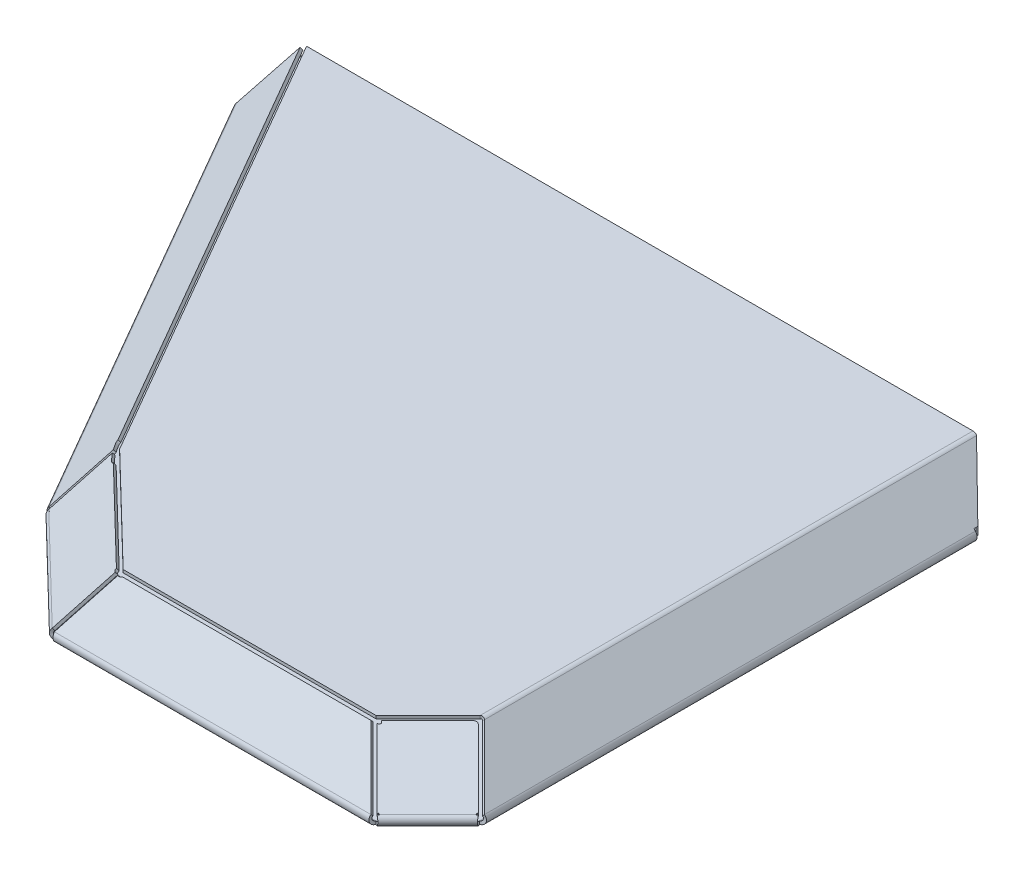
ISO-10303-21;
HEADER;
FILE_DESCRIPTION(('STEP AP214'),'2;1');
FILE_NAME('part.step','',(''),(''),'','','');
FILE_SCHEMA(('AUTOMOTIVE_DESIGN { 1 0 10303 214 1 1 1 1 }'));
ENDSEC;
DATA;
#1=APPLICATION_CONTEXT('core data for automotive mechanical design processes');
#2=APPLICATION_PROTOCOL_DEFINITION('international standard','automotive_design',2000,#1);
#3=PRODUCT_CONTEXT('',#1,'mechanical');
#4=PRODUCT('Part','Part','',(#3));
#5=PRODUCT_RELATED_PRODUCT_CATEGORY('part','',(#4));
#6=PRODUCT_DEFINITION_FORMATION('','',#4);
#7=PRODUCT_DEFINITION_CONTEXT('part definition',#1,'design');
#8=PRODUCT_DEFINITION('design','',#6,#7);
#9=PRODUCT_DEFINITION_SHAPE('','',#8);
#10=(LENGTH_UNIT() NAMED_UNIT(*) SI_UNIT(.MILLI.,.METRE.));
#11=(NAMED_UNIT(*) PLANE_ANGLE_UNIT() SI_UNIT($,.RADIAN.));
#12=(NAMED_UNIT(*) SI_UNIT($,.STERADIAN.) SOLID_ANGLE_UNIT());
#13=UNCERTAINTY_MEASURE_WITH_UNIT(LENGTH_MEASURE(1.E-05),#10,'distance_accuracy_value','');
#14=(GEOMETRIC_REPRESENTATION_CONTEXT(3) GLOBAL_UNCERTAINTY_ASSIGNED_CONTEXT((#13)) GLOBAL_UNIT_ASSIGNED_CONTEXT((#10,
#11,#12)) REPRESENTATION_CONTEXT('',''));
#15=CARTESIAN_POINT('',(0.,0.,0.));
#16=DIRECTION('',(0.,0.,1.));
#17=DIRECTION('',(1.,0.,0.));
#18=AXIS2_PLACEMENT_3D('',#15,#16,#17);
#19=CARTESIAN_POINT('',(-48.5934903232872,-9.364077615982,405.218232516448));
#20=DIRECTION('',(0.607808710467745,-0.125984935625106,0.784025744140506));
#21=DIRECTION('',(-0.645199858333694,-0.653916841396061,0.395107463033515));
#22=AXIS2_PLACEMENT_3D('',#19,#20,#21);
#23=PLANE('',#22);
#24=DIRECTION('',(-0.46291004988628,0.746003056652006,0.478741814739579));
#25=VECTOR('',#24,1.);
#26=CARTESIAN_POINT('',(-35.4959459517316,3.9104213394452,397.197558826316));
#27=LINE('',#26,#25);
#28=CARTESIAN_POINT('',(-35.0330359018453,3.16441828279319,396.718817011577));
#29=VERTEX_POINT('',#28);
#30=CARTESIAN_POINT('',(-35.4959459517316,3.9104213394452,397.197558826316));
#31=VERTEX_POINT('',#30);
#32=EDGE_CURVE('E15',#29,#31,#27,.T.);
#33=ORIENTED_EDGE('',*,*,#32,.F.);
#34=DIRECTION('',(-0.645199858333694,-0.653916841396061,0.395107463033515));
#35=VECTOR('',#34,1.);
#36=CARTESIAN_POINT('',(-48.1305802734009,-10.110080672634,404.739490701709));
#37=LINE('',#36,#35);
#38=CARTESIAN_POINT('',(-35.4458734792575,2.74600305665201,396.97163047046));
#39=VERTEX_POINT('',#38);
#40=EDGE_CURVE('E277',#39,#29,#37,.F.);
#41=ORIENTED_EDGE('',*,*,#40,.F.);
#42=CARTESIAN_POINT('',(-35.9087835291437,3.49200611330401,397.450372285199));
#43=CARTESIAN_POINT('',(-35.4458734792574,2.746003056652,396.97163047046));
#44=B_SPLINE_CURVE_WITH_KNOTS('',1,(#42,#43),.UNSPECIFIED.,.F.,.F.,(2,2),(0.,1.),.UNSPECIFIED.);
#45=CARTESIAN_POINT('',(-35.9087835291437,3.49200611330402,397.450372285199));
#46=VERTEX_POINT('',#45);
#47=EDGE_CURVE('E62',#39,#46,#44,.F.);
#48=ORIENTED_EDGE('',*,*,#47,.T.);
#49=DIRECTION('',(-0.645199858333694,-0.653916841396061,0.395107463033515));
#50=VECTOR('',#49,1.);
#51=CARTESIAN_POINT('',(-48.5934903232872,-9.364077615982,405.218232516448));
#52=LINE('',#51,#50);
#53=EDGE_CURVE('E280',#46,#31,#52,.F.);
#54=ORIENTED_EDGE('',*,*,#53,.T.);
#55=EDGE_LOOP('',(#33,#41,#48,#54));
#56=FACE_BOUND('',#55,.T.);
#57=ADVANCED_FACE('F51',(#56),#23,.F.);
#58=CARTESIAN_POINT('',(-36.0234833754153,3.492006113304,397.339465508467));
#59=CARTESIAN_POINT('',(-36.0642547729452,3.45966836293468,397.350432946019));
#60=CARTESIAN_POINT('',(-35.9430956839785,3.4572303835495,397.471384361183));
#61=CARTESIAN_POINT('',(-35.9087835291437,3.49200611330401,397.450372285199));
#62=CARTESIAN_POINT('',(-35.560573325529,2.746003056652,396.860723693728));
#63=CARTESIAN_POINT('',(-35.5887547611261,2.72983386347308,396.858669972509));
#64=CARTESIAN_POINT('',(-35.4666457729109,2.72861530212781,396.978639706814));
#65=CARTESIAN_POINT('',(-35.4458734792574,2.746003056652,396.97163047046));
#66=B_SPLINE_SURFACE_WITH_KNOTS('',1,3,((#58,#59,#60,#61),(#62,#63,#64,#65)),.UNSPECIFIED.,.F.,
.F.,.F.,(2,2),(4,4),(0.,1.),(0.,1.),.UNSPECIFIED.);
#67=CARTESIAN_POINT('',(-35.4458734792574,2.746003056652,396.97163047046));
#68=CARTESIAN_POINT('',(-35.4666457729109,2.72861530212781,396.978639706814));
#69=CARTESIAN_POINT('',(-35.5887547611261,2.72983386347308,396.858669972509));
#70=CARTESIAN_POINT('',(-35.560573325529,2.746003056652,396.860723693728));
#71=B_SPLINE_CURVE_WITH_KNOTS('',3,(#67,#68,#69,#70),.UNSPECIFIED.,.F.,.F.,(4,4),(0.,1.),.UNSPECIFIED.);
#72=CARTESIAN_POINT('',(-35.560573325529,2.746003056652,396.860723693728));
#73=VERTEX_POINT('',#72);
#74=EDGE_CURVE('E389',#39,#73,#71,.T.);
#75=CARTESIAN_POINT('',(-35.560573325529,2.746003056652,396.860723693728));
#76=CARTESIAN_POINT('',(-36.0234833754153,3.492006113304,397.339465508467));
#77=B_SPLINE_CURVE_WITH_KNOTS('',1,(#75,#76),.UNSPECIFIED.,.F.,.F.,(2,2),(0.,1.),.UNSPECIFIED.);
#78=CARTESIAN_POINT('',(-36.0234833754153,3.49200611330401,397.339465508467));
#79=VERTEX_POINT('',#78);
#80=EDGE_CURVE('E288',#73,#79,#77,.T.);
#81=CARTESIAN_POINT('',(-36.0234833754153,3.492006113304,397.339465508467));
#82=CARTESIAN_POINT('',(-36.0642547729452,3.45966836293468,397.350432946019));
#83=CARTESIAN_POINT('',(-35.9430956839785,3.4572303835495,397.471384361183));
#84=CARTESIAN_POINT('',(-35.9087835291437,3.49200611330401,397.450372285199));
#85=B_SPLINE_CURVE_WITH_KNOTS('',3,(#81,#82,#83,#84),.UNSPECIFIED.,.F.,.F.,(4,4),(0.,1.),.UNSPECIFIED.);
#86=EDGE_CURVE('E326',#46,#79,#85,.F.);
#87=ORIENTED_EDGE('',*,*,#47,.F.);
#88=ORIENTED_EDGE('',*,*,#74,.T.);
#89=ORIENTED_EDGE('',*,*,#80,.T.);
#90=ORIENTED_EDGE('',*,*,#86,.F.);
#91=EDGE_LOOP('',(#87,#88,#89,#90));
#92=FACE_BOUND('',#91,.T.);
#93=ADVANCED_FACE('F332',(#92),#66,.F.);
#94=CARTESIAN_POINT('',(22.5567670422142,0.,305.503558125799));
#95=DIRECTION('',(0.740098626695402,0.,-0.672498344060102));
#96=DIRECTION('',(-0.672498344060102,0.,-0.740098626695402));
#97=AXIS2_PLACEMENT_3D('',#94,#95,#96);
#98=PLANE('',#97);
#99=DIRECTION('',(0.,-1.,0.));
#100=VECTOR('',#99,1.);
#101=CARTESIAN_POINT('',(120.585181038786,0.,413.385897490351));
#102=LINE('',#101,#100);
#103=CARTESIAN_POINT('',(120.585181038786,1.,413.385897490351));
#104=VERTEX_POINT('',#103);
#105=CARTESIAN_POINT('',(120.585181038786,0.,413.385897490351));
#106=VERTEX_POINT('',#105);
#107=EDGE_CURVE('E2282',#104,#106,#102,.T.);
#108=ORIENTED_EDGE('',*,*,#107,.F.);
#109=DIRECTION('',(-0.672498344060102,0.,-0.740098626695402));
#110=VECTOR('',#109,1.);
#111=CARTESIAN_POINT('',(22.5567670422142,1.,305.503558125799));
#112=LINE('',#111,#110);
#113=CARTESIAN_POINT('',(120.695964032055,1.,413.507816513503));
#114=VERTEX_POINT('',#113);
#115=EDGE_CURVE('E2013',#114,#104,#112,.T.);
#116=ORIENTED_EDGE('',*,*,#115,.F.);
#117=DIRECTION('',(0.,-1.,0.));
#118=VECTOR('',#117,1.);
#119=CARTESIAN_POINT('',(120.695964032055,0.,413.507816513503));
#120=LINE('',#119,#118);
#121=CARTESIAN_POINT('',(120.695964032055,0.,413.507816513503));
#122=VERTEX_POINT('',#121);
#123=EDGE_CURVE('E2279',#114,#122,#120,.T.);
#124=ORIENTED_EDGE('',*,*,#123,.T.);
#125=DIRECTION('',(-0.672498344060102,0.,-0.740098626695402));
#126=VECTOR('',#125,1.);
#127=CARTESIAN_POINT('',(22.5567670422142,0.,305.503558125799));
#128=LINE('',#127,#126);
#129=EDGE_CURVE('E2309',#122,#106,#128,.T.);
#130=ORIENTED_EDGE('',*,*,#129,.T.);
#131=EDGE_LOOP('',(#108,#116,#124,#130));
#132=FACE_BOUND('',#131,.T.);
#133=ADVANCED_FACE('F343',(#132),#98,.T.);
#134=CARTESIAN_POINT('',(134.202444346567,0.,359.664219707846));
#135=DIRECTION('',(-0.969948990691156,0.,-0.243308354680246));
#136=DIRECTION('',(-0.243308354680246,0.,0.969948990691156));
#137=AXIS2_PLACEMENT_3D('',#134,#135,#136);
#138=PLANE('',#137);
#139=ORIENTED_EDGE('',*,*,#123,.F.);
#140=DIRECTION('',(-0.243308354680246,0.,0.969948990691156));
#141=VECTOR('',#140,1.);
#142=CARTESIAN_POINT('',(134.202444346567,1.,359.664219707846));
#143=LINE('',#142,#141);
#144=CARTESIAN_POINT('',(121.03442609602,1.,412.158537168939));
#145=VERTEX_POINT('',#144);
#146=EDGE_CURVE('E2009',#145,#114,#143,.T.);
#147=ORIENTED_EDGE('',*,*,#146,.F.);
#148=DIRECTION('',(0.,-1.,0.));
#149=VECTOR('',#148,1.);
#150=CARTESIAN_POINT('',(121.03442609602,0.,412.158537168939));
#151=LINE('',#150,#149);
#152=CARTESIAN_POINT('',(121.03442609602,0.,412.158537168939));
#153=VERTEX_POINT('',#152);
#154=EDGE_CURVE('E2276',#145,#153,#151,.T.);
#155=ORIENTED_EDGE('',*,*,#154,.T.);
#156=DIRECTION('',(-0.243308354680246,0.,0.969948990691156));
#157=VECTOR('',#156,1.);
#158=CARTESIAN_POINT('',(134.202444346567,0.,359.664219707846));
#159=LINE('',#158,#157);
#160=EDGE_CURVE('E2174',#153,#122,#159,.T.);
#161=ORIENTED_EDGE('',*,*,#160,.T.);
#162=EDGE_LOOP('',(#139,#147,#155,#161));
#163=FACE_BOUND('',#162,.T.);
#164=ADVANCED_FACE('F1032',(#163),#138,.T.);
#165=CARTESIAN_POINT('',(29.8041694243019,0.,444.814350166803));
#166=DIRECTION('',(-0.243308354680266,0.,-0.969948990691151));
#167=DIRECTION('',(-0.969948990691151,0.,0.243308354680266));
#168=AXIS2_PLACEMENT_3D('',#165,#166,#167);
#169=PLANE('',#168);
#170=DIRECTION('',(0.,-1.,0.));
#171=VECTOR('',#170,1.);
#172=CARTESIAN_POINT('',(107.991680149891,0.,425.201283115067));
#173=LINE('',#172,#171);
#174=CARTESIAN_POINT('',(107.991680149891,1.,425.201283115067));
#175=VERTEX_POINT('',#174);
#176=CARTESIAN_POINT('',(107.991680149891,0.,425.201283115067));
#177=VERTEX_POINT('',#176);
#178=EDGE_CURVE('E2273',#175,#177,#173,.T.);
#179=ORIENTED_EDGE('',*,*,#178,.F.);
#180=DIRECTION('',(-0.969948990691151,0.,0.243308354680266));
#181=VECTOR('',#180,1.);
#182=CARTESIAN_POINT('',(29.8041694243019,1.,444.814350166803));
#183=LINE('',#182,#181);
#184=CARTESIAN_POINT('',(109.340959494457,1.,424.862821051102));
#185=VERTEX_POINT('',#184);
#186=EDGE_CURVE('E2002',#185,#175,#183,.T.);
#187=ORIENTED_EDGE('',*,*,#186,.F.);
#188=DIRECTION('',(0.,-1.,0.));
#189=VECTOR('',#188,1.);
#190=CARTESIAN_POINT('',(109.340959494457,0.,424.862821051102));
#191=LINE('',#190,#189);
#192=CARTESIAN_POINT('',(109.340959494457,0.,424.862821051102));
#193=VERTEX_POINT('',#192);
#194=EDGE_CURVE('E2264',#185,#193,#191,.T.);
#195=ORIENTED_EDGE('',*,*,#194,.T.);
#196=DIRECTION('',(-0.969948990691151,0.,0.243308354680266));
#197=VECTOR('',#196,1.);
#198=CARTESIAN_POINT('',(29.8041694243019,0.,444.814350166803));
#199=LINE('',#198,#197);
#200=EDGE_CURVE('E2318',#193,#177,#199,.T.);
#201=ORIENTED_EDGE('',*,*,#200,.T.);
#202=EDGE_LOOP('',(#179,#187,#195,#201));
#203=FACE_BOUND('',#202,.T.);
#204=ADVANCED_FACE('F1039',(#203),#169,.T.);
#205=CARTESIAN_POINT('',(0.244369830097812,0.,325.731065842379));
#206=DIRECTION('',(-0.672498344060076,0.,0.740098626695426));
#207=DIRECTION('',(0.740098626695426,0.,0.672498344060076));
#208=AXIS2_PLACEMENT_3D('',#205,#206,#207);
#209=PLANE('',#208);
#210=ORIENTED_EDGE('',*,*,#194,.F.);
#211=DIRECTION('',(0.740098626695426,0.,0.672498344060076));
#212=VECTOR('',#211,1.);
#213=CARTESIAN_POINT('',(0.244369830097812,1.,325.731065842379));
#214=LINE('',#213,#212);
#215=CARTESIAN_POINT('',(109.219040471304,1.,424.752038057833));
#216=VERTEX_POINT('',#215);
#217=EDGE_CURVE('E1936',#216,#185,#214,.T.);
#218=ORIENTED_EDGE('',*,*,#217,.F.);
#219=DIRECTION('',(0.,-1.,0.));
#220=VECTOR('',#219,1.);
#221=CARTESIAN_POINT('',(109.219040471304,0.,424.752038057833));
#222=LINE('',#221,#220);
#223=CARTESIAN_POINT('',(109.219040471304,0.,424.752038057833));
#224=VERTEX_POINT('',#223);
#225=EDGE_CURVE('E2249',#216,#224,#222,.T.);
#226=ORIENTED_EDGE('',*,*,#225,.T.);
#227=DIRECTION('',(0.740098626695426,0.,0.672498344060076));
#228=VECTOR('',#227,1.);
#229=CARTESIAN_POINT('',(0.244369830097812,0.,325.731065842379));
#230=LINE('',#229,#228);
#231=EDGE_CURVE('E2321',#224,#193,#230,.T.);
#232=ORIENTED_EDGE('',*,*,#231,.T.);
#233=EDGE_LOOP('',(#210,#218,#226,#232));
#234=FACE_BOUND('',#233,.T.);
#235=ADVANCED_FACE('F1047',(#234),#209,.T.);
#236=CARTESIAN_POINT('',(121.808087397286,-2.88507986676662,432.089548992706));
#237=DIRECTION('',(-0.279904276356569,-0.313710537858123,0.907325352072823));
#238=DIRECTION('',(-0.868899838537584,0.484684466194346,-0.10046909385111));
#239=AXIS2_PLACEMENT_3D('',#236,#237,#238);
#240=PLANE('',#239);
#241=DIRECTION('',(0.408248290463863,0.816496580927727,0.40824829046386));
#242=VECTOR('',#241,1.);
#243=CARTESIAN_POINT('',(109.605545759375,3.92166829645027,430.678594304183));
#244=LINE('',#243,#242);
#245=CARTESIAN_POINT('',(109.197297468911,3.10517171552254,430.270346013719));
#246=VERTEX_POINT('',#245);
#247=CARTESIAN_POINT('',(109.605545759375,3.92166829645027,430.678594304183));
#248=VERTEX_POINT('',#247);
#249=EDGE_CURVE('E2241',#246,#248,#244,.T.);
#250=ORIENTED_EDGE('',*,*,#249,.F.);
#251=DIRECTION('',(-0.868899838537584,0.484684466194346,-0.10046909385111));
#252=VECTOR('',#251,1.);
#253=CARTESIAN_POINT('',(121.399839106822,-3.70157644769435,431.681300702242));
#254=LINE('',#253,#252);
#255=CARTESIAN_POINT('',(109.714808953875,2.81649658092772,430.330184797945));
#256=VERTEX_POINT('',#255);
#257=EDGE_CURVE('E2012',#246,#256,#254,.F.);
#258=ORIENTED_EDGE('',*,*,#257,.T.);
#259=CARTESIAN_POINT('',(110.123057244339,3.63299316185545,430.738433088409));
#260=CARTESIAN_POINT('',(109.714808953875,2.81649658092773,430.330184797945));
#261=B_SPLINE_CURVE_WITH_KNOTS('',1,(#259,#260),.UNSPECIFIED.,.F.,.F.,(2,2),(0.,1.),.UNSPECIFIED.);
#262=CARTESIAN_POINT('',(110.123057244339,3.63299316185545,430.738433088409));
#263=VERTEX_POINT('',#262);
#264=EDGE_CURVE('E2250',#256,#263,#261,.F.);
#265=ORIENTED_EDGE('',*,*,#264,.T.);
#266=DIRECTION('',(-0.868899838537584,0.484684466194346,-0.10046909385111));
#267=VECTOR('',#266,1.);
#268=CARTESIAN_POINT('',(121.808087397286,-2.88507986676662,432.089548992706));
#269=LINE('',#268,#267);
#270=EDGE_CURVE('E2170',#248,#263,#269,.F.);
#271=ORIENTED_EDGE('',*,*,#270,.F.);
#272=EDGE_LOOP('',(#250,#258,#265,#271));
#273=FACE_BOUND('',#272,.T.);
#274=ADVANCED_FACE('F1055',(#273),#240,.T.);
#275=CARTESIAN_POINT('',(109.854143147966,3.63299316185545,431.007347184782));
#276=CARTESIAN_POINT('',(109.885458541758,3.59662924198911,431.048759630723));
#277=CARTESIAN_POINT('',(109.979386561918,3.57965145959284,430.983877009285));
#278=CARTESIAN_POINT('',(110.125813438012,3.58264282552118,430.831988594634));
#279=CARTESIAN_POINT('',(110.17813556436,3.60226970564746,430.744801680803));
#280=CARTESIAN_POINT('',(110.123057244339,3.63299316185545,430.738433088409));
#281=CARTESIAN_POINT('',(109.445894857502,2.81649658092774,430.599098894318));
#282=CARTESIAN_POINT('',(109.459028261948,2.79831466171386,430.6223293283));
#283=CARTESIAN_POINT('',(109.545694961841,2.78982572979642,430.550185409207));
#284=CARTESIAN_POINT('',(109.693487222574,2.79132141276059,430.399662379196));
#285=CARTESIAN_POINT('',(109.754524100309,2.80113541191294,430.32119198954));
#286=CARTESIAN_POINT('',(109.714808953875,2.81649658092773,430.330184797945));
#287=B_SPLINE_SURFACE_WITH_KNOTS('',1,3,((#275,#276,#277,#278,#279,#280),(#281,#282,#283,#284,
#285,#286)),.UNSPECIFIED.,.F.,.F.,.F.,(2,2),(4,2,4),(0.,1.),(0.,0.5,1.),.UNSPECIFIED.);
#288=CARTESIAN_POINT('',(109.714808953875,2.81649658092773,430.330184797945));
#289=CARTESIAN_POINT('',(109.754524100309,2.80113541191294,430.32119198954));
#290=CARTESIAN_POINT('',(109.693487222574,2.79132141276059,430.399662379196));
#291=CARTESIAN_POINT('',(109.545694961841,2.78982572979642,430.550185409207));
#292=CARTESIAN_POINT('',(109.459028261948,2.79831466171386,430.6223293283));
#293=CARTESIAN_POINT('',(109.445894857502,2.81649658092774,430.599098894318));
#294=B_SPLINE_CURVE_WITH_KNOTS('',3,(#288,#289,#290,#291,#292,#293),.UNSPECIFIED.,.F.,.F.,(4,2,
4),(0.,0.5,1.),.UNSPECIFIED.);
#295=CARTESIAN_POINT('',(109.445894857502,2.81649658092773,430.599098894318));
#296=VERTEX_POINT('',#295);
#297=EDGE_CURVE('E2034',#256,#296,#294,.T.);
#298=CARTESIAN_POINT('',(109.445894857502,2.81649658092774,430.599098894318));
#299=CARTESIAN_POINT('',(109.854143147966,3.63299316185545,431.007347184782));
#300=B_SPLINE_CURVE_WITH_KNOTS('',1,(#298,#299),.UNSPECIFIED.,.F.,.F.,(2,2),(0.,1.),.UNSPECIFIED.);
#301=CARTESIAN_POINT('',(109.854143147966,3.63299316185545,431.007347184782));
#302=VERTEX_POINT('',#301);
#303=EDGE_CURVE('E2251',#296,#302,#300,.T.);
#304=CARTESIAN_POINT('',(109.854143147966,3.63299316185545,431.007347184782));
#305=CARTESIAN_POINT('',(109.885458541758,3.59662924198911,431.048759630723));
#306=CARTESIAN_POINT('',(109.979386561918,3.57965145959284,430.983877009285));
#307=CARTESIAN_POINT('',(110.125813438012,3.58264282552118,430.831988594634));
#308=CARTESIAN_POINT('',(110.17813556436,3.60226970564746,430.744801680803));
#309=CARTESIAN_POINT('',(110.123057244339,3.63299316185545,430.738433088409));
#310=B_SPLINE_CURVE_WITH_KNOTS('',3,(#304,#305,#306,#307,#308,#309),.UNSPECIFIED.,.F.,.F.,(4,2,
4),(0.,0.5,1.),.UNSPECIFIED.);
#311=EDGE_CURVE('E2141',#263,#302,#310,.F.);
#312=ORIENTED_EDGE('',*,*,#264,.F.);
#313=ORIENTED_EDGE('',*,*,#297,.T.);
#314=ORIENTED_EDGE('',*,*,#303,.T.);
#315=ORIENTED_EDGE('',*,*,#311,.F.);
#316=EDGE_LOOP('',(#312,#313,#314,#315));
#317=FACE_BOUND('',#316,.T.);
#318=ADVANCED_FACE('F1063',(#317),#287,.F.);
#319=CARTESIAN_POINT('',(135.971003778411,-4.3844339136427,420.925340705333));
#320=DIRECTION('',(-0.637576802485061,-0.0650302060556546,0.767637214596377));
#321=DIRECTION('',(-0.65332163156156,0.573676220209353,-0.494030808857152));
#322=AXIS2_PLACEMENT_3D('',#319,#320,#321);
#323=PLANE('',#322);
#324=DIRECTION('',(0.408248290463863,0.816496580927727,0.40824829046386));
#325=VECTOR('',#324,1.);
#326=CARTESIAN_POINT('',(126.511737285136,3.92166829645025,413.772402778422));
#327=LINE('',#326,#325);
#328=CARTESIAN_POINT('',(126.103488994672,3.10517171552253,413.364154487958));
#329=VERTEX_POINT('',#328);
#330=CARTESIAN_POINT('',(126.511737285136,3.92166829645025,413.772402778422));
#331=VERTEX_POINT('',#330);
#332=EDGE_CURVE('E2470',#329,#331,#327,.T.);
#333=ORIENTED_EDGE('',*,*,#332,.F.);
#334=DIRECTION('',(-0.65332163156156,0.573676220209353,-0.494030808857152));
#335=VECTOR('',#334,1.);
#336=CARTESIAN_POINT('',(135.562755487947,-5.20093049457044,420.517092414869));
#337=LINE('',#336,#335);
#338=CARTESIAN_POINT('',(126.432241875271,2.81649658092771,413.612751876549));
#339=VERTEX_POINT('',#338);
#340=EDGE_CURVE('E306',#329,#339,#337,.F.);
#341=ORIENTED_EDGE('',*,*,#340,.T.);
#342=CARTESIAN_POINT('',(126.840490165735,3.63299316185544,414.021000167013));
#343=CARTESIAN_POINT('',(126.432241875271,2.81649658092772,413.612751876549));
#344=B_SPLINE_CURVE_WITH_KNOTS('',1,(#342,#343),.UNSPECIFIED.,.F.,.F.,(2,2),(0.,1.),.UNSPECIFIED.);
#345=CARTESIAN_POINT('',(126.840490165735,3.63299316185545,414.021000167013));
#346=VERTEX_POINT('',#345);
#347=EDGE_CURVE('E2478',#339,#346,#344,.F.);
#348=ORIENTED_EDGE('',*,*,#347,.T.);
#349=DIRECTION('',(-0.65332163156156,0.573676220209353,-0.494030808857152));
#350=VECTOR('',#349,1.);
#351=CARTESIAN_POINT('',(135.971003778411,-4.3844339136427,420.925340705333));
#352=LINE('',#351,#350);
#353=EDGE_CURVE('E2310',#331,#346,#352,.F.);
#354=ORIENTED_EDGE('',*,*,#353,.F.);
#355=EDGE_LOOP('',(#333,#341,#348,#354));
#356=FACE_BOUND('',#355,.T.);
#357=ADVANCED_FACE('F1071',(#356),#323,.T.);
#358=CARTESIAN_POINT('',(126.571576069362,3.63299316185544,414.289914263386));
#359=CARTESIAN_POINT('',(126.577944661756,3.60226970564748,414.344992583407));
#360=CARTESIAN_POINT('',(126.665131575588,3.58264282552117,414.292670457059));
#361=CARTESIAN_POINT('',(126.817019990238,3.57965145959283,414.146243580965));
#362=CARTESIAN_POINT('',(126.881902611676,3.5966292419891,414.052315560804));
#363=CARTESIAN_POINT('',(126.840490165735,3.63299316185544,414.021000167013));
#364=CARTESIAN_POINT('',(126.163327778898,2.81649658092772,413.881665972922));
#365=CARTESIAN_POINT('',(126.154334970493,2.80113541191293,413.921381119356));
#366=CARTESIAN_POINT('',(126.232805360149,2.79132141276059,413.860344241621));
#367=CARTESIAN_POINT('',(126.38332839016,2.78982572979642,413.712551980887));
#368=CARTESIAN_POINT('',(126.455472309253,2.79831466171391,413.625885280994));
#369=CARTESIAN_POINT('',(126.432241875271,2.81649658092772,413.612751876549));
#370=B_SPLINE_SURFACE_WITH_KNOTS('',1,3,((#358,#359,#360,#361,#362,#363),(#364,#365,#366,#367,
#368,#369)),.UNSPECIFIED.,.F.,.F.,.F.,(2,2),(4,2,4),(0.,1.),(0.,0.5,1.),.UNSPECIFIED.);
#371=CARTESIAN_POINT('',(126.432241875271,2.81649658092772,413.612751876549));
#372=CARTESIAN_POINT('',(126.455472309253,2.79831466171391,413.625885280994));
#373=CARTESIAN_POINT('',(126.38332839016,2.78982572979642,413.712551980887));
#374=CARTESIAN_POINT('',(126.232805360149,2.79132141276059,413.860344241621));
#375=CARTESIAN_POINT('',(126.154334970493,2.80113541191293,413.921381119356));
#376=CARTESIAN_POINT('',(126.163327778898,2.81649658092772,413.881665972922));
#377=B_SPLINE_CURVE_WITH_KNOTS('',3,(#371,#372,#373,#374,#375,#376),.UNSPECIFIED.,.F.,.F.,(4,2,
4),(0.,0.5,1.),.UNSPECIFIED.);
#378=CARTESIAN_POINT('',(126.163327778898,2.81649658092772,413.881665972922));
#379=VERTEX_POINT('',#378);
#380=EDGE_CURVE('E1929',#339,#379,#377,.T.);
#381=CARTESIAN_POINT('',(126.163327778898,2.81649658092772,413.881665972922));
#382=CARTESIAN_POINT('',(126.571576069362,3.63299316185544,414.289914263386));
#383=B_SPLINE_CURVE_WITH_KNOTS('',1,(#381,#382),.UNSPECIFIED.,.F.,.F.,(2,2),(0.,1.),.UNSPECIFIED.);
#384=CARTESIAN_POINT('',(126.571576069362,3.63299316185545,414.289914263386));
#385=VERTEX_POINT('',#384);
#386=EDGE_CURVE('E2479',#379,#385,#383,.T.);
#387=CARTESIAN_POINT('',(126.571576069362,3.63299316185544,414.289914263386));
#388=CARTESIAN_POINT('',(126.577944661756,3.60226970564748,414.344992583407));
#389=CARTESIAN_POINT('',(126.665131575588,3.58264282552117,414.292670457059));
#390=CARTESIAN_POINT('',(126.817019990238,3.57965145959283,414.146243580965));
#391=CARTESIAN_POINT('',(126.881902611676,3.5966292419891,414.052315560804));
#392=CARTESIAN_POINT('',(126.840490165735,3.63299316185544,414.021000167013));
#393=B_SPLINE_CURVE_WITH_KNOTS('',3,(#387,#388,#389,#390,#391,#392),.UNSPECIFIED.,.F.,.F.,(4,2,
4),(0.,0.5,1.),.UNSPECIFIED.);
#394=EDGE_CURVE('E2136',#346,#385,#393,.F.);
#395=ORIENTED_EDGE('',*,*,#347,.F.);
#396=ORIENTED_EDGE('',*,*,#380,.T.);
#397=ORIENTED_EDGE('',*,*,#386,.T.);
#398=ORIENTED_EDGE('',*,*,#394,.F.);
#399=EDGE_LOOP('',(#395,#396,#397,#398));
#400=FACE_BOUND('',#399,.T.);
#401=ADVANCED_FACE('F1078',(#400),#370,.F.);
#402=CARTESIAN_POINT('',(94.6397028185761,17.1928764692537,418.139876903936));
#403=DIRECTION('',(-0.816496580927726,-0.408248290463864,0.408248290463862));
#404=DIRECTION('',(0.577350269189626,-0.577350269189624,0.577350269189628));
#405=AXIS2_PLACEMENT_3D('',#402,#403,#404);
#406=PLANE('',#405);
#407=DIRECTION('',(0.,0.707106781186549,0.707106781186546));
#408=VECTOR('',#407,1.);
#409=CARTESIAN_POINT('',(108.418365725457,3.4142135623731,431.918539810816));
#410=LINE('',#409,#408);
#411=CARTESIAN_POINT('',(108.418365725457,2.70710678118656,431.21143302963));
#412=VERTEX_POINT('',#411);
#413=CARTESIAN_POINT('',(108.418365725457,3.4142135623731,431.918539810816));
#414=VERTEX_POINT('',#413);
#415=EDGE_CURVE('E2547',#412,#414,#410,.T.);
#416=ORIENTED_EDGE('',*,*,#415,.F.);
#417=DIRECTION('',(0.577350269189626,-0.577350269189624,0.577350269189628));
#418=VECTOR('',#417,1.);
#419=CARTESIAN_POINT('',(94.6397028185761,16.4857696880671,417.432770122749));
#420=LINE('',#419,#418);
#421=CARTESIAN_POINT('',(94.5081559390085,16.6173165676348,417.301223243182));
#422=VERTEX_POINT('',#421);
#423=EDGE_CURVE('E1881',#412,#422,#420,.F.);
#424=ORIENTED_EDGE('',*,*,#423,.T.);
#425=DIRECTION('',(0.,0.707106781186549,0.707106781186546));
#426=VECTOR('',#425,1.);
#427=CARTESIAN_POINT('',(94.5081559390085,17.3244233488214,418.008330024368));
#428=LINE('',#427,#426);
#429=CARTESIAN_POINT('',(94.5081559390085,17.3244233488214,418.008330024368));
#430=VERTEX_POINT('',#429);
#431=EDGE_CURVE('E2560',#422,#430,#428,.T.);
#432=ORIENTED_EDGE('',*,*,#431,.T.);
#433=DIRECTION('',(0.577350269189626,-0.577350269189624,0.577350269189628));
#434=VECTOR('',#433,1.);
#435=CARTESIAN_POINT('',(94.6397028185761,17.1928764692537,418.139876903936));
#436=LINE('',#435,#434);
#437=EDGE_CURVE('E438',#414,#430,#436,.F.);
#438=ORIENTED_EDGE('',*,*,#437,.F.);
#439=EDGE_LOOP('',(#416,#424,#432,#438));
#440=FACE_BOUND('',#439,.T.);
#441=ADVANCED_FACE('F1086',(#440),#406,.F.);
#442=CARTESIAN_POINT('',(-1.96604563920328,17.3244233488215,418.008330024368));
#443=DIRECTION('',(0.,-0.707106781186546,0.707106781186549));
#444=DIRECTION('',(1.,0.,0.));
#445=AXIS2_PLACEMENT_3D('',#442,#443,#444);
#446=PLANE('',#445);
#447=ORIENTED_EDGE('',*,*,#431,.F.);
#448=DIRECTION('',(-1.,0.,0.));
#449=VECTOR('',#448,1.);
#450=CARTESIAN_POINT('',(131.165896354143,16.6173165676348,417.301223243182));
#451=LINE('',#450,#449);
#452=CARTESIAN_POINT('',(9.6236959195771,16.6173165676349,417.301223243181));
#453=VERTEX_POINT('',#452);
#454=EDGE_CURVE('E1885',#422,#453,#451,.T.);
#455=ORIENTED_EDGE('',*,*,#454,.T.);
#456=DIRECTION('',(0.,0.707106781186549,0.707106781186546));
#457=VECTOR('',#456,1.);
#458=CARTESIAN_POINT('',(9.6236959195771,17.3244233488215,418.008330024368));
#459=LINE('',#458,#457);
#460=CARTESIAN_POINT('',(9.6236959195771,17.3244233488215,418.008330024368));
#461=VERTEX_POINT('',#460);
#462=EDGE_CURVE('E2562',#453,#461,#459,.T.);
#463=ORIENTED_EDGE('',*,*,#462,.T.);
#464=DIRECTION('',(1.,0.,0.));
#465=VECTOR('',#464,1.);
#466=CARTESIAN_POINT('',(-1.96604563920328,17.3244233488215,418.008330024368));
#467=LINE('',#466,#465);
#468=EDGE_CURVE('E480',#430,#461,#467,.F.);
#469=ORIENTED_EDGE('',*,*,#468,.F.);
#470=EDGE_LOOP('',(#447,#455,#463,#469));
#471=FACE_BOUND('',#470,.T.);
#472=ADVANCED_FACE('F1094',(#471),#446,.F.);
#473=CARTESIAN_POINT('',(8.0339543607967,18.,417.332753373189));
#474=DIRECTION('',(0.,0.707106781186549,0.707106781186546));
#475=DIRECTION('',(0.825494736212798,-0.399098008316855,0.399098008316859));
#476=AXIS2_PLACEMENT_3D('',#473,#474,#475);
#477=ELLIPSE('',#476,1.86469707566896,0.916543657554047);
#478=DIRECTION('',(0.,0.707106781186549,0.707106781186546));
#479=VECTOR('',#478,1.);
#480=SURFACE_OF_LINEAR_EXTRUSION('',#477,#479);
#481=ORIENTED_EDGE('',*,*,#462,.F.);
#482=CARTESIAN_POINT('',(8.0339543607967,17.2928932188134,416.625646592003));
#483=DIRECTION('',(0.,0.707106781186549,0.707106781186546));
#484=DIRECTION('',(0.825494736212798,-0.399098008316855,0.399098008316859));
#485=AXIS2_PLACEMENT_3D('',#482,#483,#484);
#486=ELLIPSE('',#485,1.86469707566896,0.916543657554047);
#487=CARTESIAN_POINT('',(8.39491410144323,16.4483945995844,417.470145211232));
#488=VERTEX_POINT('',#487);
#489=EDGE_CURVE('E1908',#453,#488,#486,.F.);
#490=ORIENTED_EDGE('',*,*,#489,.T.);
#491=DIRECTION('',(0.,0.707106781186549,0.707106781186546));
#492=VECTOR('',#491,1.);
#493=CARTESIAN_POINT('',(8.39491410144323,17.155501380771,418.177251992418));
#494=LINE('',#493,#492);
#495=CARTESIAN_POINT('',(8.39491410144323,17.155501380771,418.177251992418));
#496=VERTEX_POINT('',#495);
#497=EDGE_CURVE('E2540',#488,#496,#494,.T.);
#498=ORIENTED_EDGE('',*,*,#497,.T.);
#499=EDGE_CURVE('E756',#461,#496,#477,.F.);
#500=ORIENTED_EDGE('',*,*,#499,.F.);
#501=EDGE_LOOP('',(#481,#490,#498,#500));
#502=FACE_BOUND('',#501,.T.);
#503=ADVANCED_FACE('F1102',(#502),#480,.F.);
#504=CARTESIAN_POINT('',(-1.63103798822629,-0.209957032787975,435.542710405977));
#505=DIRECTION('',(0.925820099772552,-0.267261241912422,0.267261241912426));
#506=DIRECTION('',(0.377964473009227,0.654653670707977,-0.654653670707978));
#507=AXIS2_PLACEMENT_3D('',#504,#505,#506);
#508=PLANE('',#507);
#509=ORIENTED_EDGE('',*,*,#497,.F.);
#510=DIRECTION('',(0.377964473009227,0.654653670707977,-0.654653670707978));
#511=VECTOR('',#510,1.);
#512=CARTESIAN_POINT('',(-1.63103798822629,-0.917063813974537,434.835603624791));
#513=LINE('',#512,#511);
#514=CARTESIAN_POINT('',(0.461377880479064,2.70710678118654,431.21143302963));
#515=VERTEX_POINT('',#514);
#516=EDGE_CURVE('E1882',#488,#515,#513,.F.);
#517=ORIENTED_EDGE('',*,*,#516,.T.);
#518=DIRECTION('',(0.,0.707106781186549,0.707106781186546));
#519=VECTOR('',#518,1.);
#520=CARTESIAN_POINT('',(0.461377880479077,3.41421356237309,431.918539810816));
#521=LINE('',#520,#519);
#522=CARTESIAN_POINT('',(0.461377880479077,3.41421356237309,431.918539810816));
#523=VERTEX_POINT('',#522);
#524=EDGE_CURVE('E2538',#515,#523,#521,.T.);
#525=ORIENTED_EDGE('',*,*,#524,.T.);
#526=DIRECTION('',(0.377964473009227,0.654653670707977,-0.654653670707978));
#527=VECTOR('',#526,1.);
#528=CARTESIAN_POINT('',(-1.63103798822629,-0.209957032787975,435.542710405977));
#529=LINE('',#528,#527);
#530=EDGE_CURVE('E432',#496,#523,#529,.F.);
#531=ORIENTED_EDGE('',*,*,#530,.F.);
#532=EDGE_LOOP('',(#509,#517,#525,#531));
#533=FACE_BOUND('',#532,.T.);
#534=ADVANCED_FACE('F1110',(#533),#508,.F.);
#535=CARTESIAN_POINT('',(0.573089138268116,2.,432.504326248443));
#536=CARTESIAN_POINT('',(0.573089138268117,2.,432.17099291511));
#537=CARTESIAN_POINT('',(0.573089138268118,2.,431.837659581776));
#538=CARTESIAN_POINT('',(0.573089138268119,2.,431.504326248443));
#539=CARTESIAN_POINT('',(0.573089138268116,6.,432.504326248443));
#540=CARTESIAN_POINT('',(0.573089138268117,5.33333333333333,432.17099291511));
#541=CARTESIAN_POINT('',(0.573089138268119,4.66666666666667,431.837659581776));
#542=CARTESIAN_POINT('',(0.573089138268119,4.,431.504326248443));
#543=CARTESIAN_POINT('',(-0.189723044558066,6.,428.504326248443));
#544=CARTESIAN_POINT('',(-0.189723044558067,5.33333333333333,428.837659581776));
#545=CARTESIAN_POINT('',(-0.189723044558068,4.66666666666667,429.17099291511));
#546=CARTESIAN_POINT('',(-0.18972304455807,4.,429.504326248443));
#547=CARTESIAN_POINT('',(-0.189723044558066,2.,428.504326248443));
#548=CARTESIAN_POINT('',(-0.189723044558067,2.,428.837659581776));
#549=CARTESIAN_POINT('',(-0.189723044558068,2.,429.17099291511));
#550=CARTESIAN_POINT('',(-0.189723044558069,2.,429.504326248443));
#551=CARTESIAN_POINT('',(-0.189723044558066,-2.,428.504326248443));
#552=CARTESIAN_POINT('',(-0.189723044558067,-1.33333333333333,428.837659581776));
#553=CARTESIAN_POINT('',(-0.189723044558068,-0.666666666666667,429.17099291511));
#554=CARTESIAN_POINT('',(-0.189723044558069,0.,429.504326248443));
#555=CARTESIAN_POINT('',(0.573089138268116,-2.,432.504326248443));
#556=CARTESIAN_POINT('',(0.573089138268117,-1.33333333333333,432.17099291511));
#557=CARTESIAN_POINT('',(0.573089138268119,-0.666666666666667,431.837659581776));
#558=CARTESIAN_POINT('',(0.573089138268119,0.,431.504326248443));
#559=CARTESIAN_POINT('',(0.573089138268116,2.,432.504326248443));
#560=CARTESIAN_POINT('',(0.573089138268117,2.,432.17099291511));
#561=CARTESIAN_POINT('',(0.573089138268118,2.,431.837659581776));
#562=CARTESIAN_POINT('',(0.573089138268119,2.,431.504326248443));
#563=(BOUNDED_SURFACE() B_SPLINE_SURFACE(3,3,((#535,#536,#537,#538),(#539,#540,#541,#542),(#543,
#544,#545,#546),(#547,#548,#549,#550),(#551,#552,#553,#554),(#555,#556,#557,#558),(#559,#560,
#561,#562)),.UNSPECIFIED.,.T.,.F.,.F.) B_SPLINE_SURFACE_WITH_KNOTS((4,3,4),(4,4),(0.,0.5,1.),
(0.,1.),.UNSPECIFIED.) GEOMETRIC_REPRESENTATION_ITEM() RATIONAL_B_SPLINE_SURFACE(((1.,1.,1.,1.),
(0.333333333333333,0.333333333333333,0.333333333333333,0.333333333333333),(0.333333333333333,
0.333333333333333,0.333333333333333,0.333333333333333),(1.,1.,1.,1.),(0.333333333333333,
0.333333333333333,0.333333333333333,0.333333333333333),(0.333333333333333,0.333333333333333,
0.333333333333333,0.333333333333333),(1.,1.,1.,1.))) REPRESENTATION_ITEM('') SURFACE());
#564=CARTESIAN_POINT('',(0.191683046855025,2.,430.504326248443));
#565=DIRECTION('',(0.934346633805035,0.,-0.35636549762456));
#566=DIRECTION('',(0.35636549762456,0.,0.934346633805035));
#567=AXIS2_PLACEMENT_3D('',#564,#565,#566);
#568=ELLIPSE('',#567,1.0702666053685,1.);
#569=CARTESIAN_POINT('',(0.191683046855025,1.,430.504326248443));
#570=VERTEX_POINT('',#569);
#571=EDGE_CURVE('E1857',#570,#515,#568,.F.);
#572=DIRECTION('',(0.,-1.,0.));
#573=VECTOR('',#572,1.);
#574=CARTESIAN_POINT('',(0.191683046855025,0.,430.504326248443));
#575=LINE('',#574,#573);
#576=CARTESIAN_POINT('',(0.191683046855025,0.,430.504326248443));
#577=VERTEX_POINT('',#576);
#578=EDGE_CURVE('E2537',#570,#577,#575,.T.);
#579=CARTESIAN_POINT('',(0.191683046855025,2.,430.504326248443));
#580=DIRECTION('',(0.982297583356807,0.,-0.187327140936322));
#581=DIRECTION('',(0.187327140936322,0.,0.982297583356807));
#582=AXIS2_PLACEMENT_3D('',#579,#580,#581);
#583=ELLIPSE('',#582,2.03604287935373,2.);
#584=EDGE_CURVE('E2339',#577,#523,#583,.F.);
#585=ORIENTED_EDGE('',*,*,#524,.F.);
#586=ORIENTED_EDGE('',*,*,#571,.F.);
#587=ORIENTED_EDGE('',*,*,#578,.T.);
#588=ORIENTED_EDGE('',*,*,#584,.T.);
#589=EDGE_LOOP('',(#585,#586,#587,#588));
#590=FACE_BOUND('',#589,.T.);
#591=ADVANCED_FACE('F1118',(#590),#563,.T.);
#592=CARTESIAN_POINT('',(1.85611370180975,2.,429.331662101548));
#593=CARTESIAN_POINT('',(1.62440699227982,2.,429.571293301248));
#594=CARTESIAN_POINT('',(1.3927002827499,2.,429.810924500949));
#595=CARTESIAN_POINT('',(1.16099357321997,2.,430.050555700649));
#596=CARTESIAN_POINT('',(1.85611370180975,6.,429.331662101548));
#597=CARTESIAN_POINT('',(1.62440699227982,5.33333333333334,429.571293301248));
#598=CARTESIAN_POINT('',(1.3927002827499,4.66666666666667,429.810924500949));
#599=CARTESIAN_POINT('',(1.16099357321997,4.,430.050555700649));
#600=CARTESIAN_POINT('',(-1.47274760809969,6.,431.676990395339));
#601=CARTESIAN_POINT('',(-1.24104089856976,5.33333333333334,431.437359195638));
#602=CARTESIAN_POINT('',(-1.00933418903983,4.66666666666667,431.197727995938));
#603=CARTESIAN_POINT('',(-0.777627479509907,4.,430.958096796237));
#604=CARTESIAN_POINT('',(-1.47274760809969,2.,431.676990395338));
#605=CARTESIAN_POINT('',(-1.24104089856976,2.,431.437359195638));
#606=CARTESIAN_POINT('',(-1.00933418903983,2.,431.197727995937));
#607=CARTESIAN_POINT('',(-0.777627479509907,2.,430.958096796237));
#608=CARTESIAN_POINT('',(-1.47274760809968,-2.,431.676990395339));
#609=CARTESIAN_POINT('',(-1.24104089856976,-1.33333333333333,431.437359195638));
#610=CARTESIAN_POINT('',(-1.00933418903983,-0.666666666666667,431.197727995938));
#611=CARTESIAN_POINT('',(-0.777627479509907,0.,430.958096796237));
#612=CARTESIAN_POINT('',(1.85611370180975,-2.,429.331662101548));
#613=CARTESIAN_POINT('',(1.62440699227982,-1.33333333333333,429.571293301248));
#614=CARTESIAN_POINT('',(1.3927002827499,-0.666666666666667,429.810924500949));
#615=CARTESIAN_POINT('',(1.16099357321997,0.,430.050555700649));
#616=CARTESIAN_POINT('',(1.85611370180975,2.,429.331662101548));
#617=CARTESIAN_POINT('',(1.62440699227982,2.,429.571293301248));
#618=CARTESIAN_POINT('',(1.3927002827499,2.,429.810924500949));
#619=CARTESIAN_POINT('',(1.16099357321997,2.,430.050555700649));
#620=(BOUNDED_SURFACE() B_SPLINE_SURFACE(3,3,((#592,#593,#594,#595),(#596,#597,#598,#599),(#600,
#601,#602,#603),(#604,#605,#606,#607),(#608,#609,#610,#611),(#612,#613,#614,#615),(#616,#617,
#618,#619)),.UNSPECIFIED.,.T.,.F.,.F.) B_SPLINE_SURFACE_WITH_KNOTS((4,3,4),(4,4),(0.,0.5,1.),
(0.,1.),.UNSPECIFIED.) GEOMETRIC_REPRESENTATION_ITEM() RATIONAL_B_SPLINE_SURFACE(((1.,1.,1.,1.),
(0.333333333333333,0.333333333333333,0.333333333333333,0.333333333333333),(0.333333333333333,
0.333333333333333,0.333333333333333,0.333333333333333),(1.,1.,1.,1.),(0.333333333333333,
0.333333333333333,0.333333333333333,0.333333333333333),(0.333333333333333,0.333333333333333,
0.333333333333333,0.333333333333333),(1.,1.,1.,1.))) REPRESENTATION_ITEM('') SURFACE());
#621=CARTESIAN_POINT('',(0.191683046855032,2.,430.504326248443));
#622=DIRECTION('',(-0.423978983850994,0.,-0.905672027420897));
#623=DIRECTION('',(0.905672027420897,0.,-0.423978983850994));
#624=AXIS2_PLACEMENT_3D('',#621,#622,#623);
#625=ELLIPSE('',#624,1.07026660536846,1.);
#626=CARTESIAN_POINT('',(-0.453822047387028,2.746003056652,430.80651135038));
#627=VERTEX_POINT('',#626);
#628=EDGE_CURVE('E1975',#627,#570,#625,.F.);
#629=DIRECTION('',(-0.46291004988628,0.746003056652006,0.478741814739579));
#630=VECTOR('',#629,1.);
#631=CARTESIAN_POINT('',(-0.916732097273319,3.49200611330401,431.285253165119));
#632=LINE('',#631,#630);
#633=CARTESIAN_POINT('',(-0.916732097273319,3.49200611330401,431.285253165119));
#634=VERTEX_POINT('',#633);
#635=EDGE_CURVE('E2568',#627,#634,#632,.T.);
#636=CARTESIAN_POINT('',(0.191683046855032,2.,430.504326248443));
#637=DIRECTION('',(-0.575952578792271,0.,-0.817483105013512));
#638=DIRECTION('',(0.817483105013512,0.,-0.575952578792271));
#639=AXIS2_PLACEMENT_3D('',#636,#637,#638);
#640=ELLIPSE('',#639,2.03604287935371,2.);
#641=EDGE_CURVE('E2731',#634,#577,#640,.F.);
#642=ORIENTED_EDGE('',*,*,#578,.F.);
#643=ORIENTED_EDGE('',*,*,#628,.F.);
#644=ORIENTED_EDGE('',*,*,#635,.T.);
#645=ORIENTED_EDGE('',*,*,#641,.T.);
#646=EDGE_LOOP('',(#642,#643,#644,#645));
#647=FACE_BOUND('',#646,.T.);
#648=ADVANCED_FACE('F1126',(#647),#620,.T.);
#649=CARTESIAN_POINT('',(7.40408326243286,17.9040810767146,416.873178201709));
#650=DIRECTION('',(0.801783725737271,0.122098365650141,0.585008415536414));
#651=DIRECTION('',(-0.377964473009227,-0.654653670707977,0.654653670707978));
#652=AXIS2_PLACEMENT_3D('',#649,#650,#651);
#653=PLANE('',#652);
#654=ORIENTED_EDGE('',*,*,#635,.F.);
#655=DIRECTION('',(-0.377964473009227,-0.654653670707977,0.654653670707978));
#656=VECTOR('',#655,1.);
#657=CARTESIAN_POINT('',(-4.83986178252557,-4.85084060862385,438.403355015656));
#658=LINE('',#657,#656);
#659=CARTESIAN_POINT('',(7.40645871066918,16.3604086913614,417.19210571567));
#660=VERTEX_POINT('',#659);
#661=EDGE_CURVE('E1969',#627,#660,#658,.F.);
#662=ORIENTED_EDGE('',*,*,#661,.T.);
#663=DIRECTION('',(-0.46291004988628,0.746003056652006,0.478741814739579));
#664=VECTOR('',#663,1.);
#665=CARTESIAN_POINT('',(6.9435486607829,17.1064117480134,417.67084753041));
#666=LINE('',#665,#664);
#667=CARTESIAN_POINT('',(6.9435486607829,17.1064117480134,417.67084753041));
#668=VERTEX_POINT('',#667);
#669=EDGE_CURVE('E2570',#660,#668,#666,.T.);
#670=ORIENTED_EDGE('',*,*,#669,.T.);
#671=DIRECTION('',(-0.377964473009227,-0.654653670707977,0.654653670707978));
#672=VECTOR('',#671,1.);
#673=CARTESIAN_POINT('',(7.40408326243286,17.9040810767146,416.873178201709));
#674=LINE('',#673,#672);
#675=EDGE_CURVE('E429',#634,#668,#674,.F.);
#676=ORIENTED_EDGE('',*,*,#675,.F.);
#677=EDGE_LOOP('',(#654,#662,#670,#676));
#678=FACE_BOUND('',#677,.T.);
#679=ADVANCED_FACE('F472',(#678),#653,.T.);
#680=CARTESIAN_POINT('',(8.03395436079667,18.,417.332753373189));
#681=DIRECTION('',(0.46291004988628,-0.746003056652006,-0.478741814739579));
#682=DIRECTION('',(0.886405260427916,0.389587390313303,0.250014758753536));
#683=AXIS2_PLACEMENT_3D('',#680,#681,#682);
#684=ELLIPSE('',#683,2.06392076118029,0.955409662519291);
#685=DIRECTION('',(0.46291004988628,-0.746003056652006,-0.478741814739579));
#686=VECTOR('',#685,1.);
#687=SURFACE_OF_LINEAR_EXTRUSION('',#684,#686);
#688=ORIENTED_EDGE('',*,*,#669,.F.);
#689=CARTESIAN_POINT('',(8.49686441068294,17.253996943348,416.85401155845));
#690=DIRECTION('',(0.46291004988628,-0.746003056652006,-0.478741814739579));
#691=DIRECTION('',(0.886405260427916,0.389587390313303,0.250014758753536));
#692=AXIS2_PLACEMENT_3D('',#689,#690,#691);
#693=ELLIPSE('',#692,2.06392076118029,0.955409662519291);
#694=CARTESIAN_POINT('',(6.7530663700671,16.6436315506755,416.118986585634));
#695=VERTEX_POINT('',#694);
#696=EDGE_CURVE('E1907',#695,#660,#693,.F.);
#697=ORIENTED_EDGE('',*,*,#696,.F.);
#698=DIRECTION('',(-0.46291004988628,0.746003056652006,0.478741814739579));
#699=VECTOR('',#698,1.);
#700=CARTESIAN_POINT('',(6.29015632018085,17.3896346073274,416.597728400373));
#701=LINE('',#700,#699);
#702=CARTESIAN_POINT('',(6.29015632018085,17.3896346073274,416.597728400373));
#703=VERTEX_POINT('',#702);
#704=EDGE_CURVE('E2573',#695,#703,#701,.T.);
#705=ORIENTED_EDGE('',*,*,#704,.T.);
#706=EDGE_CURVE('E475',#703,#668,#684,.F.);
#707=ORIENTED_EDGE('',*,*,#706,.T.);
#708=EDGE_LOOP('',(#688,#697,#705,#707));
#709=FACE_BOUND('',#708,.T.);
#710=ADVANCED_FACE('F467',(#709),#687,.F.);
#711=CARTESIAN_POINT('',(-36.3074123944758,17.3896346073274,375.408841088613));
#712=DIRECTION('',(0.518561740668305,0.665942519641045,-0.536296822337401));
#713=DIRECTION('',(0.718893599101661,0.,0.695120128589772));
#714=AXIS2_PLACEMENT_3D('',#711,#712,#713);
#715=PLANE('',#714);
#716=ORIENTED_EDGE('',*,*,#704,.F.);
#717=DIRECTION('',(0.718893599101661,0.,0.695120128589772));
#718=VECTOR('',#717,1.);
#719=CARTESIAN_POINT('',(-35.8445023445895,16.6436315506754,374.930099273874));
#720=LINE('',#719,#718);
#721=CARTESIAN_POINT('',(-25.0158692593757,16.6436315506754,385.400634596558));
#722=VERTEX_POINT('',#721);
#723=EDGE_CURVE('E1965',#722,#695,#720,.T.);
#724=ORIENTED_EDGE('',*,*,#723,.F.);
#725=DIRECTION('',(-0.46291004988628,0.746003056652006,0.478741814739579));
#726=VECTOR('',#725,1.);
#727=CARTESIAN_POINT('',(-25.478779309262,17.3896346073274,385.879376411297));
#728=LINE('',#727,#726);
#729=CARTESIAN_POINT('',(-25.478779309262,17.3896346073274,385.879376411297));
#730=VERTEX_POINT('',#729);
#731=EDGE_CURVE('E2576',#722,#730,#728,.T.);
#732=ORIENTED_EDGE('',*,*,#731,.T.);
#733=DIRECTION('',(0.718893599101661,0.,0.695120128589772));
#734=VECTOR('',#733,1.);
#735=CARTESIAN_POINT('',(-36.3074123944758,17.3896346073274,375.408841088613));
#736=LINE('',#735,#734);
#737=EDGE_CURVE('E755',#730,#703,#736,.T.);
#738=ORIENTED_EDGE('',*,*,#737,.T.);
#739=EDGE_LOOP('',(#716,#724,#732,#738));
#740=FACE_BOUND('',#739,.T.);
#741=ADVANCED_FACE('F462',(#740),#715,.T.);
#742=CARTESIAN_POINT('',(-28.6431919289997,18.,381.868502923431));
#743=DIRECTION('',(0.46291004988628,-0.746003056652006,-0.478741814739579));
#744=DIRECTION('',(0.594842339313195,-0.138979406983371,0.791736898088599));
#745=AXIS2_PLACEMENT_3D('',#742,#743,#744);
#746=ELLIPSE('',#745,5.21661180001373,0.955409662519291);
#747=DIRECTION('',(0.46291004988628,-0.746003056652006,-0.478741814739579));
#748=VECTOR('',#747,1.);
#749=SURFACE_OF_LINEAR_EXTRUSION('',#746,#748);
#750=ORIENTED_EDGE('',*,*,#731,.F.);
#751=CARTESIAN_POINT('',(-28.1802818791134,17.253996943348,381.389761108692));
#752=DIRECTION('',(0.46291004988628,-0.746003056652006,-0.478741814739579));
#753=DIRECTION('',(0.594842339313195,-0.138979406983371,0.791736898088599));
#754=AXIS2_PLACEMENT_3D('',#751,#752,#753);
#755=ELLIPSE('',#754,5.21661180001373,0.955409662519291);
#756=CARTESIAN_POINT('',(-28.1754099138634,16.4994331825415,382.570276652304));
#757=VERTEX_POINT('',#756);
#758=EDGE_CURVE('E1913',#757,#722,#755,.F.);
#759=ORIENTED_EDGE('',*,*,#758,.F.);
#760=DIRECTION('',(-0.46291004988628,0.746003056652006,0.478741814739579));
#761=VECTOR('',#760,1.);
#762=CARTESIAN_POINT('',(-28.6383199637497,17.2454362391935,383.049018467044));
#763=LINE('',#762,#761);
#764=CARTESIAN_POINT('',(-28.6383199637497,17.2454362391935,383.049018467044));
#765=VERTEX_POINT('',#764);
#766=EDGE_CURVE('E2578',#757,#765,#763,.T.);
#767=ORIENTED_EDGE('',*,*,#766,.T.);
#768=EDGE_CURVE('E450',#765,#730,#746,.F.);
#769=ORIENTED_EDGE('',*,*,#768,.T.);
#770=EDGE_LOOP('',(#750,#759,#767,#769));
#771=FACE_BOUND('',#770,.T.);
#772=ADVANCED_FACE('F457',(#771),#749,.F.);
#773=CARTESIAN_POINT('',(-38.5525128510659,0.0735504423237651,400.220904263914));
#774=DIRECTION('',(-0.801783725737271,-0.122098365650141,-0.585008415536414));
#775=DIRECTION('',(0.377964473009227,0.654653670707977,-0.654653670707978));
#776=AXIS2_PLACEMENT_3D('',#773,#774,#775);
#777=PLANE('',#776);
#778=ORIENTED_EDGE('',*,*,#766,.F.);
#779=DIRECTION('',(-0.377964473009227,-0.654653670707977,0.654653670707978));
#780=VECTOR('',#779,1.);
#781=CARTESIAN_POINT('',(-43.9396869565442,-10.8050955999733,409.874805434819));
#782=LINE('',#781,#780);
#783=CARTESIAN_POINT('',(-36.1159564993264,2.74600305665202,396.323706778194));
#784=VERTEX_POINT('',#783);
#785=EDGE_CURVE('E846',#757,#784,#782,.T.);
#786=ORIENTED_EDGE('',*,*,#785,.T.);
#787=DIRECTION('',(-0.46291004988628,0.746003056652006,0.478741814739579));
#788=VECTOR('',#787,1.);
#789=CARTESIAN_POINT('',(-36.5788665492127,3.49200611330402,396.802448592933));
#790=LINE('',#789,#788);
#791=CARTESIAN_POINT('',(-36.5788665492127,3.49200611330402,396.802448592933));
#792=VERTEX_POINT('',#791);
#793=EDGE_CURVE('E2581',#784,#792,#790,.T.);
#794=ORIENTED_EDGE('',*,*,#793,.T.);
#795=DIRECTION('',(0.377964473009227,0.654653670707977,-0.654653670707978));
#796=VECTOR('',#795,1.);
#797=CARTESIAN_POINT('',(-38.5525128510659,0.0735504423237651,400.220904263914));
#798=LINE('',#797,#796);
#799=EDGE_CURVE('E423',#765,#792,#798,.F.);
#800=ORIENTED_EDGE('',*,*,#799,.F.);
#801=EDGE_LOOP('',(#778,#786,#794,#800));
#802=FACE_BOUND('',#801,.T.);
#803=ADVANCED_FACE('F461',(#802),#777,.T.);
#804=CARTESIAN_POINT('',(-36.8956011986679,2.,397.425553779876));
#805=CARTESIAN_POINT('',(-36.663894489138,2.,397.185922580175));
#806=CARTESIAN_POINT('',(-36.4321877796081,2.,396.946291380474));
#807=CARTESIAN_POINT('',(-36.2004810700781,2.,396.706660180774));
#808=CARTESIAN_POINT('',(-36.8956011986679,6.,397.425553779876));
#809=CARTESIAN_POINT('',(-36.663894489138,5.33333333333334,397.185922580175));
#810=CARTESIAN_POINT('',(-36.4321877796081,4.66666666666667,396.946291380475));
#811=CARTESIAN_POINT('',(-36.2004810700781,4.,396.706660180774));
#812=CARTESIAN_POINT('',(-34.9993128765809,6.,393.695027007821));
#813=CARTESIAN_POINT('',(-35.2310195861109,5.33333333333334,393.934658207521));
#814=CARTESIAN_POINT('',(-35.4627262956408,4.66666666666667,394.174289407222));
#815=CARTESIAN_POINT('',(-35.6944330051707,4.,394.413920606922));
#816=CARTESIAN_POINT('',(-34.9993128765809,2.,393.695027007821));
#817=CARTESIAN_POINT('',(-35.2310195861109,2.,393.934658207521));
#818=CARTESIAN_POINT('',(-35.4627262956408,2.,394.174289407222));
#819=CARTESIAN_POINT('',(-35.6944330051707,2.,394.413920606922));
#820=CARTESIAN_POINT('',(-34.9993128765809,-2.,393.695027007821));
#821=CARTESIAN_POINT('',(-35.2310195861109,-1.33333333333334,393.934658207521));
#822=CARTESIAN_POINT('',(-35.4627262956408,-0.666666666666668,394.174289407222));
#823=CARTESIAN_POINT('',(-35.6944330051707,0.,394.413920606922));
#824=CARTESIAN_POINT('',(-36.8956011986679,-2.,397.425553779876));
#825=CARTESIAN_POINT('',(-36.663894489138,-1.33333333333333,397.185922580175));
#826=CARTESIAN_POINT('',(-36.4321877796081,-0.666666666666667,396.946291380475));
#827=CARTESIAN_POINT('',(-36.2004810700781,0.,396.706660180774));
#828=CARTESIAN_POINT('',(-36.8956011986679,2.,397.425553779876));
#829=CARTESIAN_POINT('',(-36.663894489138,2.,397.185922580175));
#830=CARTESIAN_POINT('',(-36.4321877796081,2.,396.946291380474));
#831=CARTESIAN_POINT('',(-36.2004810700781,2.,396.706660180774));
#832=(BOUNDED_SURFACE() B_SPLINE_SURFACE(3,3,((#804,#805,#806,#807),(#808,#809,#810,#811),(#812,
#813,#814,#815),(#816,#817,#818,#819),(#820,#821,#822,#823),(#824,#825,#826,#827),(#828,#829,
#830,#831)),.UNSPECIFIED.,.T.,.F.,.F.) B_SPLINE_SURFACE_WITH_KNOTS((4,3,4),(4,4),(0.,0.5,1.),
(0.,1.),.UNSPECIFIED.) GEOMETRIC_REPRESENTATION_ITEM() RATIONAL_B_SPLINE_SURFACE(((1.,1.,1.,1.),
(0.333333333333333,0.333333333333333,0.333333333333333,0.333333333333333),(0.333333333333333,
0.333333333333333,0.333333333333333,0.333333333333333),(1.,1.,1.,1.),(0.333333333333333,
0.333333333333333,0.333333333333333,0.333333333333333),(0.333333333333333,0.333333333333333,
0.333333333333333,0.333333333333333),(1.,1.,1.,1.))) REPRESENTATION_ITEM('') SURFACE());
#833=CARTESIAN_POINT('',(-35.9474570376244,2.,395.560290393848));
#834=DIRECTION('',(0.976497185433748,0.,0.215530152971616));
#835=DIRECTION('',(-0.215530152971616,0.,0.976497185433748));
#836=AXIS2_PLACEMENT_3D('',#833,#834,#835);
#837=ELLIPSE('',#836,1.17396117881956,1.);
#838=CARTESIAN_POINT('',(-35.9474570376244,1.,395.560290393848));
#839=VERTEX_POINT('',#838);
#840=EDGE_CURVE('E1972',#839,#784,#837,.F.);
#841=DIRECTION('',(0.,-1.,0.));
#842=VECTOR('',#841,1.);
#843=CARTESIAN_POINT('',(-35.9474570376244,0.,395.560290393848));
#844=LINE('',#843,#842);
#845=CARTESIAN_POINT('',(-35.9474570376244,0.,395.560290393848));
#846=VERTEX_POINT('',#845);
#847=EDGE_CURVE('E2583',#839,#846,#844,.T.);
#848=CARTESIAN_POINT('',(-35.9474570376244,2.,395.560290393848));
#849=DIRECTION('',(0.891442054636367,0.,0.45313470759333));
#850=DIRECTION('',(-0.45313470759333,0.,0.891442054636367));
#851=AXIS2_PLACEMENT_3D('',#848,#849,#850);
#852=ELLIPSE('',#851,2.09241125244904,2.);
#853=EDGE_CURVE('E2349',#846,#792,#852,.F.);
#854=ORIENTED_EDGE('',*,*,#793,.F.);
#855=ORIENTED_EDGE('',*,*,#840,.F.);
#856=ORIENTED_EDGE('',*,*,#847,.T.);
#857=ORIENTED_EDGE('',*,*,#853,.T.);
#858=EDGE_LOOP('',(#854,#855,#856,#857));
#859=FACE_BOUND('',#858,.T.);
#860=ADVANCED_FACE('F1158',(#859),#832,.T.);
#861=CARTESIAN_POINT('',(-33.9079225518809,2.,395.092867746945));
#862=CARTESIAN_POINT('',(-34.1965976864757,2.,395.259534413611));
#863=CARTESIAN_POINT('',(-34.4852728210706,2.,395.426201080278));
#864=CARTESIAN_POINT('',(-34.7739479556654,2.,395.592867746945));
#865=CARTESIAN_POINT('',(-33.9079225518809,6.,395.092867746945));
#866=CARTESIAN_POINT('',(-34.1965976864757,5.33333333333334,395.259534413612));
#867=CARTESIAN_POINT('',(-34.4852728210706,4.66666666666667,395.426201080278));
#868=CARTESIAN_POINT('',(-34.7739479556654,4.,395.592867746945));
#869=CARTESIAN_POINT('',(-37.9869915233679,6.,396.027713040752));
#870=CARTESIAN_POINT('',(-37.6983163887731,5.33333333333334,395.861046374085));
#871=CARTESIAN_POINT('',(-37.4096412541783,4.66666666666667,395.694379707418));
#872=CARTESIAN_POINT('',(-37.1209661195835,4.,395.527713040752));
#873=CARTESIAN_POINT('',(-37.9869915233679,2.,396.027713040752));
#874=CARTESIAN_POINT('',(-37.6983163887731,2.,395.861046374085));
#875=CARTESIAN_POINT('',(-37.4096412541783,2.,395.694379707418));
#876=CARTESIAN_POINT('',(-37.1209661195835,2.,395.527713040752));
#877=CARTESIAN_POINT('',(-37.9869915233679,-2.,396.027713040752));
#878=CARTESIAN_POINT('',(-37.6983163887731,-1.33333333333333,395.861046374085));
#879=CARTESIAN_POINT('',(-37.4096412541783,-0.666666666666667,395.694379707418));
#880=CARTESIAN_POINT('',(-37.1209661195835,0.,395.527713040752));
#881=CARTESIAN_POINT('',(-33.9079225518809,-2.,395.092867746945));
#882=CARTESIAN_POINT('',(-34.1965976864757,-1.33333333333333,395.259534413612));
#883=CARTESIAN_POINT('',(-34.4852728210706,-0.666666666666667,395.426201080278));
#884=CARTESIAN_POINT('',(-34.7739479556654,0.,395.592867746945));
#885=CARTESIAN_POINT('',(-33.9079225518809,2.,395.092867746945));
#886=CARTESIAN_POINT('',(-34.1965976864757,2.,395.259534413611));
#887=CARTESIAN_POINT('',(-34.4852728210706,2.,395.426201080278));
#888=CARTESIAN_POINT('',(-34.7739479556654,2.,395.592867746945));
#889=(BOUNDED_SURFACE() B_SPLINE_SURFACE(3,3,((#861,#862,#863,#864),(#865,#866,#867,#868),(#869,
#870,#871,#872),(#873,#874,#875,#876),(#877,#878,#879,#880),(#881,#882,#883,#884),(#885,#886,
#887,#888)),.UNSPECIFIED.,.T.,.F.,.F.) B_SPLINE_SURFACE_WITH_KNOTS((4,3,4),(4,4),(0.,0.5,1.),
(0.,1.),.UNSPECIFIED.) GEOMETRIC_REPRESENTATION_ITEM() RATIONAL_B_SPLINE_SURFACE(((1.,1.,1.,1.),
(0.333333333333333,0.333333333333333,0.333333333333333,0.333333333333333),(0.333333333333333,
0.333333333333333,0.333333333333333,0.333333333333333),(1.,1.,1.,1.),(0.333333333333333,
0.333333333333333,0.333333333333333,0.333333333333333),(0.333333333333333,0.333333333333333,
0.333333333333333,0.333333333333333),(1.,1.,1.,1.))) REPRESENTATION_ITEM('') SURFACE());
#890=CARTESIAN_POINT('',(-35.9474570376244,2.,395.560290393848));
#891=DIRECTION('',(0.0277499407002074,0.,-0.999614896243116));
#892=DIRECTION('',(0.999614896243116,0.,0.0277499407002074));
#893=AXIS2_PLACEMENT_3D('',#890,#891,#892);
#894=ELLIPSE('',#893,1.17396117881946,1.);
#895=CARTESIAN_POINT('',(-36.7772532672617,2.70710678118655,395.53725472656));
#896=VERTEX_POINT('',#895);
#897=EDGE_CURVE('E1904',#896,#839,#894,.F.);
#898=DIRECTION('',(-0.612372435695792,0.707106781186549,0.353553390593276));
#899=VECTOR('',#898,1.);
#900=CARTESIAN_POINT('',(-37.3896257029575,3.41421356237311,395.890808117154));
#901=LINE('',#900,#899);
#902=CARTESIAN_POINT('',(-37.3896257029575,3.41421356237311,395.890808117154));
#903=VERTEX_POINT('',#902);
#904=EDGE_CURVE('E2352',#896,#903,#901,.T.);
#905=CARTESIAN_POINT('',(-35.9474570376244,2.,395.560290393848));
#906=DIRECTION('',(-0.223389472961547,0.,-0.974729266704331));
#907=DIRECTION('',(0.974729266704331,0.,-0.223389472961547));
#908=AXIS2_PLACEMENT_3D('',#905,#906,#907);
#909=ELLIPSE('',#908,2.092411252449,2.);
#910=EDGE_CURVE('E2346',#903,#846,#909,.F.);
#911=ORIENTED_EDGE('',*,*,#847,.F.);
#912=ORIENTED_EDGE('',*,*,#897,.F.);
#913=ORIENTED_EDGE('',*,*,#904,.T.);
#914=ORIENTED_EDGE('',*,*,#910,.T.);
#915=EDGE_LOOP('',(#911,#912,#913,#914));
#916=FACE_BOUND('',#915,.T.);
#917=ADVANCED_FACE('F1165',(#916),#889,.T.);
#918=CARTESIAN_POINT('',(-29.0614682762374,17.8390053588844,381.466016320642));
#919=DIRECTION('',(-0.694365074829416,-0.267261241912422,-0.668153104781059));
#920=DIRECTION('',(-0.377964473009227,-0.654653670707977,0.654653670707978));
#921=AXIS2_PLACEMENT_3D('',#918,#919,#920);
#922=PLANE('',#921);
#923=ORIENTED_EDGE('',*,*,#904,.F.);
#924=DIRECTION('',(-0.377964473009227,-0.654653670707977,0.654653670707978));
#925=VECTOR('',#924,1.);
#926=CARTESIAN_POINT('',(-28.4490958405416,17.1318985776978,381.112462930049));
#927=LINE('',#926,#925);
#928=CARTESIAN_POINT('',(-28.7568741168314,16.5988109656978,381.645550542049));
#929=VERTEX_POINT('',#928);
#930=EDGE_CURVE('E1966',#896,#929,#927,.F.);
#931=ORIENTED_EDGE('',*,*,#930,.T.);
#932=DIRECTION('',(-0.612372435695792,0.707106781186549,0.353553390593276));
#933=VECTOR('',#932,1.);
#934=CARTESIAN_POINT('',(-29.3692465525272,17.3059177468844,381.999103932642));
#935=LINE('',#934,#933);
#936=CARTESIAN_POINT('',(-29.3692465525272,17.3059177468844,381.999103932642));
#937=VERTEX_POINT('',#936);
#938=EDGE_CURVE('E2355',#929,#937,#935,.T.);
#939=ORIENTED_EDGE('',*,*,#938,.T.);
#940=DIRECTION('',(-0.377964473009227,-0.654653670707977,0.654653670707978));
#941=VECTOR('',#940,1.);
#942=CARTESIAN_POINT('',(-29.0614682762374,17.8390053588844,381.466016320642));
#943=LINE('',#942,#941);
#944=EDGE_CURVE('E426',#903,#937,#943,.F.);
#945=ORIENTED_EDGE('',*,*,#944,.F.);
#946=EDGE_LOOP('',(#923,#931,#939,#945));
#947=FACE_BOUND('',#946,.T.);
#948=ADVANCED_FACE('F748',(#947),#922,.F.);
#949=CARTESIAN_POINT('',(-28.6431919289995,18.,381.868502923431));
#950=DIRECTION('',(-0.612372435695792,0.707106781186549,0.353553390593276));
#951=DIRECTION('',(0.611480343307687,0.140186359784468,0.778742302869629));
#952=AXIS2_PLACEMENT_3D('',#949,#950,#951);
#953=ELLIPSE('',#952,4.71306890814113,0.916543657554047);
#954=DIRECTION('',(-0.612372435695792,0.707106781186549,0.353553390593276));
#955=VECTOR('',#954,1.);
#956=SURFACE_OF_LINEAR_EXTRUSION('',#953,#955);
#957=ORIENTED_EDGE('',*,*,#938,.F.);
#958=CARTESIAN_POINT('',(-28.0308194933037,17.2928932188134,381.514949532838));
#959=DIRECTION('',(-0.612372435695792,0.707106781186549,0.353553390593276));
#960=DIRECTION('',(0.611480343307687,0.140186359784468,0.778742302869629));
#961=AXIS2_PLACEMENT_3D('',#958,#959,#960);
#962=ELLIPSE('',#961,4.71306890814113,0.916543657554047);
#963=CARTESIAN_POINT('',(-30.9228432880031,16.6173165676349,377.856970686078));
#964=VERTEX_POINT('',#963);
#965=EDGE_CURVE('E1912',#929,#964,#962,.F.);
#966=ORIENTED_EDGE('',*,*,#965,.T.);
#967=DIRECTION('',(-0.612372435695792,0.707106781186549,0.353553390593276));
#968=VECTOR('',#967,1.);
#969=CARTESIAN_POINT('',(-31.5352157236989,17.3244233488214,378.210524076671));
#970=LINE('',#969,#968);
#971=CARTESIAN_POINT('',(-31.5352157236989,17.3244233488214,378.210524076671));
#972=VERTEX_POINT('',#971);
#973=EDGE_CURVE('E2587',#964,#972,#970,.T.);
#974=ORIENTED_EDGE('',*,*,#973,.T.);
#975=EDGE_CURVE('E751',#937,#972,#953,.F.);
#976=ORIENTED_EDGE('',*,*,#975,.F.);
#977=EDGE_LOOP('',(#957,#966,#974,#976));
#978=FACE_BOUND('',#977,.T.);
#979=ADVANCED_FACE('F743',(#978),#956,.F.);
#980=CARTESIAN_POINT('',(-123.670292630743,17.3244233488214,218.627889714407));
#981=DIRECTION('',(-0.612372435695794,-0.707106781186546,0.353553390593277));
#982=DIRECTION('',(0.500000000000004,0.,0.866025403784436));
#983=AXIS2_PLACEMENT_3D('',#980,#981,#982);
#984=PLANE('',#983);
#985=ORIENTED_EDGE('',*,*,#973,.F.);
#986=DIRECTION('',(0.500000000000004,0.,0.866025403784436));
#987=VECTOR('',#986,1.);
#988=CARTESIAN_POINT('',(-123.057920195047,16.6173165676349,218.274336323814));
#989=LINE('',#988,#987);
#990=CARTESIAN_POINT('',(-115.725491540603,16.6173165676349,230.974475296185));
#991=VERTEX_POINT('',#990);
#992=EDGE_CURVE('E1917',#964,#991,#989,.F.);
#993=ORIENTED_EDGE('',*,*,#992,.T.);
#994=DIRECTION('',(-0.612372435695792,0.707106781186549,0.353553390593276));
#995=VECTOR('',#994,1.);
#996=CARTESIAN_POINT('',(-116.337863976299,17.3244233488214,231.328028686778));
#997=LINE('',#996,#995);
#998=CARTESIAN_POINT('',(-116.337863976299,17.3244233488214,231.328028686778));
#999=VERTEX_POINT('',#998);
#1000=EDGE_CURVE('E2590',#991,#999,#997,.T.);
#1001=ORIENTED_EDGE('',*,*,#1000,.T.);
#1002=DIRECTION('',(0.500000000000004,0.,0.866025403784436));
#1003=VECTOR('',#1002,1.);
#1004=CARTESIAN_POINT('',(-123.670292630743,17.3244233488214,218.627889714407));
#1005=LINE('',#1004,#1003);
#1006=EDGE_CURVE('E449',#972,#999,#1005,.F.);
#1007=ORIENTED_EDGE('',*,*,#1006,.F.);
#1008=EDGE_LOOP('',(#985,#993,#1001,#1007));
#1009=FACE_BOUND('',#1008,.T.);
#1010=ADVANCED_FACE('F740',(#1009),#984,.F.);
#1011=CARTESIAN_POINT('',(-157.017276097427,-50.7970539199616,297.112174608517));
#1012=DIRECTION('',(0.68499782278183,0.251311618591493,0.683827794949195));
#1013=DIRECTION('',(0.394687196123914,0.660940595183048,-0.638262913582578));
#1014=AXIS2_PLACEMENT_3D('',#1011,#1012,#1013);
#1015=PLANE('',#1014);
#1016=ORIENTED_EDGE('',*,*,#1000,.F.);
#1017=DIRECTION('',(0.394687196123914,0.660940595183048,-0.638262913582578));
#1018=VECTOR('',#1017,1.);
#1019=CARTESIAN_POINT('',(-156.404903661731,-51.5041607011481,296.758621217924));
#1020=LINE('',#1019,#1018);
#1021=CARTESIAN_POINT('',(-124.032110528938,2.70710678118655,244.407408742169));
#1022=VERTEX_POINT('',#1021);
#1023=EDGE_CURVE('E1944',#991,#1022,#1020,.F.);
#1024=ORIENTED_EDGE('',*,*,#1023,.T.);
#1025=CARTESIAN_POINT('',(-124.644482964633,3.41421356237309,244.760962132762));
#1026=CARTESIAN_POINT('',(-124.032110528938,2.70710678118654,244.407408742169));
#1027=B_SPLINE_CURVE_WITH_KNOTS('',1,(#1025,#1026),.UNSPECIFIED.,.F.,.F.,(2,2),(0.,1.),.UNSPECIFIED.);
#1028=CARTESIAN_POINT('',(-124.644482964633,3.41421356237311,244.760962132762));
#1029=VERTEX_POINT('',#1028);
#1030=EDGE_CURVE('E725',#1022,#1029,#1027,.F.);
#1031=ORIENTED_EDGE('',*,*,#1030,.T.);
#1032=DIRECTION('',(0.394687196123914,0.660940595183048,-0.638262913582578));
#1033=VECTOR('',#1032,1.);
#1034=CARTESIAN_POINT('',(-157.017276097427,-50.7970539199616,297.112174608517));
#1035=LINE('',#1034,#1033);
#1036=EDGE_CURVE('E417',#999,#1029,#1035,.F.);
#1037=ORIENTED_EDGE('',*,*,#1036,.F.);
#1038=EDGE_LOOP('',(#1016,#1024,#1031,#1037));
#1039=FACE_BOUND('',#1038,.T.);
#1040=ADVANCED_FACE('F731',(#1039),#1015,.F.);
#1041=CARTESIAN_POINT('',(-123.59422601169,0.0993253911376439,244.996520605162));
#1042=CARTESIAN_POINT('',(-123.760640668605,0.158587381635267,245.070203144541));
#1043=CARTESIAN_POINT('',(-123.919321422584,0.243752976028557,245.13915180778));
#1044=CARTESIAN_POINT('',(-124.209205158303,0.457181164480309,245.259646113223));
#1045=CARTESIAN_POINT('',(-124.340338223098,0.585373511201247,245.311154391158));
#1046=CARTESIAN_POINT('',(-124.566599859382,0.87168733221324,245.390867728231));
#1047=CARTESIAN_POINT('',(-124.661709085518,1.02973166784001,245.419061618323));
#1048=CARTESIAN_POINT('',(-124.812268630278,1.36042133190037,245.449053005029));
#1049=CARTESIAN_POINT('',(-124.867729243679,1.53299131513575,245.450856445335));
#1050=CARTESIAN_POINT('',(-124.940298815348,1.87758008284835,245.427838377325));
#1051=CARTESIAN_POINT('',(-124.957442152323,2.04953983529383,245.403036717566));
#1052=CARTESIAN_POINT('',(-124.958948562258,2.38000014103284,245.329041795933));
#1053=CARTESIAN_POINT('',(-124.943359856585,2.53846693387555,245.279876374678));
#1054=CARTESIAN_POINT('',(-124.86025388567,2.97981350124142,245.101725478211));
#1055=CARTESIAN_POINT('',(-124.756272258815,3.2270119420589,244.941740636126));
#1056=CARTESIAN_POINT('',(-124.644482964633,3.41421356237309,244.760962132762));
#1057=CARTESIAN_POINT('',(-123.324700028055,1.04966269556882,244.840909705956));
#1058=CARTESIAN_POINT('',(-123.412756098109,1.07929357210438,244.869351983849));
#1059=CARTESIAN_POINT('',(-123.497004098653,1.12187648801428,244.895326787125));
#1060=CARTESIAN_POINT('',(-123.652093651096,1.22859058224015,244.937997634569));
#1061=CARTESIAN_POINT('',(-123.722899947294,1.29268675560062,244.954676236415));
#1062=CARTESIAN_POINT('',(-123.84705502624,1.43584366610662,244.975438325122));
#1063=CARTESIAN_POINT('',(-123.900394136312,1.51486583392,244.979516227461));
#1064=CARTESIAN_POINT('',(-123.988000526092,1.68021066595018,244.973161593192));
#1065=CARTESIAN_POINT('',(-124.022272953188,1.76649565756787,244.962732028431));
#1066=CARTESIAN_POINT('',(-124.072612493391,1.93879004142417,244.926879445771));
#1067=CARTESIAN_POINT('',(-124.088696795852,2.02476991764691,244.90146635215));
#1068=CARTESIAN_POINT('',(-124.105658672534,2.19000007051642,244.836394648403));
#1069=CARTESIAN_POINT('',(-124.106560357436,2.26923346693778,244.796749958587));
#1070=CARTESIAN_POINT('',(-124.093189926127,2.48990675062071,244.658860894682));
#1071=CARTESIAN_POINT('',(-124.062858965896,2.61344559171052,244.541473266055));
#1072=CARTESIAN_POINT('',(-124.032110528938,2.70710678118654,244.407408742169));
#1073=B_SPLINE_SURFACE_WITH_KNOTS('',1,3,((#1041,#1042,#1043,#1044,#1045,#1046,#1047,#1048,
#1049,#1050,#1051,#1052,#1053,#1054,#1055,#1056),(#1057,#1058,#1059,#1060,#1061,#1062,#1063,
#1064,#1065,#1066,#1067,#1068,#1069,#1070,#1071,#1072)),.UNSPECIFIED.,.F.,.F.,.F.,(2,2),(4,2,2,
2,2,2,2,4),(0.,1.),(0.0652842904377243,0.182123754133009,0.298963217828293,0.415802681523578,
0.532642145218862,0.649481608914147,0.766321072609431,1.),.UNSPECIFIED.);
#1074=CARTESIAN_POINT('',(-124.032110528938,2.70710678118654,244.407408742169));
#1075=CARTESIAN_POINT('',(-124.062858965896,2.61344559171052,244.541473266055));
#1076=CARTESIAN_POINT('',(-124.093189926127,2.48990675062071,244.658860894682));
#1077=CARTESIAN_POINT('',(-124.106560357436,2.26923346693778,244.796749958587));
#1078=CARTESIAN_POINT('',(-124.105658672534,2.19000007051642,244.836394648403));
#1079=CARTESIAN_POINT('',(-124.088696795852,2.02476991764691,244.90146635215));
#1080=CARTESIAN_POINT('',(-124.072612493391,1.93879004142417,244.926879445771));
#1081=CARTESIAN_POINT('',(-124.022272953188,1.76649565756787,244.962732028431));
#1082=CARTESIAN_POINT('',(-123.988000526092,1.68021066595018,244.973161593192));
#1083=CARTESIAN_POINT('',(-123.900394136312,1.51486583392,244.979516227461));
#1084=CARTESIAN_POINT('',(-123.84705502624,1.43584366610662,244.975438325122));
#1085=CARTESIAN_POINT('',(-123.722899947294,1.29268675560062,244.954676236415));
#1086=CARTESIAN_POINT('',(-123.652093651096,1.22859058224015,244.937997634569));
#1087=CARTESIAN_POINT('',(-123.497004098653,1.12187648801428,244.895326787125));
#1088=CARTESIAN_POINT('',(-123.412756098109,1.07929357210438,244.869351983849));
#1089=CARTESIAN_POINT('',(-123.324700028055,1.04966269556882,244.840909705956));
#1090=B_SPLINE_CURVE_WITH_KNOTS('',3,(#1074,#1075,#1076,#1077,#1078,#1079,#1080,#1081,#1082,
#1083,#1084,#1085,#1086,#1087,#1088,#1089),.UNSPECIFIED.,.F.,.F.,(4,2,2,2,2,2,2,4),
(0.0652842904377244,0.298963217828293,0.415802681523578,0.532642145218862,0.649481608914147,
0.766321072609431,0.883160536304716,1.),.UNSPECIFIED.);
#1091=CARTESIAN_POINT('',(-123.324700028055,1.04966269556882,244.840909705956));
#1092=VERTEX_POINT('',#1091);
#1093=EDGE_CURVE('E1814',#1022,#1092,#1090,.T.);
#1094=CARTESIAN_POINT('',(-123.324700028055,1.04966269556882,244.840909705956));
#1095=CARTESIAN_POINT('',(-123.59422601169,0.0993253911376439,244.996520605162));
#1096=B_SPLINE_CURVE_WITH_KNOTS('',1,(#1094,#1095),.UNSPECIFIED.,.F.,.F.,(2,2),(0.,1.),.UNSPECIFIED.);
#1097=CARTESIAN_POINT('',(-123.59422601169,0.0993253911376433,244.996520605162));
#1098=VERTEX_POINT('',#1097);
#1099=EDGE_CURVE('E1807',#1092,#1098,#1096,.T.);
#1100=CARTESIAN_POINT('',(-123.59422601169,0.0993253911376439,244.996520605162));
#1101=CARTESIAN_POINT('',(-123.760640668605,0.158587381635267,245.070203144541));
#1102=CARTESIAN_POINT('',(-123.919321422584,0.243752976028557,245.13915180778));
#1103=CARTESIAN_POINT('',(-124.209205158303,0.457181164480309,245.259646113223));
#1104=CARTESIAN_POINT('',(-124.340338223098,0.585373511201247,245.311154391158));
#1105=CARTESIAN_POINT('',(-124.566599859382,0.87168733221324,245.390867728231));
#1106=CARTESIAN_POINT('',(-124.661709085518,1.02973166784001,245.419061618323));
#1107=CARTESIAN_POINT('',(-124.812268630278,1.36042133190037,245.449053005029));
#1108=CARTESIAN_POINT('',(-124.867729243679,1.53299131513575,245.450856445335));
#1109=CARTESIAN_POINT('',(-124.940298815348,1.87758008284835,245.427838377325));
#1110=CARTESIAN_POINT('',(-124.957442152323,2.04953983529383,245.403036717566));
#1111=CARTESIAN_POINT('',(-124.958948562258,2.38000014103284,245.329041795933));
#1112=CARTESIAN_POINT('',(-124.943359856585,2.53846693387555,245.279876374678));
#1113=CARTESIAN_POINT('',(-124.86025388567,2.97981350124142,245.101725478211));
#1114=CARTESIAN_POINT('',(-124.756272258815,3.2270119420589,244.941740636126));
#1115=CARTESIAN_POINT('',(-124.644482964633,3.41421356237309,244.760962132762));
#1116=B_SPLINE_CURVE_WITH_KNOTS('',3,(#1100,#1101,#1102,#1103,#1104,#1105,#1106,#1107,#1108,
#1109,#1110,#1111,#1112,#1113,#1114,#1115),.UNSPECIFIED.,.F.,.F.,(4,2,2,2,2,2,2,4),
(0.0652842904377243,0.182123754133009,0.298963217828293,0.415802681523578,0.532642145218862,
0.649481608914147,0.766321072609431,1.),.UNSPECIFIED.);
#1117=EDGE_CURVE('E1810',#1029,#1098,#1116,.F.);
#1118=ORIENTED_EDGE('',*,*,#1030,.F.);
#1119=ORIENTED_EDGE('',*,*,#1093,.T.);
#1120=ORIENTED_EDGE('',*,*,#1099,.T.);
#1121=ORIENTED_EDGE('',*,*,#1117,.F.);
#1122=EDGE_LOOP('',(#1118,#1119,#1120,#1121));
#1123=FACE_BOUND('',#1122,.T.);
#1124=ADVANCED_FACE('F697',(#1123),#1073,.F.);
#1125=CARTESIAN_POINT('',(-120.115640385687,2.,245.776720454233));
#1126=CARTESIAN_POINT('',(-120.404315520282,2.,245.9433871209));
#1127=CARTESIAN_POINT('',(-120.692990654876,2.,246.110053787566));
#1128=CARTESIAN_POINT('',(-120.981665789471,2.,246.276720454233));
#1129=CARTESIAN_POINT('',(-120.115640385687,-2.,245.776720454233));
#1130=CARTESIAN_POINT('',(-120.404315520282,-1.33333333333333,245.9433871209));
#1131=CARTESIAN_POINT('',(-120.692990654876,-0.666666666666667,246.110053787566));
#1132=CARTESIAN_POINT('',(-120.981665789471,0.,246.276720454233));
#1133=CARTESIAN_POINT('',(-125.421509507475,-2.,244.586685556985));
#1134=CARTESIAN_POINT('',(-125.13283437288,-1.33333333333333,244.420018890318));
#1135=CARTESIAN_POINT('',(-124.844159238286,-0.666666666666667,244.253352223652));
#1136=CARTESIAN_POINT('',(-124.555484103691,0.,244.086685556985));
#1137=CARTESIAN_POINT('',(-125.421509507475,2.,244.586685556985));
#1138=CARTESIAN_POINT('',(-125.13283437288,2.,244.420018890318));
#1139=CARTESIAN_POINT('',(-124.844159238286,2.,244.253352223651));
#1140=CARTESIAN_POINT('',(-124.555484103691,2.,244.086685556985));
#1141=CARTESIAN_POINT('',(-125.421509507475,6.,244.586685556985));
#1142=CARTESIAN_POINT('',(-125.13283437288,5.33333333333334,244.420018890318));
#1143=CARTESIAN_POINT('',(-124.844159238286,4.66666666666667,244.253352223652));
#1144=CARTESIAN_POINT('',(-124.555484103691,4.,244.086685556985));
#1145=CARTESIAN_POINT('',(-120.115640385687,6.,245.776720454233));
#1146=CARTESIAN_POINT('',(-120.404315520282,5.33333333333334,245.9433871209));
#1147=CARTESIAN_POINT('',(-120.692990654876,4.66666666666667,246.110053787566));
#1148=CARTESIAN_POINT('',(-120.981665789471,4.,246.276720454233));
#1149=CARTESIAN_POINT('',(-120.115640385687,2.,245.776720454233));
#1150=CARTESIAN_POINT('',(-120.404315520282,2.,245.9433871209));
#1151=CARTESIAN_POINT('',(-120.692990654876,2.,246.110053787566));
#1152=CARTESIAN_POINT('',(-120.981665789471,2.,246.276720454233));
#1153=(BOUNDED_SURFACE() B_SPLINE_SURFACE(3,3,((#1125,#1126,#1127,#1128),(#1129,#1130,#1131,
#1132),(#1133,#1134,#1135,#1136),(#1137,#1138,#1139,#1140),(#1141,#1142,#1143,#1144),(#1145,
#1146,#1147,#1148),(#1149,#1150,#1151,#1152)),.UNSPECIFIED.,.T.,.F.,
.F.) B_SPLINE_SURFACE_WITH_KNOTS((4,3,4),(4,4),(0.,0.5,1.),(0.,1.),
.UNSPECIFIED.) GEOMETRIC_REPRESENTATION_ITEM() RATIONAL_B_SPLINE_SURFACE(((1.,1.,1.,1.),
(0.333333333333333,0.333333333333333,0.333333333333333,0.333333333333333),(0.333333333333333,
0.333333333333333,0.333333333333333,0.333333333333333),(1.,1.,1.,1.),(0.333333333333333,
0.333333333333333,0.333333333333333,0.333333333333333),(0.333333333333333,0.333333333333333,
0.333333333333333,0.333333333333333),(1.,1.,1.,1.))) REPRESENTATION_ITEM('') SURFACE());
#1154=CARTESIAN_POINT('',(-122.768574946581,2.,245.181703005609));
#1155=DIRECTION('',(-0.522497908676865,0.,0.852640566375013));
#1156=DIRECTION('',(0.852640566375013,0.,0.522497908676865));
#1157=AXIS2_PLACEMENT_3D('',#1154,#1155,#1156);
#1158=ELLIPSE('',#1157,2.09573556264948,1.);
#1159=CARTESIAN_POINT('',(-122.768574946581,1.,245.181703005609));
#1160=VERTEX_POINT('',#1159);
#1161=EDGE_CURVE('E871',#1160,#1092,#1158,.F.);
#1162=DIRECTION('',(0.,-1.,0.));
#1163=VECTOR('',#1162,1.);
#1164=CARTESIAN_POINT('',(-122.768574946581,0.,245.181703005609));
#1165=LINE('',#1164,#1163);
#1166=CARTESIAN_POINT('',(-122.768574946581,0.,245.181703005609));
#1167=VERTEX_POINT('',#1166);
#1168=EDGE_CURVE('E1818',#1160,#1167,#1165,.T.);
#1169=CARTESIAN_POINT('',(-122.768574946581,2.,245.181703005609));
#1170=DIRECTION('',(-0.2188495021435,0.,0.975758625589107));
#1171=DIRECTION('',(0.975758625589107,0.,0.2188495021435));
#1172=AXIS2_PLACEMENT_3D('',#1169,#1170,#1171);
#1173=ELLIPSE('',#1172,2.71884305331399,2.);
#1174=EDGE_CURVE('E887',#1167,#1098,#1173,.F.);
#1175=ORIENTED_EDGE('',*,*,#1099,.F.);
#1176=ORIENTED_EDGE('',*,*,#1161,.F.);
#1177=ORIENTED_EDGE('',*,*,#1168,.T.);
#1178=ORIENTED_EDGE('',*,*,#1174,.T.);
#1179=EDGE_LOOP('',(#1175,#1176,#1177,#1178));
#1180=FACE_BOUND('',#1179,.T.);
#1181=ADVANCED_FACE('F685',(#1180),#1153,.T.);
#1182=CARTESIAN_POINT('',(-121.615004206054,2.,247.181703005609));
#1183=CARTESIAN_POINT('',(-121.615004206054,2.,246.848369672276));
#1184=CARTESIAN_POINT('',(-121.615004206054,2.,246.515036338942));
#1185=CARTESIAN_POINT('',(-121.615004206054,2.,246.181703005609));
#1186=CARTESIAN_POINT('',(-121.615004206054,6.,247.181703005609));
#1187=CARTESIAN_POINT('',(-121.615004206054,5.33333333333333,246.848369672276));
#1188=CARTESIAN_POINT('',(-121.615004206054,4.66666666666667,246.515036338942));
#1189=CARTESIAN_POINT('',(-121.615004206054,4.,246.181703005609));
#1190=CARTESIAN_POINT('',(-123.922145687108,6.,243.181703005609));
#1191=CARTESIAN_POINT('',(-123.922145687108,5.33333333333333,243.515036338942));
#1192=CARTESIAN_POINT('',(-123.922145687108,4.66666666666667,243.848369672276));
#1193=CARTESIAN_POINT('',(-123.922145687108,4.,244.181703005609));
#1194=CARTESIAN_POINT('',(-123.922145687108,2.,243.181703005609));
#1195=CARTESIAN_POINT('',(-123.922145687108,2.,243.515036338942));
#1196=CARTESIAN_POINT('',(-123.922145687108,2.,243.848369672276));
#1197=CARTESIAN_POINT('',(-123.922145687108,2.,244.181703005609));
#1198=CARTESIAN_POINT('',(-123.922145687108,-2.,243.181703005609));
#1199=CARTESIAN_POINT('',(-123.922145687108,-1.33333333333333,243.515036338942));
#1200=CARTESIAN_POINT('',(-123.922145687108,-0.666666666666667,243.848369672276));
#1201=CARTESIAN_POINT('',(-123.922145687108,0.,244.181703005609));
#1202=CARTESIAN_POINT('',(-121.615004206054,-2.,247.181703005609));
#1203=CARTESIAN_POINT('',(-121.615004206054,-1.33333333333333,246.848369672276));
#1204=CARTESIAN_POINT('',(-121.615004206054,-0.666666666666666,246.515036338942));
#1205=CARTESIAN_POINT('',(-121.615004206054,0.,246.181703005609));
#1206=CARTESIAN_POINT('',(-121.615004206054,2.,247.181703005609));
#1207=CARTESIAN_POINT('',(-121.615004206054,2.,246.848369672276));
#1208=CARTESIAN_POINT('',(-121.615004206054,2.,246.515036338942));
#1209=CARTESIAN_POINT('',(-121.615004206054,2.,246.181703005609));
#1210=(BOUNDED_SURFACE() B_SPLINE_SURFACE(3,3,((#1182,#1183,#1184,#1185),(#1186,#1187,#1188,
#1189),(#1190,#1191,#1192,#1193),(#1194,#1195,#1196,#1197),(#1198,#1199,#1200,#1201),(#1202,
#1203,#1204,#1205),(#1206,#1207,#1208,#1209)),.UNSPECIFIED.,.T.,.F.,
.F.) B_SPLINE_SURFACE_WITH_KNOTS((4,3,4),(4,4),(0.,0.5,1.),(0.,1.),
.UNSPECIFIED.) GEOMETRIC_REPRESENTATION_ITEM() RATIONAL_B_SPLINE_SURFACE(((1.,1.,1.,1.),
(0.333333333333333,0.333333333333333,0.333333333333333,0.333333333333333),(0.333333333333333,
0.333333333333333,0.333333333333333,0.333333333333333),(1.,1.,1.,1.),(0.333333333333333,
0.333333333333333,0.333333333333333,0.333333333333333),(0.333333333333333,0.333333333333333,
0.333333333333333,0.333333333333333),(1.,1.,1.,1.))) REPRESENTATION_ITEM('') SURFACE());
#1211=CARTESIAN_POINT('',(-122.768574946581,2.,245.181703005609));
#1212=DIRECTION('',(0.655019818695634,0.,-0.755611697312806));
#1213=DIRECTION('',(0.755611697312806,0.,0.655019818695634));
#1214=AXIS2_PLACEMENT_3D('',#1211,#1212,#1213);
#1215=ELLIPSE('',#1214,1.52667136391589,1.);
#1216=CARTESIAN_POINT('',(-123.598384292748,1.305341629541,244.46236320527));
#1217=VERTEX_POINT('',#1216);
#1218=EDGE_CURVE('E879',#1217,#1160,#1215,.F.);
#1219=DIRECTION('',(0.,-0.694658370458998,-0.71933980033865));
#1220=VECTOR('',#1219,1.);
#1221=CARTESIAN_POINT('',(-123.598384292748,0.610683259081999,243.743023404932));
#1222=LINE('',#1221,#1220);
#1223=CARTESIAN_POINT('',(-123.598384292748,0.610683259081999,243.743023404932));
#1224=VERTEX_POINT('',#1223);
#1225=EDGE_CURVE('E2101',#1217,#1224,#1222,.T.);
#1226=CARTESIAN_POINT('',(-122.768574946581,2.,245.181703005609));
#1227=DIRECTION('',(0.866237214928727,0.,-0.499632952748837));
#1228=DIRECTION('',(0.499632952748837,0.,0.866237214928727));
#1229=AXIS2_PLACEMENT_3D('',#1226,#1227,#1228);
#1230=ELLIPSE('',#1229,2.30883638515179,2.);
#1231=EDGE_CURVE('E1827',#1224,#1167,#1230,.F.);
#1232=ORIENTED_EDGE('',*,*,#1168,.F.);
#1233=ORIENTED_EDGE('',*,*,#1218,.F.);
#1234=ORIENTED_EDGE('',*,*,#1225,.T.);
#1235=ORIENTED_EDGE('',*,*,#1231,.T.);
#1236=EDGE_LOOP('',(#1232,#1233,#1234,#1235));
#1237=FACE_BOUND('',#1236,.T.);
#1238=ADVANCED_FACE('F679',(#1237),#1210,.T.);
#1239=CARTESIAN_POINT('',(-123.456332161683,-4.33326639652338,248.517340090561));
#1240=DIRECTION('',(-0.999786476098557,-0.0148644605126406,0.01435444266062));
#1241=DIRECTION('',(0.0206640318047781,-0.719186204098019,0.694510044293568));
#1242=AXIS2_PLACEMENT_3D('',#1239,#1240,#1241);
#1243=PLANE('',#1242);
#1244=ORIENTED_EDGE('',*,*,#1225,.F.);
#1245=DIRECTION('',(0.0206640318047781,-0.719186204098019,0.694510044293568));
#1246=VECTOR('',#1245,1.);
#1247=CARTESIAN_POINT('',(-123.456332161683,-3.63860802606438,249.2366798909));
#1248=LINE('',#1247,#1246);
#1249=CARTESIAN_POINT('',(-123.60912256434,1.67907396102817,244.101454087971));
#1250=VERTEX_POINT('',#1249);
#1251=EDGE_CURVE('E1925',#1250,#1217,#1248,.T.);
#1252=ORIENTED_EDGE('',*,*,#1251,.F.);
#1253=DIRECTION('',(0.,-0.694658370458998,-0.71933980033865));
#1254=VECTOR('',#1253,1.);
#1255=CARTESIAN_POINT('',(-123.60912256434,0.984415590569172,243.382114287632));
#1256=LINE('',#1255,#1254);
#1257=CARTESIAN_POINT('',(-123.60912256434,0.984415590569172,243.382114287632));
#1258=VERTEX_POINT('',#1257);
#1259=EDGE_CURVE('E2099',#1250,#1258,#1256,.T.);
#1260=ORIENTED_EDGE('',*,*,#1259,.T.);
#1261=DIRECTION('',(0.0206640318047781,-0.719186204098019,0.694510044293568));
#1262=VECTOR('',#1261,1.);
#1263=CARTESIAN_POINT('',(-123.456332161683,-4.33326639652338,248.517340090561));
#1264=LINE('',#1263,#1262);
#1265=EDGE_CURVE('E2115',#1258,#1224,#1264,.T.);
#1266=ORIENTED_EDGE('',*,*,#1265,.T.);
#1267=EDGE_LOOP('',(#1244,#1252,#1260,#1266));
#1268=FACE_BOUND('',#1267,.T.);
#1269=ADVANCED_FACE('F675',(#1268),#1243,.T.);
#1270=CARTESIAN_POINT('',(3.85095086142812,104.542958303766,143.376792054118));
#1271=DIRECTION('',(0.748717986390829,-0.476842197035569,0.460481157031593));
#1272=DIRECTION('',(0.66288866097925,0.538582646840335,-0.520103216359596));
#1273=AXIS2_PLACEMENT_3D('',#1270,#1271,#1272);
#1274=PLANE('',#1273);
#1275=ORIENTED_EDGE('',*,*,#1259,.F.);
#1276=DIRECTION('',(0.66288866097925,0.538582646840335,-0.520103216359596));
#1277=VECTOR('',#1276,1.);
#1278=CARTESIAN_POINT('',(3.85095086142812,105.237616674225,144.096131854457));
#1279=LINE('',#1278,#1277);
#1280=CARTESIAN_POINT('',(-123.745041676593,1.568642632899,244.208096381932));
#1281=VERTEX_POINT('',#1280);
#1282=EDGE_CURVE('E1953',#1281,#1250,#1279,.T.);
#1283=ORIENTED_EDGE('',*,*,#1282,.F.);
#1284=DIRECTION('',(0.,-0.694658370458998,-0.71933980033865));
#1285=VECTOR('',#1284,1.);
#1286=CARTESIAN_POINT('',(-123.745041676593,0.873984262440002,243.488756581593));
#1287=LINE('',#1286,#1285);
#1288=CARTESIAN_POINT('',(-123.745041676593,0.873984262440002,243.488756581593));
#1289=VERTEX_POINT('',#1288);
#1290=EDGE_CURVE('E2097',#1281,#1289,#1287,.T.);
#1291=ORIENTED_EDGE('',*,*,#1290,.T.);
#1292=DIRECTION('',(0.66288866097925,0.538582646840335,-0.520103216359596));
#1293=VECTOR('',#1292,1.);
#1294=CARTESIAN_POINT('',(3.85095086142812,104.542958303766,143.376792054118));
#1295=LINE('',#1294,#1293);
#1296=EDGE_CURVE('E2119',#1289,#1258,#1295,.T.);
#1297=ORIENTED_EDGE('',*,*,#1296,.T.);
#1298=EDGE_LOOP('',(#1275,#1283,#1291,#1297));
#1299=FACE_BOUND('',#1298,.T.);
#1300=ADVANCED_FACE('F672',(#1299),#1274,.T.);
#1301=CARTESIAN_POINT('',(-82.96883533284,-72.3334858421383,314.184388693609));
#1302=DIRECTION('',(0.928262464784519,0.267541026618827,-0.258361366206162));
#1303=DIRECTION('',(-0.371925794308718,0.667736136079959,-0.644825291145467));
#1304=AXIS2_PLACEMENT_3D('',#1301,#1302,#1303);
#1305=PLANE('',#1304);
#1306=ORIENTED_EDGE('',*,*,#1290,.F.);
#1307=DIRECTION('',(-0.371925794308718,0.667736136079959,-0.644825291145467));
#1308=VECTOR('',#1307,1.);
#1309=CARTESIAN_POINT('',(-82.96883533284,-71.6388274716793,314.903728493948));
#1310=LINE('',#1309,#1308);
#1311=CARTESIAN_POINT('',(-123.837294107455,1.73426782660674,244.048153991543));
#1312=VERTEX_POINT('',#1311);
#1313=EDGE_CURVE('E1951',#1281,#1312,#1310,.T.);
#1314=ORIENTED_EDGE('',*,*,#1313,.T.);
#1315=DIRECTION('',(0.,-0.694658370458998,-0.71933980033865));
#1316=VECTOR('',#1315,1.);
#1317=CARTESIAN_POINT('',(-123.837294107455,1.03960945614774,243.328814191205));
#1318=LINE('',#1317,#1316);
#1319=CARTESIAN_POINT('',(-123.837294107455,1.03960945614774,243.328814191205));
#1320=VERTEX_POINT('',#1319);
#1321=EDGE_CURVE('E71',#1312,#1320,#1318,.T.);
#1322=ORIENTED_EDGE('',*,*,#1321,.T.);
#1323=DIRECTION('',(-0.371925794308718,0.667736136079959,-0.644825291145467));
#1324=VECTOR('',#1323,1.);
#1325=CARTESIAN_POINT('',(-82.96883533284,-72.3334858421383,314.184388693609));
#1326=LINE('',#1325,#1324);
#1327=EDGE_CURVE('E1829',#1289,#1320,#1326,.T.);
#1328=ORIENTED_EDGE('',*,*,#1327,.F.);
#1329=EDGE_LOOP('',(#1306,#1314,#1322,#1328));
#1330=FACE_BOUND('',#1329,.T.);
#1331=ADVANCED_FACE('F668',(#1330),#1305,.F.);
#1332=CARTESIAN_POINT('',(-78.8995731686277,76.2920227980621,170.658403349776));
#1333=DIRECTION('',(0.918815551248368,-0.283914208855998,0.274172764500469));
#1334=DIRECTION('',(0.394687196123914,0.660940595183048,-0.638262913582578));
#1335=AXIS2_PLACEMENT_3D('',#1332,#1333,#1334);
#1336=PLANE('',#1335);
#1337=ORIENTED_EDGE('',*,*,#1321,.F.);
#1338=DIRECTION('',(0.394687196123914,0.660940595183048,-0.638262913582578));
#1339=VECTOR('',#1338,1.);
#1340=CARTESIAN_POINT('',(-78.8995731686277,76.9866811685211,171.377743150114));
#1341=LINE('',#1340,#1339);
#1342=CARTESIAN_POINT('',(-115.270900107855,16.0794951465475,230.19512899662));
#1343=VERTEX_POINT('',#1342);
#1344=EDGE_CURVE('E1948',#1312,#1343,#1341,.T.);
#1345=ORIENTED_EDGE('',*,*,#1344,.T.);
#1346=DIRECTION('',(0.,-0.694658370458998,-0.71933980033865));
#1347=VECTOR('',#1346,1.);
#1348=CARTESIAN_POINT('',(-115.270900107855,15.3848367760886,229.475789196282));
#1349=LINE('',#1348,#1347);
#1350=CARTESIAN_POINT('',(-115.270900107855,15.3848367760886,229.475789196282));
#1351=VERTEX_POINT('',#1350);
#1352=EDGE_CURVE('E2093',#1343,#1351,#1349,.T.);
#1353=ORIENTED_EDGE('',*,*,#1352,.T.);
#1354=DIRECTION('',(0.394687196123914,0.660940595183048,-0.638262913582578));
#1355=VECTOR('',#1354,1.);
#1356=CARTESIAN_POINT('',(-78.8995731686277,76.2920227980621,170.658403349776));
#1357=LINE('',#1356,#1355);
#1358=EDGE_CURVE('E414',#1320,#1351,#1357,.T.);
#1359=ORIENTED_EDGE('',*,*,#1358,.F.);
#1360=EDGE_LOOP('',(#1337,#1345,#1353,#1359));
#1361=FACE_BOUND('',#1360,.T.);
#1362=ADVANCED_FACE('F664',(#1361),#1336,.F.);
#1363=CARTESIAN_POINT('',(113.165896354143,15.3848367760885,229.475789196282));
#1364=DIRECTION('',(0.,-0.71933980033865,0.694658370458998));
#1365=DIRECTION('',(1.,0.,0.));
#1366=AXIS2_PLACEMENT_3D('',#1363,#1364,#1365);
#1367=PLANE('',#1366);
#1368=ORIENTED_EDGE('',*,*,#1352,.F.);
#1369=DIRECTION('',(-1.,0.,0.));
#1370=VECTOR('',#1369,1.);
#1371=CARTESIAN_POINT('',(168.,16.0794951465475,230.19512899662));
#1372=LINE('',#1371,#1370);
#1373=CARTESIAN_POINT('',(111.938533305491,16.0794951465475,230.19512899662));
#1374=VERTEX_POINT('',#1373);
#1375=EDGE_CURVE('E1890',#1343,#1374,#1372,.F.);
#1376=ORIENTED_EDGE('',*,*,#1375,.T.);
#1377=DIRECTION('',(0.,-0.694658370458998,-0.71933980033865));
#1378=VECTOR('',#1377,1.);
#1379=CARTESIAN_POINT('',(111.938533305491,15.3848367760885,229.475789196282));
#1380=LINE('',#1379,#1378);
#1381=CARTESIAN_POINT('',(111.938533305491,15.3848367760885,229.475789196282));
#1382=VERTEX_POINT('',#1381);
#1383=EDGE_CURVE('E2090',#1374,#1382,#1380,.T.);
#1384=ORIENTED_EDGE('',*,*,#1383,.T.);
#1385=DIRECTION('',(1.,0.,0.));
#1386=VECTOR('',#1385,1.);
#1387=CARTESIAN_POINT('',(113.165896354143,15.3848367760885,229.475789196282));
#1388=LINE('',#1387,#1386);
#1389=EDGE_CURVE('E406',#1351,#1382,#1388,.T.);
#1390=ORIENTED_EDGE('',*,*,#1389,.F.);
#1391=EDGE_LOOP('',(#1368,#1376,#1384,#1390));
#1392=FACE_BOUND('',#1391,.T.);
#1393=ADVANCED_FACE('F660',(#1392),#1367,.F.);
#1394=CARTESIAN_POINT('',(111.938533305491,14.6654969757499,230.170447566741));
#1395=DIRECTION('',(0.,0.694658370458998,0.71933980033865));
#1396=DIRECTION('',(0.,-0.71933980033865,0.694658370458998));
#1397=AXIS2_PLACEMENT_3D('',#1394,#1395,#1396);
#1398=CYLINDRICAL_SURFACE('',#1397,1.);
#1399=ORIENTED_EDGE('',*,*,#1383,.F.);
#1400=CARTESIAN_POINT('',(111.938533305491,15.3601553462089,230.88978736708));
#1401=DIRECTION('',(0.,0.694658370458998,0.71933980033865));
#1402=DIRECTION('',(0.,-0.71933980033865,0.694658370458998));
#1403=AXIS2_PLACEMENT_3D('',#1400,#1401,#1402);
#1404=CIRCLE('',#1403,1.);
#1405=CARTESIAN_POINT('',(112.75032170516,15.7802150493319,230.484140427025));
#1406=VERTEX_POINT('',#1405);
#1407=EDGE_CURVE('E1941',#1374,#1406,#1404,.F.);
#1408=ORIENTED_EDGE('',*,*,#1407,.T.);
#1409=DIRECTION('',(0.,-0.694658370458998,-0.71933980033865));
#1410=VECTOR('',#1409,1.);
#1411=CARTESIAN_POINT('',(112.75032170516,15.0855566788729,229.764800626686));
#1412=LINE('',#1411,#1410);
#1413=CARTESIAN_POINT('',(112.75032170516,15.0855566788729,229.764800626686));
#1414=VERTEX_POINT('',#1413);
#1415=EDGE_CURVE('E2087',#1406,#1414,#1412,.T.);
#1416=ORIENTED_EDGE('',*,*,#1415,.T.);
#1417=CARTESIAN_POINT('',(111.938533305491,14.6654969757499,230.170447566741));
#1418=DIRECTION('',(0.,0.694658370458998,0.71933980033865));
#1419=DIRECTION('',(0.,-0.71933980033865,0.694658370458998));
#1420=AXIS2_PLACEMENT_3D('',#1417,#1418,#1419);
#1421=CIRCLE('',#1420,1.);
#1422=EDGE_CURVE('E422',#1382,#1414,#1421,.F.);
#1423=ORIENTED_EDGE('',*,*,#1422,.F.);
#1424=EDGE_LOOP('',(#1399,#1408,#1416,#1423));
#1425=FACE_BOUND('',#1424,.T.);
#1426=ADVANCED_FACE('F656',(#1425),#1398,.T.);
#1427=CARTESIAN_POINT('',(141.53182755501,-13.6959491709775,257.558777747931));
#1428=DIRECTION('',(-0.811788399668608,-0.420059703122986,0.405646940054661));
#1429=DIRECTION('',(0.583951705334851,-0.583951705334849,0.563915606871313));
#1430=AXIS2_PLACEMENT_3D('',#1427,#1428,#1429);
#1431=PLANE('',#1430);
#1432=ORIENTED_EDGE('',*,*,#1415,.F.);
#1433=DIRECTION('',(0.583951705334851,-0.583951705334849,0.563915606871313));
#1434=VECTOR('',#1433,1.);
#1435=CARTESIAN_POINT('',(141.53182755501,-13.0012908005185,258.27811754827));
#1436=LINE('',#1435,#1434);
#1437=CARTESIAN_POINT('',(126.956765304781,1.57377144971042,244.203143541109));
#1438=VERTEX_POINT('',#1437);
#1439=EDGE_CURVE('E847',#1406,#1438,#1436,.T.);
#1440=ORIENTED_EDGE('',*,*,#1439,.T.);
#1441=DIRECTION('',(0.,-0.694658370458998,-0.71933980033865));
#1442=VECTOR('',#1441,1.);
#1443=CARTESIAN_POINT('',(126.956765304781,0.879113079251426,243.48380374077));
#1444=LINE('',#1443,#1442);
#1445=CARTESIAN_POINT('',(126.956765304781,0.879113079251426,243.48380374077));
#1446=VERTEX_POINT('',#1445);
#1447=EDGE_CURVE('E2084',#1438,#1446,#1444,.T.);
#1448=ORIENTED_EDGE('',*,*,#1447,.T.);
#1449=DIRECTION('',(0.583951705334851,-0.583951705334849,0.563915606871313));
#1450=VECTOR('',#1449,1.);
#1451=CARTESIAN_POINT('',(141.53182755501,-13.6959491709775,257.558777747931));
#1452=LINE('',#1451,#1450);
#1453=EDGE_CURVE('E418',#1414,#1446,#1452,.T.);
#1454=ORIENTED_EDGE('',*,*,#1453,.F.);
#1455=EDGE_LOOP('',(#1432,#1440,#1448,#1454));
#1456=FACE_BOUND('',#1455,.T.);
#1457=ADVANCED_FACE('F652',(#1456),#1431,.F.);
#1458=CARTESIAN_POINT('',(168.,0.879113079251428,243.48380374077));
#1459=DIRECTION('',(0.,0.71933980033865,-0.694658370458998));
#1460=DIRECTION('',(-1.,0.,0.));
#1461=AXIS2_PLACEMENT_3D('',#1458,#1459,#1460);
#1462=PLANE('',#1461);
#1463=ORIENTED_EDGE('',*,*,#1447,.F.);
#1464=DIRECTION('',(-1.,0.,0.));
#1465=VECTOR('',#1464,1.);
#1466=CARTESIAN_POINT('',(168.,1.57377144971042,244.203143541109));
#1467=LINE('',#1466,#1465);
#1468=CARTESIAN_POINT('',(126.337469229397,1.57377144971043,244.203143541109));
#1469=VERTEX_POINT('',#1468);
#1470=EDGE_CURVE('E1922',#1438,#1469,#1467,.T.);
#1471=ORIENTED_EDGE('',*,*,#1470,.T.);
#1472=DIRECTION('',(0.,-0.694658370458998,-0.71933980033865));
#1473=VECTOR('',#1472,1.);
#1474=CARTESIAN_POINT('',(126.337469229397,0.879113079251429,243.48380374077));
#1475=LINE('',#1474,#1473);
#1476=CARTESIAN_POINT('',(126.337469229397,0.879113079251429,243.48380374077));
#1477=VERTEX_POINT('',#1476);
#1478=EDGE_CURVE('E2082',#1469,#1477,#1475,.T.);
#1479=ORIENTED_EDGE('',*,*,#1478,.T.);
#1480=DIRECTION('',(-1.,0.,0.));
#1481=VECTOR('',#1480,1.);
#1482=CARTESIAN_POINT('',(168.,0.879113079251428,243.48380374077));
#1483=LINE('',#1482,#1481);
#1484=EDGE_CURVE('E2325',#1446,#1477,#1483,.T.);
#1485=ORIENTED_EDGE('',*,*,#1484,.F.);
#1486=EDGE_LOOP('',(#1463,#1471,#1479,#1485));
#1487=FACE_BOUND('',#1486,.T.);
#1488=ADVANCED_FACE('F648',(#1487),#1462,.F.);
#1489=CARTESIAN_POINT('',(126.337469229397,0.,244.33275337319));
#1490=DIRECTION('',(-1.,0.,0.));
#1491=DIRECTION('',(0.,-0.71933980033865,0.694658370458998));
#1492=AXIS2_PLACEMENT_3D('',#1489,#1490,#1491);
#1493=PLANE('',#1492);
#1494=ORIENTED_EDGE('',*,*,#1478,.F.);
#1495=DIRECTION('',(0.,0.71933980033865,-0.694658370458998));
#1496=VECTOR('',#1495,1.);
#1497=CARTESIAN_POINT('',(126.337469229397,0.694658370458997,245.052093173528));
#1498=LINE('',#1497,#1496);
#1499=CARTESIAN_POINT('',(126.337469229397,1.305341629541,244.46236320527));
#1500=VERTEX_POINT('',#1499);
#1501=EDGE_CURVE('E1933',#1469,#1500,#1498,.F.);
#1502=ORIENTED_EDGE('',*,*,#1501,.T.);
#1503=DIRECTION('',(0.,-0.694658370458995,-0.719339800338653));
#1504=VECTOR('',#1503,1.);
#1505=CARTESIAN_POINT('',(126.337469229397,0.610683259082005,243.743023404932));
#1506=LINE('',#1505,#1504);
#1507=CARTESIAN_POINT('',(126.337469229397,0.610683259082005,243.743023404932));
#1508=VERTEX_POINT('',#1507);
#1509=EDGE_CURVE('E2080',#1500,#1508,#1506,.T.);
#1510=ORIENTED_EDGE('',*,*,#1509,.T.);
#1511=DIRECTION('',(0.,-0.71933980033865,0.694658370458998));
#1512=VECTOR('',#1511,1.);
#1513=CARTESIAN_POINT('',(126.337469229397,0.,244.33275337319));
#1514=LINE('',#1513,#1512);
#1515=EDGE_CURVE('E2125',#1477,#1508,#1514,.T.);
#1516=ORIENTED_EDGE('',*,*,#1515,.F.);
#1517=EDGE_LOOP('',(#1494,#1502,#1510,#1516));
#1518=FACE_BOUND('',#1517,.T.);
#1519=ADVANCED_FACE('F644',(#1518),#1493,.F.);
#1520=CARTESIAN_POINT('',(126.337469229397,2.,245.181703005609));
#1521=DIRECTION('',(-1.,0.,0.));
#1522=DIRECTION('',(0.,0.,1.));
#1523=AXIS2_PLACEMENT_3D('',#1520,#1521,#1522);
#1524=PLANE('',#1523);
#1525=ORIENTED_EDGE('',*,*,#1509,.F.);
#1526=CARTESIAN_POINT('',(126.337469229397,2.,245.181703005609));
#1527=DIRECTION('',(1.,0.,0.));
#1528=DIRECTION('',(0.,0.,-1.));
#1529=AXIS2_PLACEMENT_3D('',#1526,#1527,#1528);
#1530=CIRCLE('',#1529,1.);
#1531=CARTESIAN_POINT('',(126.337469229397,1.,245.181703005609));
#1532=VERTEX_POINT('',#1531);
#1533=EDGE_CURVE('E1930',#1500,#1532,#1530,.F.);
#1534=ORIENTED_EDGE('',*,*,#1533,.T.);
#1535=DIRECTION('',(0.,-1.,0.));
#1536=VECTOR('',#1535,1.);
#1537=CARTESIAN_POINT('',(126.337469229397,0.,245.181703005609));
#1538=LINE('',#1537,#1536);
#1539=CARTESIAN_POINT('',(126.337469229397,0.,245.181703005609));
#1540=VERTEX_POINT('',#1539);
#1541=EDGE_CURVE('E2078',#1532,#1540,#1538,.T.);
#1542=ORIENTED_EDGE('',*,*,#1541,.T.);
#1543=CARTESIAN_POINT('',(126.337469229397,2.,245.181703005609));
#1544=DIRECTION('',(1.,0.,0.));
#1545=DIRECTION('',(0.,0.,-1.));
#1546=AXIS2_PLACEMENT_3D('',#1543,#1544,#1545);
#1547=CIRCLE('',#1546,2.);
#1548=EDGE_CURVE('E1825',#1508,#1540,#1547,.F.);
#1549=ORIENTED_EDGE('',*,*,#1548,.F.);
#1550=EDGE_LOOP('',(#1525,#1534,#1542,#1549));
#1551=FACE_BOUND('',#1550,.T.);
#1552=ADVANCED_FACE('F640',(#1551),#1524,.F.);
#1553=CARTESIAN_POINT('',(126.337469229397,2.,245.181703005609));
#1554=DIRECTION('',(0.,0.,-1.));
#1555=DIRECTION('',(-1.,0.,0.));
#1556=AXIS2_PLACEMENT_3D('',#1553,#1554,#1555);
#1557=PLANE('',#1556);
#1558=ORIENTED_EDGE('',*,*,#1541,.F.);
#1559=CARTESIAN_POINT('',(126.337469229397,2.,245.181703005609));
#1560=DIRECTION('',(0.,0.,-1.));
#1561=DIRECTION('',(-1.,0.,0.));
#1562=AXIS2_PLACEMENT_3D('',#1559,#1560,#1561);
#1563=CIRCLE('',#1562,1.);
#1564=CARTESIAN_POINT('',(127.044576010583,2.70710678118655,245.181703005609));
#1565=VERTEX_POINT('',#1564);
#1566=EDGE_CURVE('E1926',#1532,#1565,#1563,.F.);
#1567=ORIENTED_EDGE('',*,*,#1566,.T.);
#1568=DIRECTION('',(0.707106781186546,0.707106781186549,0.));
#1569=VECTOR('',#1568,1.);
#1570=CARTESIAN_POINT('',(127.75168279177,3.41421356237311,245.181703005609));
#1571=LINE('',#1570,#1569);
#1572=CARTESIAN_POINT('',(127.75168279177,3.41421356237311,245.181703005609));
#1573=VERTEX_POINT('',#1572);
#1574=EDGE_CURVE('E2072',#1565,#1573,#1571,.T.);
#1575=ORIENTED_EDGE('',*,*,#1574,.T.);
#1576=CARTESIAN_POINT('',(126.337469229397,2.,245.181703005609));
#1577=DIRECTION('',(0.,0.,1.));
#1578=DIRECTION('',(1.,0.,0.));
#1579=AXIS2_PLACEMENT_3D('',#1576,#1577,#1578);
#1580=CIRCLE('',#1579,2.);
#1581=EDGE_CURVE('E2133',#1540,#1573,#1580,.T.);
#1582=ORIENTED_EDGE('',*,*,#1581,.F.);
#1583=EDGE_LOOP('',(#1558,#1567,#1575,#1582));
#1584=FACE_BOUND('',#1583,.T.);
#1585=ADVANCED_FACE('F636',(#1584),#1557,.T.);
#1586=CARTESIAN_POINT('',(131.165896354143,0.,245.181703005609));
#1587=DIRECTION('',(0.,0.,1.));
#1588=DIRECTION('',(0.707106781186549,-0.707106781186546,0.));
#1589=AXIS2_PLACEMENT_3D('',#1586,#1587,#1588);
#1590=PLANE('',#1589);
#1591=ORIENTED_EDGE('',*,*,#1574,.F.);
#1592=DIRECTION('',(-0.707106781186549,0.707106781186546,0.));
#1593=VECTOR('',#1592,1.);
#1594=CARTESIAN_POINT('',(130.458789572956,-0.707106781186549,245.181703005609));
#1595=LINE('',#1594,#1593);
#1596=CARTESIAN_POINT('',(126.554235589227,3.19744720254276,245.181703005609));
#1597=VERTEX_POINT('',#1596);
#1598=EDGE_CURVE('E1921',#1565,#1597,#1595,.T.);
#1599=ORIENTED_EDGE('',*,*,#1598,.T.);
#1600=DIRECTION('',(0.707106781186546,0.707106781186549,0.));
#1601=VECTOR('',#1600,1.);
#1602=CARTESIAN_POINT('',(127.261342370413,3.9045539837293,245.181703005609));
#1603=LINE('',#1602,#1601);
#1604=CARTESIAN_POINT('',(127.261342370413,3.9045539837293,245.181703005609));
#1605=VERTEX_POINT('',#1604);
#1606=EDGE_CURVE('E2070',#1597,#1605,#1603,.T.);
#1607=ORIENTED_EDGE('',*,*,#1606,.T.);
#1608=DIRECTION('',(0.707106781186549,-0.707106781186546,0.));
#1609=VECTOR('',#1608,1.);
#1610=CARTESIAN_POINT('',(131.165896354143,0.,245.181703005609));
#1611=LINE('',#1610,#1609);
#1612=EDGE_CURVE('E2120',#1573,#1605,#1611,.F.);
#1613=ORIENTED_EDGE('',*,*,#1612,.F.);
#1614=EDGE_LOOP('',(#1591,#1599,#1607,#1613));
#1615=FACE_BOUND('',#1614,.T.);
#1616=ADVANCED_FACE('F632',(#1615),#1590,.F.);
#1617=CARTESIAN_POINT('',(127.261342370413,3.9045539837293,244.33275337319));
#1618=DIRECTION('',(0.707106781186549,-0.707106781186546,0.));
#1619=DIRECTION('',(0.,0.,-1.));
#1620=AXIS2_PLACEMENT_3D('',#1617,#1618,#1619);
#1621=PLANE('',#1620);
#1622=ORIENTED_EDGE('',*,*,#1606,.F.);
#1623=DIRECTION('',(0.,0.,1.));
#1624=VECTOR('',#1623,1.);
#1625=CARTESIAN_POINT('',(126.554235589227,3.19744720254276,244.33275337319));
#1626=LINE('',#1625,#1624);
#1627=CARTESIAN_POINT('',(126.554235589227,3.19744720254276,243.835557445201));
#1628=VERTEX_POINT('',#1627);
#1629=EDGE_CURVE('E1918',#1628,#1597,#1626,.T.);
#1630=ORIENTED_EDGE('',*,*,#1629,.F.);
#1631=DIRECTION('',(0.707106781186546,0.707106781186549,0.));
#1632=VECTOR('',#1631,1.);
#1633=CARTESIAN_POINT('',(127.261342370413,3.9045539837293,243.835557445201));
#1634=LINE('',#1633,#1632);
#1635=CARTESIAN_POINT('',(127.261342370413,3.9045539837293,243.835557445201));
#1636=VERTEX_POINT('',#1635);
#1637=EDGE_CURVE('E1717',#1628,#1636,#1634,.T.);
#1638=ORIENTED_EDGE('',*,*,#1637,.T.);
#1639=DIRECTION('',(0.,0.,-1.));
#1640=VECTOR('',#1639,1.);
#1641=CARTESIAN_POINT('',(127.261342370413,3.9045539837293,244.33275337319));
#1642=LINE('',#1641,#1640);
#1643=EDGE_CURVE('E1713',#1636,#1605,#1642,.F.);
#1644=ORIENTED_EDGE('',*,*,#1643,.T.);
#1645=EDGE_LOOP('',(#1622,#1630,#1638,#1644));
#1646=FACE_BOUND('',#1645,.T.);
#1647=ADVANCED_FACE('F629',(#1646),#1621,.T.);
#1648=CARTESIAN_POINT('',(130.087971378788,1.07792497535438,246.565201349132));
#1649=DIRECTION('',(-0.398748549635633,0.398748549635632,0.825832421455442));
#1650=DIRECTION('',(0.583951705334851,-0.583951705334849,0.563915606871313));
#1651=AXIS2_PLACEMENT_3D('',#1648,#1649,#1650);
#1652=PLANE('',#1651);
#1653=ORIENTED_EDGE('',*,*,#1637,.F.);
#1654=DIRECTION('',(0.583951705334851,-0.583951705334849,0.563915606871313));
#1655=VECTOR('',#1654,1.);
#1656=CARTESIAN_POINT('',(129.380864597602,0.37081819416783,246.565201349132));
#1657=LINE('',#1656,#1655);
#1658=CARTESIAN_POINT('',(113.044576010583,16.7071067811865,230.78943083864));
#1659=VERTEX_POINT('',#1658);
#1660=EDGE_CURVE('E839',#1628,#1659,#1657,.F.);
#1661=ORIENTED_EDGE('',*,*,#1660,.T.);
#1662=CARTESIAN_POINT('',(113.75168279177,17.4142135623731,230.78943083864));
#1663=CARTESIAN_POINT('',(113.044576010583,16.7071067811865,230.78943083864));
#1664=B_SPLINE_CURVE_WITH_KNOTS('',1,(#1662,#1663),.UNSPECIFIED.,.F.,.F.,(2,2),(0.,1.),.UNSPECIFIED.);
#1665=CARTESIAN_POINT('',(113.75168279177,17.4142135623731,230.78943083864));
#1666=VERTEX_POINT('',#1665);
#1667=EDGE_CURVE('E614',#1659,#1666,#1664,.F.);
#1668=ORIENTED_EDGE('',*,*,#1667,.T.);
#1669=DIRECTION('',(0.583951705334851,-0.583951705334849,0.563915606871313));
#1670=VECTOR('',#1669,1.);
#1671=CARTESIAN_POINT('',(130.087971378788,1.07792497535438,246.565201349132));
#1672=LINE('',#1671,#1670);
#1673=EDGE_CURVE('E421',#1636,#1666,#1672,.F.);
#1674=ORIENTED_EDGE('',*,*,#1673,.F.);
#1675=EDGE_LOOP('',(#1653,#1661,#1668,#1674));
#1676=FACE_BOUND('',#1675,.T.);
#1677=ADVANCED_FACE('F620',(#1676),#1652,.F.);
#1678=CARTESIAN_POINT('',(112.337469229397,18.,230.58586012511));
#1679=CARTESIAN_POINT('',(112.466130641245,18.,230.58586012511));
#1680=CARTESIAN_POINT('',(112.602177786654,17.9872149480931,230.580441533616));
#1681=CARTESIAN_POINT('',(112.872952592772,17.9319294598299,230.573256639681));
#1682=CARTESIAN_POINT('',(113.007553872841,17.8894240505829,230.571490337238));
#1683=CARTESIAN_POINT('',(113.26001881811,17.7798423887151,230.586099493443));
#1684=CARTESIAN_POINT('',(113.377769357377,17.7128625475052,230.60247495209));
#1685=CARTESIAN_POINT('',(113.586033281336,17.5675491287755,230.66785710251));
#1686=CARTESIAN_POINT('',(113.676562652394,17.4893337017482,230.716888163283));
#1687=CARTESIAN_POINT('',(113.75168279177,17.4142135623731,230.78943083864));
#1688=CARTESIAN_POINT('',(112.337469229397,17.,230.58586012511));
#1689=CARTESIAN_POINT('',(112.401799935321,17.,230.58586012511));
#1690=CARTESIAN_POINT('',(112.469823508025,16.9936074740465,230.580441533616));
#1691=CARTESIAN_POINT('',(112.605210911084,16.9659647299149,230.573256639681));
#1692=CARTESIAN_POINT('',(112.672511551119,16.9447120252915,230.571490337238));
#1693=CARTESIAN_POINT('',(112.798744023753,16.8899211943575,230.586099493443));
#1694=CARTESIAN_POINT('',(112.857619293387,16.8564312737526,230.60247495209));
#1695=CARTESIAN_POINT('',(112.961751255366,16.7837745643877,230.66785710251));
#1696=CARTESIAN_POINT('',(113.007009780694,16.7446730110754,230.716876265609));
#1697=CARTESIAN_POINT('',(113.044576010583,16.7071067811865,230.78943083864));
#1698=B_SPLINE_SURFACE_WITH_KNOTS('',1,3,((#1678,#1679,#1680,#1681,#1682,#1683,#1684,#1685,
#1686,#1687),(#1688,#1689,#1690,#1691,#1692,#1693,#1694,#1695,#1696,#1697)),.UNSPECIFIED.,.F.,
.F.,.F.,(2,2),(4,2,2,2,4),(0.,1.),(0.,0.25,0.5,0.75,1.),.UNSPECIFIED.);
#1699=CARTESIAN_POINT('',(113.044576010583,16.7071067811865,230.78943083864));
#1700=CARTESIAN_POINT('',(113.007009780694,16.7446730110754,230.716876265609));
#1701=CARTESIAN_POINT('',(112.961751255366,16.7837745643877,230.66785710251));
#1702=CARTESIAN_POINT('',(112.857619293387,16.8564312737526,230.60247495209));
#1703=CARTESIAN_POINT('',(112.798744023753,16.8899211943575,230.586099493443));
#1704=CARTESIAN_POINT('',(112.672511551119,16.9447120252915,230.571490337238));
#1705=CARTESIAN_POINT('',(112.605210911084,16.9659647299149,230.573256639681));
#1706=CARTESIAN_POINT('',(112.469823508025,16.9936074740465,230.580441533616));
#1707=CARTESIAN_POINT('',(112.401799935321,17.,230.58586012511));
#1708=CARTESIAN_POINT('',(112.337469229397,17.,230.58586012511));
#1709=B_SPLINE_CURVE_WITH_KNOTS('',3,(#1699,#1700,#1701,#1702,#1703,#1704,#1705,#1706,#1707,
#1708),.UNSPECIFIED.,.F.,.F.,(4,2,2,2,4),(0.,0.25,0.5,0.75,1.),.UNSPECIFIED.);
#1710=CARTESIAN_POINT('',(112.337469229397,17.,230.58586012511));
#1711=VERTEX_POINT('',#1710);
#1712=EDGE_CURVE('E867',#1659,#1711,#1709,.T.);
#1713=CARTESIAN_POINT('',(112.337469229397,17.,230.58586012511));
#1714=CARTESIAN_POINT('',(112.337469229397,18.,230.58586012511));
#1715=B_SPLINE_CURVE_WITH_KNOTS('',1,(#1713,#1714),.UNSPECIFIED.,.F.,.F.,(2,2),(0.,1.),.UNSPECIFIED.);
#1716=CARTESIAN_POINT('',(112.337469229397,18.,230.58586012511));
#1717=VERTEX_POINT('',#1716);
#1718=EDGE_CURVE('E2053',#1711,#1717,#1715,.T.);
#1719=CARTESIAN_POINT('',(112.337469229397,18.,230.58586012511));
#1720=CARTESIAN_POINT('',(112.466130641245,18.,230.58586012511));
#1721=CARTESIAN_POINT('',(112.602177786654,17.9872149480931,230.580441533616));
#1722=CARTESIAN_POINT('',(112.872952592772,17.9319294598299,230.573256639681));
#1723=CARTESIAN_POINT('',(113.007553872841,17.8894240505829,230.571490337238));
#1724=CARTESIAN_POINT('',(113.26001881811,17.7798423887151,230.586099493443));
#1725=CARTESIAN_POINT('',(113.377769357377,17.7128625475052,230.60247495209));
#1726=CARTESIAN_POINT('',(113.586033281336,17.5675491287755,230.66785710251));
#1727=CARTESIAN_POINT('',(113.676562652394,17.4893337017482,230.716888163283));
#1728=CARTESIAN_POINT('',(113.75168279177,17.4142135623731,230.78943083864));
#1729=B_SPLINE_CURVE_WITH_KNOTS('',3,(#1719,#1720,#1721,#1722,#1723,#1724,#1725,#1726,#1727,
#1728),.UNSPECIFIED.,.F.,.F.,(4,2,2,2,4),(0.,0.25,0.5,0.75,1.),.UNSPECIFIED.);
#1730=EDGE_CURVE('E855',#1666,#1717,#1729,.F.);
#1731=ORIENTED_EDGE('',*,*,#1667,.F.);
#1732=ORIENTED_EDGE('',*,*,#1712,.T.);
#1733=ORIENTED_EDGE('',*,*,#1718,.T.);
#1734=ORIENTED_EDGE('',*,*,#1730,.F.);
#1735=EDGE_LOOP('',(#1731,#1732,#1733,#1734));
#1736=FACE_BOUND('',#1735,.T.);
#1737=ADVANCED_FACE('F591',(#1736),#1698,.F.);
#1738=CARTESIAN_POINT('',(-118.085226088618,18.,230.58586012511));
#1739=DIRECTION('',(0.,0.,-1.));
#1740=DIRECTION('',(-1.,0.,0.));
#1741=AXIS2_PLACEMENT_3D('',#1738,#1739,#1740);
#1742=PLANE('',#1741);
#1743=ORIENTED_EDGE('',*,*,#1718,.F.);
#1744=DIRECTION('',(-1.,0.,0.));
#1745=VECTOR('',#1744,1.);
#1746=CARTESIAN_POINT('',(0.,17.,230.58586012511));
#1747=LINE('',#1746,#1745);
#1748=CARTESIAN_POINT('',(-114.883054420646,17.,230.58586012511));
#1749=VERTEX_POINT('',#1748);
#1750=EDGE_CURVE('E1947',#1711,#1749,#1747,.T.);
#1751=ORIENTED_EDGE('',*,*,#1750,.T.);
#1752=DIRECTION('',(0.,1.,0.));
#1753=VECTOR('',#1752,1.);
#1754=CARTESIAN_POINT('',(-114.883054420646,18.,230.58586012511));
#1755=LINE('',#1754,#1753);
#1756=CARTESIAN_POINT('',(-114.883054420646,18.,230.58586012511));
#1757=VERTEX_POINT('',#1756);
#1758=EDGE_CURVE('E2051',#1749,#1757,#1755,.T.);
#1759=ORIENTED_EDGE('',*,*,#1758,.T.);
#1760=DIRECTION('',(-1.,0.,0.));
#1761=VECTOR('',#1760,1.);
#1762=CARTESIAN_POINT('',(-118.085226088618,18.,230.58586012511));
#1763=LINE('',#1762,#1761);
#1764=EDGE_CURVE('E410',#1717,#1757,#1763,.T.);
#1765=ORIENTED_EDGE('',*,*,#1764,.F.);
#1766=EDGE_LOOP('',(#1743,#1751,#1759,#1765));
#1767=FACE_BOUND('',#1766,.T.);
#1768=ADVANCED_FACE('F586',(#1767),#1742,.T.);
#1769=CARTESIAN_POINT('',(-122.257817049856,18.,217.812396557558));
#1770=DIRECTION('',(-0.866025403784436,0.,0.500000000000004));
#1771=DIRECTION('',(0.500000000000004,0.,0.866025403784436));
#1772=AXIS2_PLACEMENT_3D('',#1769,#1770,#1771);
#1773=PLANE('',#1772);
#1774=ORIENTED_EDGE('',*,*,#1758,.F.);
#1775=DIRECTION('',(0.500000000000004,0.,0.866025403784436));
#1776=VECTOR('',#1775,1.);
#1777=CARTESIAN_POINT('',(-122.257817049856,17.,217.812396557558));
#1778=LINE('',#1777,#1776);
#1779=CARTESIAN_POINT('',(-27.8121032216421,17.,381.397171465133));
#1780=VERTEX_POINT('',#1779);
#1781=EDGE_CURVE('E1914',#1780,#1749,#1778,.F.);
#1782=ORIENTED_EDGE('',*,*,#1781,.F.);
#1783=DIRECTION('',(0.,1.,0.));
#1784=VECTOR('',#1783,1.);
#1785=CARTESIAN_POINT('',(-27.8121032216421,18.,381.397171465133));
#1786=LINE('',#1785,#1784);
#1787=CARTESIAN_POINT('',(-27.8121032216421,18.,381.397171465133));
#1788=VERTEX_POINT('',#1787);
#1789=EDGE_CURVE('E2058',#1780,#1788,#1786,.T.);
#1790=ORIENTED_EDGE('',*,*,#1789,.T.);
#1791=DIRECTION('',(0.500000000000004,0.,0.866025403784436));
#1792=VECTOR('',#1791,1.);
#1793=CARTESIAN_POINT('',(-122.257817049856,18.,217.812396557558));
#1794=LINE('',#1793,#1792);
#1795=EDGE_CURVE('E446',#1788,#1757,#1794,.F.);
#1796=ORIENTED_EDGE('',*,*,#1795,.T.);
#1797=EDGE_LOOP('',(#1774,#1782,#1790,#1796));
#1798=FACE_BOUND('',#1797,.T.);
#1799=ADVANCED_FACE('F582',(#1798),#1773,.T.);
#1800=CARTESIAN_POINT('',(-35.195019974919,18.,374.258404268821));
#1801=DIRECTION('',(-0.695120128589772,0.,0.718893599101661));
#1802=DIRECTION('',(0.718893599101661,0.,0.695120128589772));
#1803=AXIS2_PLACEMENT_3D('',#1800,#1801,#1802);
#1804=PLANE('',#1803);
#1805=ORIENTED_EDGE('',*,*,#1789,.F.);
#1806=DIRECTION('',(0.718893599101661,0.,0.695120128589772));
#1807=VECTOR('',#1806,1.);
#1808=CARTESIAN_POINT('',(-35.195019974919,17.,374.258404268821));
#1809=LINE('',#1808,#1807);
#1810=CARTESIAN_POINT('',(8.36440913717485,17.,416.37734371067));
#1811=VERTEX_POINT('',#1810);
#1812=EDGE_CURVE('E1909',#1811,#1780,#1809,.F.);
#1813=ORIENTED_EDGE('',*,*,#1812,.F.);
#1814=DIRECTION('',(0.,1.,0.));
#1815=VECTOR('',#1814,1.);
#1816=CARTESIAN_POINT('',(8.36440913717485,18.,416.37734371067));
#1817=LINE('',#1816,#1815);
#1818=CARTESIAN_POINT('',(8.36440913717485,18.,416.37734371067));
#1819=VERTEX_POINT('',#1818);
#1820=EDGE_CURVE('E773',#1811,#1819,#1817,.T.);
#1821=ORIENTED_EDGE('',*,*,#1820,.T.);
#1822=DIRECTION('',(0.718893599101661,0.,0.695120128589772));
#1823=VECTOR('',#1822,1.);
#1824=CARTESIAN_POINT('',(-35.195019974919,18.,374.258404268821));
#1825=LINE('',#1824,#1823);
#1826=EDGE_CURVE('E454',#1819,#1788,#1825,.F.);
#1827=ORIENTED_EDGE('',*,*,#1826,.T.);
#1828=EDGE_LOOP('',(#1805,#1813,#1821,#1827));
#1829=FACE_BOUND('',#1828,.T.);
#1830=ADVANCED_FACE('F578',(#1829),#1804,.T.);
#1831=CARTESIAN_POINT('',(-1.96604563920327,18.,416.37734371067));
#1832=DIRECTION('',(0.,0.,1.));
#1833=DIRECTION('',(1.,0.,0.));
#1834=AXIS2_PLACEMENT_3D('',#1831,#1832,#1833);
#1835=PLANE('',#1834);
#1836=ORIENTED_EDGE('',*,*,#1820,.F.);
#1837=DIRECTION('',(-1.,0.,0.));
#1838=VECTOR('',#1837,1.);
#1839=CARTESIAN_POINT('',(0.,17.,416.37734371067));
#1840=LINE('',#1839,#1838);
#1841=CARTESIAN_POINT('',(94.5586794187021,17.,416.37734371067));
#1842=VERTEX_POINT('',#1841);
#1843=EDGE_CURVE('E1905',#1842,#1811,#1840,.T.);
#1844=ORIENTED_EDGE('',*,*,#1843,.F.);
#1845=DIRECTION('',(0.,1.,0.));
#1846=VECTOR('',#1845,1.);
#1847=CARTESIAN_POINT('',(94.5586794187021,18.,416.37734371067));
#1848=LINE('',#1847,#1846);
#1849=CARTESIAN_POINT('',(94.5586794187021,18.,416.37734371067));
#1850=VERTEX_POINT('',#1849);
#1851=EDGE_CURVE('E776',#1842,#1850,#1848,.T.);
#1852=ORIENTED_EDGE('',*,*,#1851,.T.);
#1853=DIRECTION('',(1.,0.,0.));
#1854=VECTOR('',#1853,1.);
#1855=CARTESIAN_POINT('',(-1.96604563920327,18.,416.37734371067));
#1856=LINE('',#1855,#1854);
#1857=EDGE_CURVE('E481',#1850,#1819,#1856,.F.);
#1858=ORIENTED_EDGE('',*,*,#1857,.T.);
#1859=EDGE_LOOP('',(#1836,#1844,#1852,#1858));
#1860=FACE_BOUND('',#1859,.T.);
#1861=ADVANCED_FACE('F575',(#1860),#1835,.T.);
#1862=CARTESIAN_POINT('',(92.4680115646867,18.,418.468011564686));
#1863=DIRECTION('',(0.707106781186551,0.,0.707106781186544));
#1864=DIRECTION('',(0.707106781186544,0.,-0.707106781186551));
#1865=AXIS2_PLACEMENT_3D('',#1862,#1863,#1864);
#1866=PLANE('',#1865);
#1867=ORIENTED_EDGE('',*,*,#1851,.F.);
#1868=DIRECTION('',(0.707106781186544,0.,-0.707106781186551));
#1869=VECTOR('',#1868,1.);
#1870=CARTESIAN_POINT('',(92.4680115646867,17.,418.468011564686));
#1871=LINE('',#1870,#1869);
#1872=CARTESIAN_POINT('',(112.337469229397,17.,398.598553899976));
#1873=VERTEX_POINT('',#1872);
#1874=EDGE_CURVE('E1889',#1842,#1873,#1871,.T.);
#1875=ORIENTED_EDGE('',*,*,#1874,.T.);
#1876=CARTESIAN_POINT('',(112.337469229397,18.,398.598553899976));
#1877=CARTESIAN_POINT('',(112.337469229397,17.,398.598553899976));
#1878=B_SPLINE_CURVE_WITH_KNOTS('',1,(#1876,#1877),.UNSPECIFIED.,.F.,.F.,(2,2),(0.,1.),.UNSPECIFIED.);
#1879=CARTESIAN_POINT('',(112.337469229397,18.,398.598553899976));
#1880=VERTEX_POINT('',#1879);
#1881=EDGE_CURVE('E560',#1873,#1880,#1878,.F.);
#1882=ORIENTED_EDGE('',*,*,#1881,.T.);
#1883=DIRECTION('',(0.707106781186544,0.,-0.707106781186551));
#1884=VECTOR('',#1883,1.);
#1885=CARTESIAN_POINT('',(92.4680115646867,18.,418.468011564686));
#1886=LINE('',#1885,#1884);
#1887=EDGE_CURVE('E413',#1850,#1880,#1886,.T.);
#1888=ORIENTED_EDGE('',*,*,#1887,.F.);
#1889=EDGE_LOOP('',(#1867,#1875,#1882,#1888));
#1890=FACE_BOUND('',#1889,.T.);
#1891=ADVANCED_FACE('F566',(#1890),#1866,.T.);
#1892=CARTESIAN_POINT('',(113.75168279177,17.4142135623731,398.585222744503));
#1893=CARTESIAN_POINT('',(113.678075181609,17.4878211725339,398.511615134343));
#1894=CARTESIAN_POINT('',(113.581410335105,17.5722027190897,398.453029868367));
#1895=CARTESIAN_POINT('',(113.352647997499,17.7287634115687,398.371533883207));
#1896=CARTESIAN_POINT('',(113.22055255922,17.8005545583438,398.348580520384));
#1897=CARTESIAN_POINT('',(112.946359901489,17.9107812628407,398.343637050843));
#1898=CARTESIAN_POINT('',(112.804652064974,17.9491191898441,398.361646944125));
#1899=CARTESIAN_POINT('',(112.545174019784,17.993535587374,398.444003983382));
#1900=CARTESIAN_POINT('',(112.427623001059,18.,398.508400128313));
#1901=CARTESIAN_POINT('',(112.337469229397,18.,398.598553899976));
#1902=CARTESIAN_POINT('',(113.044576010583,16.7071067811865,398.585222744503));
#1903=CARTESIAN_POINT('',(113.007761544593,16.7439212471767,398.511593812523));
#1904=CARTESIAN_POINT('',(112.959439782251,16.7861013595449,398.453029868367));
#1905=CARTESIAN_POINT('',(112.845058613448,16.8643817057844,398.371533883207));
#1906=CARTESIAN_POINT('',(112.779010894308,16.9002772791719,398.348580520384));
#1907=CARTESIAN_POINT('',(112.641914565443,16.9553906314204,398.343637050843));
#1908=CARTESIAN_POINT('',(112.571060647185,16.974559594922,398.361646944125));
#1909=CARTESIAN_POINT('',(112.44132162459,16.996767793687,398.444003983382));
#1910=CARTESIAN_POINT('',(112.382560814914,17.,398.50837072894));
#1911=CARTESIAN_POINT('',(112.337469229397,17.,398.598553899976));
#1912=B_SPLINE_SURFACE_WITH_KNOTS('',1,3,((#1892,#1893,#1894,#1895,#1896,#1897,#1898,#1899,
#1900,#1901),(#1902,#1903,#1904,#1905,#1906,#1907,#1908,#1909,#1910,#1911)),.UNSPECIFIED.,.F.,
.F.,.F.,(2,2),(4,2,2,2,4),(0.,1.),(0.,0.25,0.5,0.75,1.),.UNSPECIFIED.);
#1913=CARTESIAN_POINT('',(112.337469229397,17.,398.598553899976));
#1914=CARTESIAN_POINT('',(112.382560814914,17.,398.50837072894));
#1915=CARTESIAN_POINT('',(112.44132162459,16.996767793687,398.444003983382));
#1916=CARTESIAN_POINT('',(112.571060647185,16.974559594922,398.361646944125));
#1917=CARTESIAN_POINT('',(112.641914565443,16.9553906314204,398.343637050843));
#1918=CARTESIAN_POINT('',(112.779010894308,16.9002772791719,398.348580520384));
#1919=CARTESIAN_POINT('',(112.845058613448,16.8643817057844,398.371533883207));
#1920=CARTESIAN_POINT('',(112.959439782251,16.7861013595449,398.453029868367));
#1921=CARTESIAN_POINT('',(113.007761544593,16.7439212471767,398.511593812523));
#1922=CARTESIAN_POINT('',(113.044576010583,16.7071067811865,398.585222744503));
#1923=B_SPLINE_CURVE_WITH_KNOTS('',3,(#1913,#1914,#1915,#1916,#1917,#1918,#1919,#1920,#1921,
#1922),.UNSPECIFIED.,.F.,.F.,(4,2,2,2,4),(0.,0.25,0.5,0.75,1.),.UNSPECIFIED.);
#1924=CARTESIAN_POINT('',(113.044576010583,16.7071067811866,398.585222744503));
#1925=VERTEX_POINT('',#1924);
#1926=EDGE_CURVE('E807',#1873,#1925,#1923,.T.);
#1927=CARTESIAN_POINT('',(113.044576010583,16.7071067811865,398.585222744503));
#1928=CARTESIAN_POINT('',(113.75168279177,17.4142135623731,398.585222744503));
#1929=B_SPLINE_CURVE_WITH_KNOTS('',1,(#1927,#1928),.UNSPECIFIED.,.F.,.F.,(2,2),(0.,1.),.UNSPECIFIED.);
#1930=CARTESIAN_POINT('',(113.75168279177,17.4142135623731,398.585222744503));
#1931=VERTEX_POINT('',#1930);
#1932=EDGE_CURVE('E2027',#1925,#1931,#1929,.T.);
#1933=CARTESIAN_POINT('',(113.75168279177,17.4142135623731,398.585222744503));
#1934=CARTESIAN_POINT('',(113.678075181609,17.4878211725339,398.511615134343));
#1935=CARTESIAN_POINT('',(113.581410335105,17.5722027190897,398.453029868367));
#1936=CARTESIAN_POINT('',(113.352647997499,17.7287634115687,398.371533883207));
#1937=CARTESIAN_POINT('',(113.22055255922,17.8005545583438,398.348580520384));
#1938=CARTESIAN_POINT('',(112.946359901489,17.9107812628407,398.343637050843));
#1939=CARTESIAN_POINT('',(112.804652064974,17.9491191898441,398.361646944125));
#1940=CARTESIAN_POINT('',(112.545174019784,17.993535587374,398.444003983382));
#1941=CARTESIAN_POINT('',(112.427623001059,18.,398.508400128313));
#1942=CARTESIAN_POINT('',(112.337469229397,18.,398.598553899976));
#1943=B_SPLINE_CURVE_WITH_KNOTS('',3,(#1933,#1934,#1935,#1936,#1937,#1938,#1939,#1940,#1941,
#1942),.UNSPECIFIED.,.F.,.F.,(4,2,2,2,4),(0.,0.25,0.5,0.75,1.),.UNSPECIFIED.);
#1944=EDGE_CURVE('E2756',#1880,#1931,#1943,.F.);
#1945=ORIENTED_EDGE('',*,*,#1881,.F.);
#1946=ORIENTED_EDGE('',*,*,#1926,.T.);
#1947=ORIENTED_EDGE('',*,*,#1932,.T.);
#1948=ORIENTED_EDGE('',*,*,#1944,.F.);
#1949=EDGE_LOOP('',(#1945,#1946,#1947,#1948));
#1950=FACE_BOUND('',#1949,.T.);
#1951=ADVANCED_FACE('F537',(#1950),#1912,.F.);
#1952=CARTESIAN_POINT('',(131.486611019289,-0.320714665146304,416.320150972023));
#1953=DIRECTION('',(0.408248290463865,-0.408248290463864,-0.816496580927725));
#1954=DIRECTION('',(-0.577350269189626,0.577350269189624,-0.577350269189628));
#1955=AXIS2_PLACEMENT_3D('',#1952,#1953,#1954);
#1956=PLANE('',#1955);
#1957=ORIENTED_EDGE('',*,*,#1932,.F.);
#1958=DIRECTION('',(-0.577350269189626,0.577350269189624,-0.577350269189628));
#1959=VECTOR('',#1958,1.);
#1960=CARTESIAN_POINT('',(130.779504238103,-1.02782144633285,416.320150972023));
#1961=LINE('',#1960,#1959);
#1962=CARTESIAN_POINT('',(127.044576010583,2.70710678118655,412.585222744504));
#1963=VERTEX_POINT('',#1962);
#1964=EDGE_CURVE('E1897',#1925,#1963,#1961,.F.);
#1965=ORIENTED_EDGE('',*,*,#1964,.T.);
#1966=DIRECTION('',(0.707106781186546,0.707106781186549,0.));
#1967=VECTOR('',#1966,1.);
#1968=CARTESIAN_POINT('',(127.75168279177,3.4142135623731,412.585222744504));
#1969=LINE('',#1968,#1967);
#1970=CARTESIAN_POINT('',(127.75168279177,3.4142135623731,412.585222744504));
#1971=VERTEX_POINT('',#1970);
#1972=EDGE_CURVE('E2026',#1963,#1971,#1969,.T.);
#1973=ORIENTED_EDGE('',*,*,#1972,.T.);
#1974=DIRECTION('',(-0.577350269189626,0.577350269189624,-0.577350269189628));
#1975=VECTOR('',#1974,1.);
#1976=CARTESIAN_POINT('',(131.486611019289,-0.320714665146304,416.320150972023));
#1977=LINE('',#1976,#1975);
#1978=EDGE_CURVE('E445',#1931,#1971,#1977,.F.);
#1979=ORIENTED_EDGE('',*,*,#1978,.F.);
#1980=EDGE_LOOP('',(#1957,#1965,#1973,#1979));
#1981=FACE_BOUND('',#1980,.T.);
#1982=ADVANCED_FACE('F527',(#1981),#1956,.F.);
#1983=CARTESIAN_POINT('',(128.337469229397,2.,412.458554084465));
#1984=CARTESIAN_POINT('',(128.004135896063,2.,412.458554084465));
#1985=CARTESIAN_POINT('',(127.67080256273,2.,412.458554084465));
#1986=CARTESIAN_POINT('',(127.337469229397,2.,412.458554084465));
#1987=CARTESIAN_POINT('',(128.337469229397,6.,412.458554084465));
#1988=CARTESIAN_POINT('',(128.004135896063,5.33333333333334,412.458554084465));
#1989=CARTESIAN_POINT('',(127.67080256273,4.66666666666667,412.458554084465));
#1990=CARTESIAN_POINT('',(127.337469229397,4.,412.458554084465));
#1991=CARTESIAN_POINT('',(124.337469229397,6.,413.323501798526));
#1992=CARTESIAN_POINT('',(124.67080256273,5.33333333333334,413.323501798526));
#1993=CARTESIAN_POINT('',(125.004135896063,4.66666666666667,413.323501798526));
#1994=CARTESIAN_POINT('',(125.337469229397,4.,413.323501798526));
#1995=CARTESIAN_POINT('',(124.337469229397,2.,413.323501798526));
#1996=CARTESIAN_POINT('',(124.67080256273,2.,413.323501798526));
#1997=CARTESIAN_POINT('',(125.004135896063,2.,413.323501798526));
#1998=CARTESIAN_POINT('',(125.337469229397,2.,413.323501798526));
#1999=CARTESIAN_POINT('',(124.337469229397,-2.,413.323501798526));
#2000=CARTESIAN_POINT('',(124.67080256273,-1.33333333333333,413.323501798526));
#2001=CARTESIAN_POINT('',(125.004135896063,-0.666666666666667,413.323501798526));
#2002=CARTESIAN_POINT('',(125.337469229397,0.,413.323501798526));
#2003=CARTESIAN_POINT('',(128.337469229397,-2.,412.458554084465));
#2004=CARTESIAN_POINT('',(128.004135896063,-1.33333333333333,412.458554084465));
#2005=CARTESIAN_POINT('',(127.67080256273,-0.666666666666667,412.458554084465));
#2006=CARTESIAN_POINT('',(127.337469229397,0.,412.458554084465));
#2007=CARTESIAN_POINT('',(128.337469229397,2.,412.458554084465));
#2008=CARTESIAN_POINT('',(128.004135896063,2.,412.458554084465));
#2009=CARTESIAN_POINT('',(127.67080256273,2.,412.458554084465));
#2010=CARTESIAN_POINT('',(127.337469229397,2.,412.458554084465));
#2011=(BOUNDED_SURFACE() B_SPLINE_SURFACE(3,3,((#1983,#1984,#1985,#1986),(#1987,#1988,#1989,
#1990),(#1991,#1992,#1993,#1994),(#1995,#1996,#1997,#1998),(#1999,#2000,#2001,#2002),(#2003,
#2004,#2005,#2006),(#2007,#2008,#2009,#2010)),.UNSPECIFIED.,.T.,.F.,
.F.) B_SPLINE_SURFACE_WITH_KNOTS((4,3,4),(4,4),(0.,0.5,1.),(0.,1.),
.UNSPECIFIED.) GEOMETRIC_REPRESENTATION_ITEM() RATIONAL_B_SPLINE_SURFACE(((1.,1.,1.,1.),
(0.333333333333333,0.333333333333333,0.333333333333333,0.333333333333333),(0.333333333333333,
0.333333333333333,0.333333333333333,0.333333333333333),(1.,1.,1.,1.),(0.333333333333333,
0.333333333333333,0.333333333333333,0.333333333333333),(0.333333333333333,0.333333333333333,
0.333333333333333,0.333333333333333),(1.,1.,1.,1.))) REPRESENTATION_ITEM('') SURFACE());
#2012=CARTESIAN_POINT('',(126.337469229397,2.,412.891027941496));
#2013=DIRECTION('',(-0.39694318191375,0.,-0.917843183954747));
#2014=DIRECTION('',(0.917843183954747,0.,-0.39694318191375));
#2015=AXIS2_PLACEMENT_3D('',#2012,#2013,#2014);
#2016=ELLIPSE('',#2015,1.08951073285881,1.);
#2017=CARTESIAN_POINT('',(126.337469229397,1.,412.891027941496));
#2018=VERTEX_POINT('',#2017);
#2019=EDGE_CURVE('E1901',#2018,#1963,#2016,.F.);
#2020=DIRECTION('',(0.,-1.,0.));
#2021=VECTOR('',#2020,1.);
#2022=CARTESIAN_POINT('',(126.337469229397,0.,412.891027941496));
#2023=LINE('',#2022,#2021);
#2024=CARTESIAN_POINT('',(126.337469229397,0.,412.891027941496));
#2025=VERTEX_POINT('',#2024);
#2026=EDGE_CURVE('E2526',#2018,#2025,#2023,.T.);
#2027=CARTESIAN_POINT('',(126.337469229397,2.,412.891027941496));
#2028=DIRECTION('',(-0.211352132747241,0.,-0.977409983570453));
#2029=DIRECTION('',(0.977409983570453,0.,-0.211352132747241));
#2030=AXIS2_PLACEMENT_3D('',#2027,#2028,#2029);
#2031=ELLIPSE('',#2030,2.04622423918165,2.);
#2032=EDGE_CURVE('E2348',#2025,#1971,#2031,.F.);
#2033=ORIENTED_EDGE('',*,*,#1972,.F.);
#2034=ORIENTED_EDGE('',*,*,#2019,.F.);
#2035=ORIENTED_EDGE('',*,*,#2026,.T.);
#2036=ORIENTED_EDGE('',*,*,#2032,.T.);
#2037=EDGE_LOOP('',(#2033,#2034,#2035,#2036));
#2038=FACE_BOUND('',#2037,.T.);
#2039=ADVANCED_FACE('F516',(#2038),#2011,.T.);
#2040=CARTESIAN_POINT('',(125.229060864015,2.,411.171009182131));
#2041=CARTESIAN_POINT('',(125.46476312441,2.,411.406711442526));
#2042=CARTESIAN_POINT('',(125.700465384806,2.,411.642413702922));
#2043=CARTESIAN_POINT('',(125.936167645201,2.,411.878115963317));
#2044=CARTESIAN_POINT('',(125.229060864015,6.,411.171009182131));
#2045=CARTESIAN_POINT('',(125.46476312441,5.33333333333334,411.406711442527));
#2046=CARTESIAN_POINT('',(125.700465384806,4.66666666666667,411.642413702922));
#2047=CARTESIAN_POINT('',(125.936167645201,4.,411.878115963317));
#2048=CARTESIAN_POINT('',(127.445877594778,6.,414.61104670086));
#2049=CARTESIAN_POINT('',(127.210175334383,5.33333333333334,414.375344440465));
#2050=CARTESIAN_POINT('',(126.974473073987,4.66666666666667,414.139642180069));
#2051=CARTESIAN_POINT('',(126.738770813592,4.,413.903939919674));
#2052=CARTESIAN_POINT('',(127.445877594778,2.,414.61104670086));
#2053=CARTESIAN_POINT('',(127.210175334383,2.,414.375344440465));
#2054=CARTESIAN_POINT('',(126.974473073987,2.,414.139642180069));
#2055=CARTESIAN_POINT('',(126.738770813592,2.,413.903939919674));
#2056=CARTESIAN_POINT('',(127.445877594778,-2.,414.61104670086));
#2057=CARTESIAN_POINT('',(127.210175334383,-1.33333333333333,414.375344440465));
#2058=CARTESIAN_POINT('',(126.974473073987,-0.666666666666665,414.139642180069));
#2059=CARTESIAN_POINT('',(126.738770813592,0.,413.903939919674));
#2060=CARTESIAN_POINT('',(125.229060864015,-2.,411.171009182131));
#2061=CARTESIAN_POINT('',(125.46476312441,-1.33333333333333,411.406711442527));
#2062=CARTESIAN_POINT('',(125.700465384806,-0.666666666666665,411.642413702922));
#2063=CARTESIAN_POINT('',(125.936167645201,0.,411.878115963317));
#2064=CARTESIAN_POINT('',(125.229060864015,2.,411.171009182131));
#2065=CARTESIAN_POINT('',(125.46476312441,2.,411.406711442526));
#2066=CARTESIAN_POINT('',(125.700465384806,2.,411.642413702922));
#2067=CARTESIAN_POINT('',(125.936167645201,2.,411.878115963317));
#2068=(BOUNDED_SURFACE() B_SPLINE_SURFACE(3,3,((#2040,#2041,#2042,#2043),(#2044,#2045,#2046,
#2047),(#2048,#2049,#2050,#2051),(#2052,#2053,#2054,#2055),(#2056,#2057,#2058,#2059),(#2060,
#2061,#2062,#2063),(#2064,#2065,#2066,#2067)),.UNSPECIFIED.,.T.,.F.,
.F.) B_SPLINE_SURFACE_WITH_KNOTS((4,3,4),(4,4),(0.,0.5,1.),(0.,1.),
.UNSPECIFIED.) GEOMETRIC_REPRESENTATION_ITEM() RATIONAL_B_SPLINE_SURFACE(((1.,1.,1.,1.),
(0.333333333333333,0.333333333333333,0.333333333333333,0.333333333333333),(0.333333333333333,
0.333333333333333,0.333333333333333,0.333333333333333),(1.,1.,1.,1.),(0.333333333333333,
0.333333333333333,0.333333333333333,0.333333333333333),(0.333333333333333,0.333333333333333,
0.333333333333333,0.333333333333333),(1.,1.,1.,1.))) REPRESENTATION_ITEM('') SURFACE());
#2069=CARTESIAN_POINT('',(126.337469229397,2.,412.891027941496));
#2070=DIRECTION('',(-0.929694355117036,0.,0.368331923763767));
#2071=DIRECTION('',(-0.368331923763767,0.,-0.929694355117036));
#2072=AXIS2_PLACEMENT_3D('',#2069,#2070,#2071);
#2073=ELLIPSE('',#2072,1.08951073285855,1.);
#2074=CARTESIAN_POINT('',(126.569160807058,2.81649658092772,413.475832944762));
#2075=VERTEX_POINT('',#2074);
#2076=EDGE_CURVE('E1898',#2075,#2018,#2073,.F.);
#2077=DIRECTION('',(0.408248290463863,0.816496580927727,0.40824829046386));
#2078=VECTOR('',#2077,1.);
#2079=CARTESIAN_POINT('',(126.977409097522,3.63299316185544,413.884081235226));
#2080=LINE('',#2079,#2078);
#2081=CARTESIAN_POINT('',(126.977409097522,3.63299316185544,413.884081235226));
#2082=VERTEX_POINT('',#2081);
#2083=EDGE_CURVE('E2682',#2075,#2082,#2080,.T.);
#2084=CARTESIAN_POINT('',(126.337469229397,2.,412.891027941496));
#2085=DIRECTION('',(-0.840581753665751,0.,0.541684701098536));
#2086=DIRECTION('',(-0.541684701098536,0.,-0.840581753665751));
#2087=AXIS2_PLACEMENT_3D('',#2084,#2085,#2086);
#2088=ELLIPSE('',#2087,2.04622423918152,2.);
#2089=EDGE_CURVE('E1839',#2082,#2025,#2088,.F.);
#2090=ORIENTED_EDGE('',*,*,#2026,.F.);
#2091=ORIENTED_EDGE('',*,*,#2076,.F.);
#2092=ORIENTED_EDGE('',*,*,#2083,.T.);
#2093=ORIENTED_EDGE('',*,*,#2089,.T.);
#2094=EDGE_LOOP('',(#2090,#2091,#2092,#2093));
#2095=FACE_BOUND('',#2094,.T.);
#2096=ADVANCED_FACE('F510',(#2095),#2068,.T.);
#2097=CARTESIAN_POINT('',(113.096811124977,17.5135911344,400.003483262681));
#2098=DIRECTION('',(0.707106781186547,0.,-0.707106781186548));
#2099=DIRECTION('',(0.577350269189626,-0.577350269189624,0.577350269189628));
#2100=AXIS2_PLACEMENT_3D('',#2097,#2098,#2099);
#2101=PLANE('',#2100);
#2102=ORIENTED_EDGE('',*,*,#2083,.F.);
#2103=DIRECTION('',(0.577350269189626,-0.577350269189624,0.577350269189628));
#2104=VECTOR('',#2103,1.);
#2105=CARTESIAN_POINT('',(136.325878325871,-6.94022093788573,423.232550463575));
#2106=LINE('',#2105,#2104);
#2107=CARTESIAN_POINT('',(113.265913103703,16.1197442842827,400.172585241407));
#2108=VERTEX_POINT('',#2107);
#2109=EDGE_CURVE('E1894',#2075,#2108,#2106,.F.);
#2110=ORIENTED_EDGE('',*,*,#2109,.T.);
#2111=DIRECTION('',(0.408248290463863,0.816496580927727,0.40824829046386));
#2112=VECTOR('',#2111,1.);
#2113=CARTESIAN_POINT('',(113.674161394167,16.9362408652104,400.580833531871));
#2114=LINE('',#2113,#2112);
#2115=CARTESIAN_POINT('',(113.674161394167,16.9362408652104,400.580833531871));
#2116=VERTEX_POINT('',#2115);
#2117=EDGE_CURVE('E2683',#2108,#2116,#2114,.T.);
#2118=ORIENTED_EDGE('',*,*,#2117,.T.);
#2119=DIRECTION('',(0.577350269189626,-0.577350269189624,0.577350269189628));
#2120=VECTOR('',#2119,1.);
#2121=CARTESIAN_POINT('',(113.096811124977,17.5135911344,400.003483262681));
#2122=LINE('',#2121,#2120);
#2123=EDGE_CURVE('E442',#2082,#2116,#2122,.F.);
#2124=ORIENTED_EDGE('',*,*,#2123,.F.);
#2125=EDGE_LOOP('',(#2102,#2110,#2118,#2124));
#2126=FACE_BOUND('',#2125,.T.);
#2127=ADVANCED_FACE('F506',(#2126),#2101,.T.);
#2128=CARTESIAN_POINT('',(112.96705461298,16.9362408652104,401.287940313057));
#2129=DIRECTION('',(-0.408248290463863,-0.816496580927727,-0.40824829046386));
#2130=DIRECTION('',(0.894427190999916,-0.447213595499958,0.));
#2131=AXIS2_PLACEMENT_3D('',#2128,#2129,#2130);
#2132=CYLINDRICAL_SURFACE('',#2131,1.);
#2133=ORIENTED_EDGE('',*,*,#2117,.F.);
#2134=CARTESIAN_POINT('',(112.558806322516,16.1197442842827,400.879692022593));
#2135=DIRECTION('',(-0.408248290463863,-0.816496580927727,-0.40824829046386));
#2136=DIRECTION('',(0.894427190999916,-0.447213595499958,0.));
#2137=AXIS2_PLACEMENT_3D('',#2134,#2135,#2136);
#2138=CIRCLE('',#2137,1.);
#2139=CARTESIAN_POINT('',(111.981456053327,16.6970945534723,400.302341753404));
#2140=VERTEX_POINT('',#2139);
#2141=EDGE_CURVE('E1891',#2108,#2140,#2138,.F.);
#2142=ORIENTED_EDGE('',*,*,#2141,.T.);
#2143=DIRECTION('',(0.408248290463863,0.816496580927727,0.40824829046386));
#2144=VECTOR('',#2143,1.);
#2145=CARTESIAN_POINT('',(112.38970434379,17.5135911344,400.710590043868));
#2146=LINE('',#2145,#2144);
#2147=CARTESIAN_POINT('',(112.38970434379,17.5135911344,400.710590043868));
#2148=VERTEX_POINT('',#2147);
#2149=EDGE_CURVE('E2687',#2140,#2148,#2146,.T.);
#2150=ORIENTED_EDGE('',*,*,#2149,.T.);
#2151=CARTESIAN_POINT('',(112.96705461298,16.9362408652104,401.287940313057));
#2152=DIRECTION('',(-0.408248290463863,-0.816496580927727,-0.40824829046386));
#2153=DIRECTION('',(0.894427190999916,-0.447213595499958,0.));
#2154=AXIS2_PLACEMENT_3D('',#2151,#2152,#2153);
#2155=CIRCLE('',#2154,1.);
#2156=EDGE_CURVE('E441',#2116,#2148,#2155,.F.);
#2157=ORIENTED_EDGE('',*,*,#2156,.F.);
#2158=EDGE_LOOP('',(#2133,#2142,#2150,#2157));
#2159=FACE_BOUND('',#2158,.T.);
#2160=ADVANCED_FACE('F502',(#2159),#2132,.T.);
#2161=CARTESIAN_POINT('',(95.2811321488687,17.5135911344,417.81916223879));
#2162=DIRECTION('',(-0.57735026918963,0.577350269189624,-0.577350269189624));
#2163=DIRECTION('',(0.707106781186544,0.,-0.707106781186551));
#2164=AXIS2_PLACEMENT_3D('',#2161,#2162,#2163);
#2165=PLANE('',#2164);
#2166=ORIENTED_EDGE('',*,*,#2149,.F.);
#2167=DIRECTION('',(-0.707106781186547,0.,0.707106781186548));
#2168=VECTOR('',#2167,1.);
#2169=CARTESIAN_POINT('',(94.8728838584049,16.6970945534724,417.410913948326));
#2170=LINE('',#2169,#2168);
#2171=CARTESIAN_POINT('',(96.1816150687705,16.6970945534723,416.10218273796));
#2172=VERTEX_POINT('',#2171);
#2173=EDGE_CURVE('E1886',#2140,#2172,#2170,.T.);
#2174=ORIENTED_EDGE('',*,*,#2173,.T.);
#2175=DIRECTION('',(0.408248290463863,0.816496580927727,0.40824829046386));
#2176=VECTOR('',#2175,1.);
#2177=CARTESIAN_POINT('',(96.5898633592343,17.5135911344,416.510431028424));
#2178=LINE('',#2177,#2176);
#2179=CARTESIAN_POINT('',(96.5898633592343,17.5135911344,416.510431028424));
#2180=VERTEX_POINT('',#2179);
#2181=EDGE_CURVE('E2689',#2172,#2180,#2178,.T.);
#2182=ORIENTED_EDGE('',*,*,#2181,.T.);
#2183=DIRECTION('',(0.707106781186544,0.,-0.707106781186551));
#2184=VECTOR('',#2183,1.);
#2185=CARTESIAN_POINT('',(95.2811321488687,17.5135911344,417.81916223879));
#2186=LINE('',#2185,#2184);
#2187=EDGE_CURVE('E409',#2148,#2180,#2186,.F.);
#2188=ORIENTED_EDGE('',*,*,#2187,.F.);
#2189=EDGE_LOOP('',(#2166,#2174,#2182,#2188));
#2190=FACE_BOUND('',#2189,.T.);
#2191=ADVANCED_FACE('F497',(#2190),#2165,.T.);
#2192=CARTESIAN_POINT('',(94.7947232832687,18.,417.33275337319));
#2193=DIRECTION('',(-0.408248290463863,-0.816496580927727,-0.40824829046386));
#2194=DIRECTION('',(0.912870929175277,-0.365148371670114,-0.182574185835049));
#2195=AXIS2_PLACEMENT_3D('',#2192,#2193,#2194);
#2196=ELLIPSE('',#2195,2.34026616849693,0.955409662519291);
#2197=DIRECTION('',(-0.408248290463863,-0.816496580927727,-0.40824829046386));
#2198=VECTOR('',#2197,1.);
#2199=SURFACE_OF_LINEAR_EXTRUSION('',#2196,#2198);
#2200=ORIENTED_EDGE('',*,*,#2181,.F.);
#2201=CARTESIAN_POINT('',(94.3864749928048,17.1835034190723,416.924505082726));
#2202=DIRECTION('',(-0.408248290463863,-0.816496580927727,-0.40824829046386));
#2203=DIRECTION('',(0.912870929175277,-0.365148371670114,-0.182574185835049));
#2204=AXIS2_PLACEMENT_3D('',#2201,#2202,#2203);
#2205=ELLIPSE('',#2204,2.34026616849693,0.955409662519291);
#2206=CARTESIAN_POINT('',(95.8355573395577,16.2899151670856,417.262599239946));
#2207=VERTEX_POINT('',#2206);
#2208=EDGE_CURVE('E294',#2207,#2172,#2205,.F.);
#2209=ORIENTED_EDGE('',*,*,#2208,.F.);
#2210=DIRECTION('',(0.408248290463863,0.816496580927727,0.40824829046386));
#2211=VECTOR('',#2210,1.);
#2212=CARTESIAN_POINT('',(96.2438056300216,17.1064117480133,417.67084753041));
#2213=LINE('',#2212,#2211);
#2214=CARTESIAN_POINT('',(96.2438056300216,17.1064117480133,417.67084753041));
#2215=VERTEX_POINT('',#2214);
#2216=EDGE_CURVE('E2550',#2207,#2215,#2213,.T.);
#2217=ORIENTED_EDGE('',*,*,#2216,.T.);
#2218=EDGE_CURVE('E485',#2215,#2180,#2196,.F.);
#2219=ORIENTED_EDGE('',*,*,#2218,.T.);
#2220=EDGE_LOOP('',(#2200,#2209,#2217,#2219));
#2221=FACE_BOUND('',#2220,.T.);
#2222=ADVANCED_FACE('F492',(#2221),#2199,.F.);
#2223=CARTESIAN_POINT('',(113.350217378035,0.,434.777259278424));
#2224=DIRECTION('',(-0.707106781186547,0.,0.707106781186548));
#2225=DIRECTION('',(-0.577350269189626,0.577350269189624,-0.577350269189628));
#2226=AXIS2_PLACEMENT_3D('',#2223,#2224,#2225);
#2227=PLANE('',#2226);
#2228=ORIENTED_EDGE('',*,*,#2216,.F.);
#2229=DIRECTION('',(0.577350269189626,-0.577350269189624,0.577350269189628));
#2230=VECTOR('',#2229,1.);
#2231=CARTESIAN_POINT('',(119.065693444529,-6.94022093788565,440.492735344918));
#2232=LINE('',#2231,#2230);
#2233=CARTESIAN_POINT('',(109.308975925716,2.81649658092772,430.736017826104));
#2234=VERTEX_POINT('',#2233);
#2235=EDGE_CURVE('E1878',#2207,#2234,#2232,.T.);
#2236=ORIENTED_EDGE('',*,*,#2235,.T.);
#2237=DIRECTION('',(0.408248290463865,0.816496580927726,0.408248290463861));
#2238=VECTOR('',#2237,1.);
#2239=CARTESIAN_POINT('',(109.717224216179,3.63299316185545,431.144266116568));
#2240=LINE('',#2239,#2238);
#2241=CARTESIAN_POINT('',(109.717224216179,3.63299316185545,431.144266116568));
#2242=VERTEX_POINT('',#2241);
#2243=EDGE_CURVE('E2548',#2234,#2242,#2240,.T.);
#2244=ORIENTED_EDGE('',*,*,#2243,.T.);
#2245=DIRECTION('',(-0.577350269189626,0.577350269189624,-0.577350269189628));
#2246=VECTOR('',#2245,1.);
#2247=CARTESIAN_POINT('',(113.350217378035,0.,434.777259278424));
#2248=LINE('',#2247,#2246);
#2249=EDGE_CURVE('E435',#2215,#2242,#2248,.F.);
#2250=ORIENTED_EDGE('',*,*,#2249,.F.);
#2251=EDGE_LOOP('',(#2228,#2236,#2244,#2250));
#2252=FACE_BOUND('',#2251,.T.);
#2253=ADVANCED_FACE('F496',(#2252),#2227,.T.);
#2254=CARTESIAN_POINT('',(110.444189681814,2.,431.612734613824));
#2255=CARTESIAN_POINT('',(110.208487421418,2.,431.377032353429));
#2256=CARTESIAN_POINT('',(109.972785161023,2.,431.141330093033));
#2257=CARTESIAN_POINT('',(109.737082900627,2.,430.905627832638));
#2258=CARTESIAN_POINT('',(110.444189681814,-2.,431.612734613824));
#2259=CARTESIAN_POINT('',(110.208487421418,-1.33333333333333,431.377032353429));
#2260=CARTESIAN_POINT('',(109.972785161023,-0.666666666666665,431.141330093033));
#2261=CARTESIAN_POINT('',(109.737082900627,0.,430.905627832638));
#2262=CARTESIAN_POINT('',(107.004152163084,-2.,429.395917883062));
#2263=CARTESIAN_POINT('',(107.239854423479,-1.33333333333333,429.631620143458));
#2264=CARTESIAN_POINT('',(107.475556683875,-0.666666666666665,429.867322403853));
#2265=CARTESIAN_POINT('',(107.71125894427,0.,430.103024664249));
#2266=CARTESIAN_POINT('',(107.004152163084,2.,429.395917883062));
#2267=CARTESIAN_POINT('',(107.239854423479,2.,429.631620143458));
#2268=CARTESIAN_POINT('',(107.475556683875,2.,429.867322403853));
#2269=CARTESIAN_POINT('',(107.71125894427,2.,430.103024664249));
#2270=CARTESIAN_POINT('',(107.004152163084,6.,429.395917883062));
#2271=CARTESIAN_POINT('',(107.239854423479,5.33333333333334,429.631620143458));
#2272=CARTESIAN_POINT('',(107.475556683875,4.66666666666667,429.867322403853));
#2273=CARTESIAN_POINT('',(107.71125894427,4.,430.103024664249));
#2274=CARTESIAN_POINT('',(110.444189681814,6.,431.612734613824));
#2275=CARTESIAN_POINT('',(110.208487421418,5.33333333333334,431.377032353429));
#2276=CARTESIAN_POINT('',(109.972785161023,4.66666666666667,431.141330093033));
#2277=CARTESIAN_POINT('',(109.737082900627,4.,430.905627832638));
#2278=CARTESIAN_POINT('',(110.444189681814,2.,431.612734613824));
#2279=CARTESIAN_POINT('',(110.208487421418,2.,431.377032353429));
#2280=CARTESIAN_POINT('',(109.972785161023,2.,431.141330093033));
#2281=CARTESIAN_POINT('',(109.737082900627,2.,430.905627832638));
#2282=(BOUNDED_SURFACE() B_SPLINE_SURFACE(3,3,((#2254,#2255,#2256,#2257),(#2258,#2259,#2260,
#2261),(#2262,#2263,#2264,#2265),(#2266,#2267,#2268,#2269),(#2270,#2271,#2272,#2273),(#2274,
#2275,#2276,#2277),(#2278,#2279,#2280,#2281)),.UNSPECIFIED.,.T.,.F.,
.F.) B_SPLINE_SURFACE_WITH_KNOTS((4,3,4),(4,4),(0.,0.5,1.),(0.,1.),
.UNSPECIFIED.) GEOMETRIC_REPRESENTATION_ITEM() RATIONAL_B_SPLINE_SURFACE(((1.,1.,1.,1.),
(0.333333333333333,0.333333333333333,0.333333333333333,0.333333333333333),(0.333333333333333,
0.333333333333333,0.333333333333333,0.333333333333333),(1.,1.,1.,1.),(0.333333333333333,
0.333333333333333,0.333333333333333,0.333333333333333),(0.333333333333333,0.333333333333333,
0.333333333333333,0.333333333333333),(1.,1.,1.,1.))) REPRESENTATION_ITEM('') SURFACE());
#2283=CARTESIAN_POINT('',(108.724170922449,2.,430.504326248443));
#2284=DIRECTION('',(-0.368331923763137,0.,0.929694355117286));
#2285=DIRECTION('',(0.929694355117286,0.,0.368331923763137));
#2286=AXIS2_PLACEMENT_3D('',#2283,#2284,#2285);
#2287=ELLIPSE('',#2286,1.08951073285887,1.);
#2288=CARTESIAN_POINT('',(108.724170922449,1.,430.504326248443));
#2289=VERTEX_POINT('',#2288);
#2290=EDGE_CURVE('E880',#2234,#2289,#2287,.F.);
#2291=DIRECTION('',(0.,-1.,0.));
#2292=VECTOR('',#2291,1.);
#2293=CARTESIAN_POINT('',(108.724170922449,0.,430.504326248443));
#2294=LINE('',#2293,#2292);
#2295=CARTESIAN_POINT('',(108.724170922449,0.,430.504326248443));
#2296=VERTEX_POINT('',#2295);
#2297=EDGE_CURVE('E1845',#2289,#2296,#2294,.T.);
#2298=CARTESIAN_POINT('',(108.724170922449,2.,430.504326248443));
#2299=DIRECTION('',(-0.541684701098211,0.,0.840581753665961));
#2300=DIRECTION('',(0.84058175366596,0.,0.541684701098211));
#2301=AXIS2_PLACEMENT_3D('',#2298,#2299,#2300);
#2302=ELLIPSE('',#2301,2.04622423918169,2.);
#2303=EDGE_CURVE('E1828',#2242,#2296,#2302,.F.);
#2304=ORIENTED_EDGE('',*,*,#2243,.F.);
#2305=ORIENTED_EDGE('',*,*,#2290,.T.);
#2306=ORIENTED_EDGE('',*,*,#2297,.T.);
#2307=ORIENTED_EDGE('',*,*,#2303,.F.);
#2308=EDGE_LOOP('',(#2304,#2305,#2306,#2307));
#2309=FACE_BOUND('',#2308,.T.);
#2310=ADVANCED_FACE('F1003',(#2309),#2282,.F.);
#2311=CARTESIAN_POINT('',(-49.585160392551,-7.26441021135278,400.987533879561));
#2312=DIRECTION('',(-0.444947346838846,0.271558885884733,-0.853391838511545));
#2313=DIRECTION('',(0.766639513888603,0.608058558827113,-0.206224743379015));
#2314=AXIS2_PLACEMENT_3D('',#2311,#2312,#2313);
#2315=PLANE('',#2314);
#2316=DIRECTION('',(0.766639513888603,0.608058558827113,-0.206224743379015));
#2317=VECTOR('',#2316,1.);
#2318=CARTESIAN_POINT('',(-49.1222503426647,-8.01041326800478,400.508792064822));
#2319=LINE('',#2318,#2317);
#2320=EDGE_CURVE('E286',#29,#73,#2319,.F.);
#2321=ORIENTED_EDGE('',*,*,#2320,.F.);
#2322=ORIENTED_EDGE('',*,*,#32,.T.);
#2323=DIRECTION('',(0.766639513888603,0.608058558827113,-0.206224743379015));
#2324=VECTOR('',#2323,1.);
#2325=CARTESIAN_POINT('',(-49.585160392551,-7.26441021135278,400.987533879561));
#2326=LINE('',#2325,#2324);
#2327=EDGE_CURVE('E489',#31,#79,#2326,.F.);
#2328=ORIENTED_EDGE('',*,*,#2327,.T.);
#2329=ORIENTED_EDGE('',*,*,#80,.F.);
#2330=EDGE_LOOP('',(#2321,#2322,#2328,#2329));
#2331=FACE_BOUND('',#2330,.T.);
#2332=ADVANCED_FACE('F53',(#2331),#2315,.F.);
#2333=CARTESIAN_POINT('',(129.341011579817,-9.72735797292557,438.241181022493));
#2334=DIRECTION('',(0.907325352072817,-0.313710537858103,-0.279904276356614));
#2335=DIRECTION('',(0.100469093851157,-0.484684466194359,0.868899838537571));
#2336=AXIS2_PLACEMENT_3D('',#2333,#2334,#2335);
#2337=PLANE('',#2336);
#2338=DIRECTION('',(0.100469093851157,-0.484684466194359,0.868899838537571));
#2339=VECTOR('',#2338,1.);
#2340=CARTESIAN_POINT('',(128.932763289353,-10.5438545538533,437.832932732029));
#2341=LINE('',#2340,#2339);
#2342=EDGE_CURVE('E303',#379,#329,#2341,.F.);
#2343=ORIENTED_EDGE('',*,*,#2342,.T.);
#2344=ORIENTED_EDGE('',*,*,#332,.T.);
#2345=DIRECTION('',(0.100469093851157,-0.484684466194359,0.868899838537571));
#2346=VECTOR('',#2345,1.);
#2347=CARTESIAN_POINT('',(129.341011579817,-9.72735797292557,438.241181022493));
#2348=LINE('',#2347,#2346);
#2349=EDGE_CURVE('E931',#385,#331,#2348,.F.);
#2350=ORIENTED_EDGE('',*,*,#2349,.F.);
#2351=ORIENTED_EDGE('',*,*,#386,.F.);
#2352=EDGE_LOOP('',(#2343,#2344,#2350,#2351));
#2353=FACE_BOUND('',#2352,.T.);
#2354=ADVANCED_FACE('F1017',(#2353),#2337,.T.);
#2355=CARTESIAN_POINT('',(134.54502416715,0.,375.24689679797));
#2356=DIRECTION('',(-0.939070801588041,0.,-0.343723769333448));
#2357=DIRECTION('',(-0.343723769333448,0.,0.939070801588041));
#2358=AXIS2_PLACEMENT_3D('',#2355,#2356,#2357);
#2359=PLANE('',#2358);
#2360=DIRECTION('',(-0.343723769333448,0.,0.939070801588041));
#2361=VECTOR('',#2360,1.);
#2362=CARTESIAN_POINT('',(134.54502416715,1.,375.24689679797));
#2363=LINE('',#2362,#2361);
#2364=EDGE_CURVE('E2016',#145,#104,#2363,.T.);
#2365=ORIENTED_EDGE('',*,*,#2364,.T.);
#2366=ORIENTED_EDGE('',*,*,#107,.T.);
#2367=DIRECTION('',(-0.343723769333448,0.,0.939070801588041));
#2368=VECTOR('',#2367,1.);
#2369=CARTESIAN_POINT('',(134.54502416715,0.,375.24689679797));
#2370=LINE('',#2369,#2368);
#2371=EDGE_CURVE('E2305',#153,#106,#2370,.T.);
#2372=ORIENTED_EDGE('',*,*,#2371,.F.);
#2373=ORIENTED_EDGE('',*,*,#154,.F.);
#2374=EDGE_LOOP('',(#2365,#2366,#2372,#2373));
#2375=FACE_BOUND('',#2374,.T.);
#2376=ADVANCED_FACE('F344',(#2375),#2359,.F.);
#2377=CARTESIAN_POINT('',(118.204195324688,-6.06321664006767,442.049714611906));
#2378=DIRECTION('',(0.76763721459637,-0.0650302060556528,-0.63757680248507));
#2379=DIRECTION('',(0.49403080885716,-0.573676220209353,0.653321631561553));
#2380=AXIS2_PLACEMENT_3D('',#2377,#2378,#2379);
#2381=PLANE('',#2380);
#2382=DIRECTION('',(0.49403080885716,-0.573676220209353,0.653321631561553));
#2383=VECTOR('',#2382,1.);
#2384=CARTESIAN_POINT('',(117.795947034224,-6.8797132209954,441.641466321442));
#2385=LINE('',#2384,#2383);
#2386=EDGE_CURVE('E2008',#296,#246,#2385,.F.);
#2387=ORIENTED_EDGE('',*,*,#2386,.T.);
#2388=ORIENTED_EDGE('',*,*,#249,.T.);
#2389=DIRECTION('',(0.49403080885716,-0.573676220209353,0.653321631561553));
#2390=VECTOR('',#2389,1.);
#2391=CARTESIAN_POINT('',(118.204195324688,-6.06321664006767,442.049714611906));
#2392=LINE('',#2391,#2390);
#2393=EDGE_CURVE('E2173',#302,#248,#2392,.F.);
#2394=ORIENTED_EDGE('',*,*,#2393,.F.);
#2395=ORIENTED_EDGE('',*,*,#303,.F.);
#2396=EDGE_LOOP('',(#2387,#2388,#2394,#2395));
#2397=FACE_BOUND('',#2396,.T.);
#2398=ADVANCED_FACE('F1357',(#2397),#2381,.T.);
#2399=CARTESIAN_POINT('',(44.7790731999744,0.,448.338703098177));
#2400=DIRECTION('',(0.343723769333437,0.,0.939070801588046));
#2401=DIRECTION('',(0.939070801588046,0.,-0.343723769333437));
#2402=AXIS2_PLACEMENT_3D('',#2399,#2400,#2401);
#2403=PLANE('',#2402);
#2404=DIRECTION('',(0.939070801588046,0.,-0.343723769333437));
#2405=VECTOR('',#2404,1.);
#2406=CARTESIAN_POINT('',(44.7790731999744,1.,448.338703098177));
#2407=LINE('',#2406,#2405);
#2408=EDGE_CURVE('E2005',#175,#216,#2407,.T.);
#2409=ORIENTED_EDGE('',*,*,#2408,.F.);
#2410=ORIENTED_EDGE('',*,*,#178,.T.);
#2411=DIRECTION('',(0.939070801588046,0.,-0.343723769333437));
#2412=VECTOR('',#2411,1.);
#2413=CARTESIAN_POINT('',(44.7790731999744,0.,448.338703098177));
#2414=LINE('',#2413,#2412);
#2415=EDGE_CURVE('E2179',#177,#224,#2414,.T.);
#2416=ORIENTED_EDGE('',*,*,#2415,.T.);
#2417=ORIENTED_EDGE('',*,*,#225,.F.);
#2418=EDGE_LOOP('',(#2409,#2410,#2416,#2417));
#2419=FACE_BOUND('',#2418,.T.);
#2420=ADVANCED_FACE('F1367',(#2419),#2403,.T.);
#2421=CARTESIAN_POINT('',(109.156644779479,2.,428.504326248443));
#2422=CARTESIAN_POINT('',(109.156644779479,2.,428.837659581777));
#2423=CARTESIAN_POINT('',(109.156644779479,2.,429.17099291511));
#2424=CARTESIAN_POINT('',(109.156644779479,2.,429.504326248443));
#2425=CARTESIAN_POINT('',(109.156644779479,-2.,428.504326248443));
#2426=CARTESIAN_POINT('',(109.156644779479,-1.33333333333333,428.837659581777));
#2427=CARTESIAN_POINT('',(109.156644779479,-0.666666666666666,429.17099291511));
#2428=CARTESIAN_POINT('',(109.156644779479,0.,429.504326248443));
#2429=CARTESIAN_POINT('',(108.291697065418,-2.,432.504326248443));
#2430=CARTESIAN_POINT('',(108.291697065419,-1.33333333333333,432.17099291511));
#2431=CARTESIAN_POINT('',(108.291697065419,-0.666666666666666,431.837659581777));
#2432=CARTESIAN_POINT('',(108.291697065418,0.,431.504326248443));
#2433=CARTESIAN_POINT('',(108.291697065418,2.,432.504326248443));
#2434=CARTESIAN_POINT('',(108.291697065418,2.,432.17099291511));
#2435=CARTESIAN_POINT('',(108.291697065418,2.,431.837659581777));
#2436=CARTESIAN_POINT('',(108.291697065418,2.,431.504326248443));
#2437=CARTESIAN_POINT('',(108.291697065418,6.,432.504326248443));
#2438=CARTESIAN_POINT('',(108.291697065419,5.33333333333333,432.17099291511));
#2439=CARTESIAN_POINT('',(108.291697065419,4.66666666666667,431.837659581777));
#2440=CARTESIAN_POINT('',(108.291697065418,4.,431.504326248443));
#2441=CARTESIAN_POINT('',(109.156644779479,6.,428.504326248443));
#2442=CARTESIAN_POINT('',(109.156644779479,5.33333333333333,428.837659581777));
#2443=CARTESIAN_POINT('',(109.156644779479,4.66666666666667,429.17099291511));
#2444=CARTESIAN_POINT('',(109.156644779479,4.,429.504326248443));
#2445=CARTESIAN_POINT('',(109.156644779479,2.,428.504326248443));
#2446=CARTESIAN_POINT('',(109.156644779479,2.,428.837659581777));
#2447=CARTESIAN_POINT('',(109.156644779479,2.,429.17099291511));
#2448=CARTESIAN_POINT('',(109.156644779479,2.,429.504326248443));
#2449=(BOUNDED_SURFACE() B_SPLINE_SURFACE(3,3,((#2421,#2422,#2423,#2424),(#2425,#2426,#2427,
#2428),(#2429,#2430,#2431,#2432),(#2433,#2434,#2435,#2436),(#2437,#2438,#2439,#2440),(#2441,
#2442,#2443,#2444),(#2445,#2446,#2447,#2448)),.UNSPECIFIED.,.T.,.F.,
.F.) B_SPLINE_SURFACE_WITH_KNOTS((4,3,4),(4,4),(0.,0.5,1.),(0.,1.),
.UNSPECIFIED.) GEOMETRIC_REPRESENTATION_ITEM() RATIONAL_B_SPLINE_SURFACE(((1.,1.,1.,1.),
(0.333333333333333,0.333333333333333,0.333333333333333,0.333333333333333),(0.333333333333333,
0.333333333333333,0.333333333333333,0.333333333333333),(1.,1.,1.,1.),(0.333333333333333,
0.333333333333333,0.333333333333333,0.333333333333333),(0.333333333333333,0.333333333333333,
0.333333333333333,0.333333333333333),(1.,1.,1.,1.))) REPRESENTATION_ITEM('') SURFACE());
#2450=CARTESIAN_POINT('',(108.724170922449,2.,430.504326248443));
#2451=DIRECTION('',(0.917843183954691,0.,0.396943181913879));
#2452=DIRECTION('',(0.396943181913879,0.,-0.917843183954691));
#2453=AXIS2_PLACEMENT_3D('',#2450,#2451,#2452);
#2454=ELLIPSE('',#2453,1.08951073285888,1.);
#2455=EDGE_CURVE('E1877',#2289,#412,#2454,.F.);
#2456=CARTESIAN_POINT('',(108.724170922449,2.,430.504326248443));
#2457=DIRECTION('',(0.977409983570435,0.,0.211352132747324));
#2458=DIRECTION('',(0.211352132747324,0.,-0.977409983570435));
#2459=AXIS2_PLACEMENT_3D('',#2456,#2457,#2458);
#2460=ELLIPSE('',#2459,2.04622423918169,2.);
#2461=EDGE_CURVE('E1832',#2296,#414,#2460,.F.);
#2462=ORIENTED_EDGE('',*,*,#2455,.T.);
#2463=ORIENTED_EDGE('',*,*,#415,.T.);
#2464=ORIENTED_EDGE('',*,*,#2461,.F.);
#2465=ORIENTED_EDGE('',*,*,#2297,.F.);
#2466=EDGE_LOOP('',(#2462,#2463,#2464,#2465));
#2467=FACE_BOUND('',#2466,.T.);
#2468=ADVANCED_FACE('F1377',(#2467),#2449,.F.);
#2469=CARTESIAN_POINT('',(108.345233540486,2.,430.883263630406));
#2470=DIRECTION('',(0.707106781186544,0.,-0.707106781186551));
#2471=DIRECTION('',(-0.707106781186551,0.,-0.707106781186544));
#2472=AXIS2_PLACEMENT_3D('',#2469,#2470,#2471);
#2473=CYLINDRICAL_SURFACE('',#2472,2.);
#2474=DIRECTION('',(0.707106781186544,0.,-0.707106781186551));
#2475=VECTOR('',#2474,1.);
#2476=CARTESIAN_POINT('',(126.977409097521,3.63299316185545,413.884081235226));
#2477=LINE('',#2476,#2475);
#2478=EDGE_CURVE('E2182',#2242,#302,#2477,.T.);
#2479=ORIENTED_EDGE('',*,*,#2478,.F.);
#2480=ORIENTED_EDGE('',*,*,#2303,.T.);
#2481=DIRECTION('',(-0.707106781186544,0.,0.707106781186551));
#2482=VECTOR('',#2481,1.);
#2483=CARTESIAN_POINT('',(108.900727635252,0.,430.327769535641));
#2484=LINE('',#2483,#2482);
#2485=EDGE_CURVE('E2148',#2025,#2296,#2484,.T.);
#2486=ORIENTED_EDGE('',*,*,#2485,.F.);
#2487=ORIENTED_EDGE('',*,*,#2089,.F.);
#2488=DIRECTION('',(0.707106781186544,0.,-0.707106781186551));
#2489=VECTOR('',#2488,1.);
#2490=CARTESIAN_POINT('',(126.977409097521,3.63299316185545,413.884081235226));
#2491=LINE('',#2490,#2489);
#2492=EDGE_CURVE('E797',#346,#2082,#2491,.T.);
#2493=ORIENTED_EDGE('',*,*,#2492,.F.);
#2494=ORIENTED_EDGE('',*,*,#394,.T.);
#2495=DIRECTION('',(0.707106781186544,0.,-0.707106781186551));
#2496=VECTOR('',#2495,1.);
#2497=CARTESIAN_POINT('',(126.977409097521,3.63299316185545,413.884081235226));
#2498=LINE('',#2497,#2496);
#2499=EDGE_CURVE('E2185',#263,#385,#2498,.T.);
#2500=ORIENTED_EDGE('',*,*,#2499,.F.);
#2501=ORIENTED_EDGE('',*,*,#311,.T.);
#2502=EDGE_LOOP('',(#2479,#2480,#2486,#2487,#2493,#2494,#2500,#2501));
#2503=FACE_BOUND('',#2502,.T.);
#2504=ADVANCED_FACE('F1387',(#2503),#2473,.T.);
#2505=CARTESIAN_POINT('',(-3.58392347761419E-13,2.,430.504326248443));
#2506=DIRECTION('',(1.,0.,0.));
#2507=DIRECTION('',(0.,0.,-1.));
#2508=AXIS2_PLACEMENT_3D('',#2505,#2506,#2507);
#2509=CYLINDRICAL_SURFACE('',#2508,2.);
#2510=DIRECTION('',(1.,0.,0.));
#2511=VECTOR('',#2510,1.);
#2512=CARTESIAN_POINT('',(-3.58392347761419E-13,0.,430.504326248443));
#2513=LINE('',#2512,#2511);
#2514=EDGE_CURVE('E914',#2296,#577,#2513,.F.);
#2515=ORIENTED_EDGE('',*,*,#2514,.F.);
#2516=ORIENTED_EDGE('',*,*,#2461,.T.);
#2517=DIRECTION('',(-1.,0.,0.));
#2518=VECTOR('',#2517,1.);
#2519=CARTESIAN_POINT('',(131.165896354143,3.4142135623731,431.918539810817));
#2520=LINE('',#2519,#2518);
#2521=EDGE_CURVE('E2341',#523,#414,#2520,.F.);
#2522=ORIENTED_EDGE('',*,*,#2521,.F.);
#2523=ORIENTED_EDGE('',*,*,#584,.F.);
#2524=EDGE_LOOP('',(#2515,#2516,#2522,#2523));
#2525=FACE_BOUND('',#2524,.T.);
#2526=ADVANCED_FACE('F826',(#2525),#2509,.T.);
#2527=CARTESIAN_POINT('',(0.,0.,326.));
#2528=DIRECTION('',(0.,1.,0.));
#2529=DIRECTION('',(0.,0.,-1.));
#2530=AXIS2_PLACEMENT_3D('',#2527,#2528,#2529);
#2531=PLANE('',#2530);
#2532=ORIENTED_EDGE('',*,*,#231,.F.);
#2533=ORIENTED_EDGE('',*,*,#2415,.F.);
#2534=ORIENTED_EDGE('',*,*,#200,.F.);
#2535=EDGE_LOOP('',(#2532,#2533,#2534));
#2536=FACE_BOUND('',#2535,.T.);
#2537=CARTESIAN_POINT('',(1.63421446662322,0.,425.875213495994));
#2538=VERTEX_POINT('',#2537);
#2539=VERTEX_LOOP('',#2538);
#2540=FACE_BOUND('',#2539,.T.);
#2541=CARTESIAN_POINT('',(-30.4283785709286,0.,393.075176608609));
#2542=VERTEX_POINT('',#2541);
#2543=VERTEX_LOOP('',#2542);
#2544=FACE_BOUND('',#2543,.T.);
#2545=ORIENTED_EDGE('',*,*,#160,.F.);
#2546=ORIENTED_EDGE('',*,*,#2371,.T.);
#2547=ORIENTED_EDGE('',*,*,#129,.F.);
#2548=EDGE_LOOP('',(#2545,#2546,#2547));
#2549=FACE_BOUND('',#2548,.T.);
#2550=ORIENTED_EDGE('',*,*,#2485,.T.);
#2551=ORIENTED_EDGE('',*,*,#2514,.T.);
#2552=DIRECTION('',(-0.71889359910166,0.,-0.695120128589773));
#2553=VECTOR('',#2552,1.);
#2554=CARTESIAN_POINT('',(-22.7691383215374,0.,408.302808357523));
#2555=LINE('',#2554,#2553);
#2556=EDGE_CURVE('E912',#577,#846,#2555,.T.);
#2557=ORIENTED_EDGE('',*,*,#2556,.T.);
#2558=DIRECTION('',(0.500000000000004,0.,0.866025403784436));
#2559=VECTOR('',#2558,1.);
#2560=CARTESIAN_POINT('',(-57.0810820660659,0.,358.955778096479));
#2561=LINE('',#2560,#2559);
#2562=EDGE_CURVE('E2127',#846,#1167,#2561,.F.);
#2563=ORIENTED_EDGE('',*,*,#2562,.T.);
#2564=DIRECTION('',(1.,0.,0.));
#2565=VECTOR('',#2564,1.);
#2566=CARTESIAN_POINT('',(0.,0.,245.181703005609));
#2567=LINE('',#2566,#2565);
#2568=EDGE_CURVE('E2113',#1167,#1540,#2567,.T.);
#2569=ORIENTED_EDGE('',*,*,#2568,.T.);
#2570=DIRECTION('',(0.,0.,-1.));
#2571=VECTOR('',#2570,1.);
#2572=CARTESIAN_POINT('',(126.337469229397,0.,326.));
#2573=LINE('',#2572,#2571);
#2574=EDGE_CURVE('E2145',#1540,#2025,#2573,.F.);
#2575=ORIENTED_EDGE('',*,*,#2574,.T.);
#2576=EDGE_LOOP('',(#2550,#2551,#2557,#2563,#2569,#2575));
#2577=FACE_BOUND('',#2576,.T.);
#2578=ADVANCED_FACE('F1408',(#2536,#2540,#2544,#2549,#2577),#2531,.F.);
#2579=CARTESIAN_POINT('',(168.,0.,244.33275337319));
#2580=DIRECTION('',(0.,0.694658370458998,0.71933980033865));
#2581=DIRECTION('',(0.,0.71933980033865,-0.694658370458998));
#2582=AXIS2_PLACEMENT_3D('',#2579,#2580,#2581);
#2583=PLANE('',#2582);
#2584=CARTESIAN_POINT('',(-70.0000000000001,5.67374947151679,238.853677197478));
#2585=DIRECTION('',(0.,-0.694658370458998,-0.719339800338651));
#2586=DIRECTION('',(0.,0.719339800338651,-0.694658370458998));
#2587=AXIS2_PLACEMENT_3D('',#2584,#2585,#2586);
#2588=CIRCLE('',#2587,3.373501);
#2589=CARTESIAN_POINT('',(-70.0000000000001,8.10044300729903,236.510246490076));
#2590=VERTEX_POINT('',#2589);
#2591=EDGE_CURVE('E403',#2590,#2590,#2588,.T.);
#2592=ORIENTED_EDGE('',*,*,#2591,.F.);
#2593=EDGE_LOOP('',(#2592));
#2594=FACE_BOUND('',#2593,.T.);
#2595=CARTESIAN_POINT('',(-25.,5.67374947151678,238.853677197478));
#2596=DIRECTION('',(0.,-0.694658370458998,-0.719339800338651));
#2597=DIRECTION('',(0.,0.719339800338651,-0.694658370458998));
#2598=AXIS2_PLACEMENT_3D('',#2595,#2596,#2597);
#2599=CIRCLE('',#2598,3.373501);
#2600=CARTESIAN_POINT('',(-25.,8.10044300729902,236.510246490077));
#2601=VERTEX_POINT('',#2600);
#2602=EDGE_CURVE('E393',#2601,#2601,#2599,.T.);
#2603=ORIENTED_EDGE('',*,*,#2602,.F.);
#2604=EDGE_LOOP('',(#2603));
#2605=FACE_BOUND('',#2604,.T.);
#2606=CARTESIAN_POINT('',(20.,5.67374947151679,238.853677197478));
#2607=DIRECTION('',(0.,-0.694658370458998,-0.719339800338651));
#2608=DIRECTION('',(0.,0.719339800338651,-0.694658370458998));
#2609=AXIS2_PLACEMENT_3D('',#2606,#2607,#2608);
#2610=CIRCLE('',#2609,3.373501);
#2611=CARTESIAN_POINT('',(20.,8.10044300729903,236.510246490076));
#2612=VERTEX_POINT('',#2611);
#2613=EDGE_CURVE('E390',#2612,#2612,#2610,.T.);
#2614=ORIENTED_EDGE('',*,*,#2613,.F.);
#2615=EDGE_LOOP('',(#2614));
#2616=FACE_BOUND('',#2615,.T.);
#2617=ORIENTED_EDGE('',*,*,#1296,.F.);
#2618=ORIENTED_EDGE('',*,*,#1327,.T.);
#2619=ORIENTED_EDGE('',*,*,#1358,.T.);
#2620=ORIENTED_EDGE('',*,*,#1389,.T.);
#2621=ORIENTED_EDGE('',*,*,#1422,.T.);
#2622=ORIENTED_EDGE('',*,*,#1453,.T.);
#2623=ORIENTED_EDGE('',*,*,#1484,.T.);
#2624=ORIENTED_EDGE('',*,*,#1515,.T.);
#2625=DIRECTION('',(1.,0.,0.));
#2626=VECTOR('',#2625,1.);
#2627=CARTESIAN_POINT('',(168.,0.610683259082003,243.743023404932));
#2628=LINE('',#2627,#2626);
#2629=EDGE_CURVE('E2111',#1508,#1224,#2628,.F.);
#2630=ORIENTED_EDGE('',*,*,#2629,.T.);
#2631=ORIENTED_EDGE('',*,*,#1265,.F.);
#2632=EDGE_LOOP('',(#2617,#2618,#2619,#2620,#2621,#2622,#2623,#2624,#2630,#2631));
#2633=FACE_BOUND('',#2632,.T.);
#2634=ADVANCED_FACE('F1418',(#2594,#2605,#2616,#2633),#2583,.F.);
#2635=CARTESIAN_POINT('',(118.918447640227,-6.12372435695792,441.456477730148));
#2636=DIRECTION('',(-0.408248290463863,-0.816496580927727,-0.40824829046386));
#2637=DIRECTION('',(0.577350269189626,-0.577350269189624,0.577350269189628));
#2638=AXIS2_PLACEMENT_3D('',#2635,#2636,#2637);
#2639=PLANE('',#2638);
#2640=ORIENTED_EDGE('',*,*,#2249,.T.);
#2641=ORIENTED_EDGE('',*,*,#2478,.T.);
#2642=ORIENTED_EDGE('',*,*,#2393,.T.);
#2643=ORIENTED_EDGE('',*,*,#270,.T.);
#2644=ORIENTED_EDGE('',*,*,#2499,.T.);
#2645=ORIENTED_EDGE('',*,*,#2349,.T.);
#2646=ORIENTED_EDGE('',*,*,#353,.T.);
#2647=ORIENTED_EDGE('',*,*,#2492,.T.);
#2648=ORIENTED_EDGE('',*,*,#2123,.T.);
#2649=ORIENTED_EDGE('',*,*,#2156,.T.);
#2650=ORIENTED_EDGE('',*,*,#2187,.T.);
#2651=ORIENTED_EDGE('',*,*,#2218,.F.);
#2652=EDGE_LOOP('',(#2640,#2641,#2642,#2643,#2644,#2645,#2646,#2647,#2648,#2649,#2650,#2651));
#2653=FACE_BOUND('',#2652,.T.);
#2654=ADVANCED_FACE('F1427',(#2653),#2639,.F.);
#2655=CARTESIAN_POINT('',(-44.8855809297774,-10.132642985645,410.001145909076));
#2656=DIRECTION('',(0.46291004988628,-0.746003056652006,-0.478741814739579));
#2657=DIRECTION('',(-0.377964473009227,-0.654653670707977,0.654653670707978));
#2658=AXIS2_PLACEMENT_3D('',#2655,#2656,#2657);
#2659=PLANE('',#2658);
#2660=ORIENTED_EDGE('',*,*,#799,.T.);
#2661=DIRECTION('',(0.71889359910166,0.,0.695120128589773));
#2662=VECTOR('',#2661,1.);
#2663=CARTESIAN_POINT('',(-0.213657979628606,3.49200611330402,431.965076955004));
#2664=LINE('',#2663,#2662);
#2665=EDGE_CURVE('E937',#792,#79,#2664,.T.);
#2666=ORIENTED_EDGE('',*,*,#2665,.T.);
#2667=ORIENTED_EDGE('',*,*,#2327,.F.);
#2668=ORIENTED_EDGE('',*,*,#53,.F.);
#2669=DIRECTION('',(0.71889359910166,0.,0.695120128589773));
#2670=VECTOR('',#2669,1.);
#2671=CARTESIAN_POINT('',(-0.213657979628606,3.49200611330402,431.965076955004));
#2672=LINE('',#2671,#2670);
#2673=EDGE_CURVE('E934',#46,#634,#2672,.T.);
#2674=ORIENTED_EDGE('',*,*,#2673,.T.);
#2675=ORIENTED_EDGE('',*,*,#675,.T.);
#2676=ORIENTED_EDGE('',*,*,#706,.F.);
#2677=ORIENTED_EDGE('',*,*,#737,.F.);
#2678=ORIENTED_EDGE('',*,*,#768,.F.);
#2679=EDGE_LOOP('',(#2660,#2666,#2667,#2668,#2674,#2675,#2676,#2677,#2678));
#2680=FACE_BOUND('',#2679,.T.);
#2681=ADVANCED_FACE('F1432',(#2680),#2659,.F.);
#2682=CARTESIAN_POINT('',(131.165896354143,0.,244.33275337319));
#2683=DIRECTION('',(0.707106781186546,0.707106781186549,0.));
#2684=DIRECTION('',(-0.707106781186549,0.707106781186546,0.));
#2685=AXIS2_PLACEMENT_3D('',#2682,#2683,#2684);
#2686=PLANE('',#2685);
#2687=ORIENTED_EDGE('',*,*,#1978,.T.);
#2688=DIRECTION('',(0.,0.,1.));
#2689=VECTOR('',#2688,1.);
#2690=CARTESIAN_POINT('',(127.75168279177,3.4142135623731,244.33275337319));
#2691=LINE('',#2690,#2689);
#2692=EDGE_CURVE('E2129',#1971,#1573,#2691,.F.);
#2693=ORIENTED_EDGE('',*,*,#2692,.T.);
#2694=ORIENTED_EDGE('',*,*,#1612,.T.);
#2695=ORIENTED_EDGE('',*,*,#1643,.F.);
#2696=ORIENTED_EDGE('',*,*,#1673,.T.);
#2697=DIRECTION('',(0.,0.,1.));
#2698=VECTOR('',#2697,1.);
#2699=CARTESIAN_POINT('',(113.75168279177,17.4142135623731,397.77012677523));
#2700=LINE('',#2699,#2698);
#2701=EDGE_CURVE('E798',#1666,#1931,#2700,.T.);
#2702=ORIENTED_EDGE('',*,*,#2701,.T.);
#2703=EDGE_LOOP('',(#2687,#2693,#2694,#2695,#2696,#2702));
#2704=FACE_BOUND('',#2703,.T.);
#2705=ADVANCED_FACE('F1443',(#2704),#2686,.T.);
#2706=CARTESIAN_POINT('',(131.165896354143,0.,435.33275337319));
#2707=DIRECTION('',(0.,0.707106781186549,0.707106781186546));
#2708=DIRECTION('',(0.,0.707106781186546,-0.707106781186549));
#2709=AXIS2_PLACEMENT_3D('',#2706,#2707,#2708);
#2710=PLANE('',#2709);
#2711=ORIENTED_EDGE('',*,*,#530,.T.);
#2712=ORIENTED_EDGE('',*,*,#2521,.T.);
#2713=ORIENTED_EDGE('',*,*,#437,.T.);
#2714=ORIENTED_EDGE('',*,*,#468,.T.);
#2715=ORIENTED_EDGE('',*,*,#499,.T.);
#2716=EDGE_LOOP('',(#2711,#2712,#2713,#2714,#2715));
#2717=FACE_BOUND('',#2716,.T.);
#2718=ADVANCED_FACE('F1454',(#2717),#2710,.T.);
#2719=CARTESIAN_POINT('',(-18.5602022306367,0.,435.332753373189));
#2720=DIRECTION('',(-0.612372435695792,0.707106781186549,0.353553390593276));
#2721=DIRECTION('',(-0.755928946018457,-0.654653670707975,0.));
#2722=AXIS2_PLACEMENT_3D('',#2719,#2720,#2721);
#2723=PLANE('',#2722);
#2724=CARTESIAN_POINT('',(-121.64058194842,5.20980119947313,246.372696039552));
#2725=VERTEX_POINT('',#2724);
#2726=VERTEX_LOOP('',#2725);
#2727=FACE_BOUND('',#2726,.T.);
#2728=ORIENTED_EDGE('',*,*,#1036,.T.);
#2729=DIRECTION('',(-0.500000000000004,0.,-0.866025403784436));
#2730=VECTOR('',#2729,1.);
#2731=CARTESIAN_POINT('',(-15.6034065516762,3.4142135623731,433.625646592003));
#2732=LINE('',#2731,#2730);
#2733=EDGE_CURVE('E938',#1029,#903,#2732,.F.);
#2734=ORIENTED_EDGE('',*,*,#2733,.T.);
#2735=ORIENTED_EDGE('',*,*,#944,.T.);
#2736=ORIENTED_EDGE('',*,*,#975,.T.);
#2737=ORIENTED_EDGE('',*,*,#1006,.T.);
#2738=EDGE_LOOP('',(#2728,#2734,#2735,#2736,#2737));
#2739=FACE_BOUND('',#2738,.T.);
#2740=ADVANCED_FACE('F1466',(#2727,#2739),#2723,.T.);
#2741=CARTESIAN_POINT('',(0.,18.,326.));
#2742=DIRECTION('',(0.,1.,0.));
#2743=DIRECTION('',(0.,0.,-1.));
#2744=AXIS2_PLACEMENT_3D('',#2741,#2742,#2743);
#2745=PLANE('',#2744);
#2746=ORIENTED_EDGE('',*,*,#1887,.T.);
#2747=DIRECTION('',(0.,0.,-1.));
#2748=VECTOR('',#2747,1.);
#2749=CARTESIAN_POINT('',(112.337469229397,18.,230.58586012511));
#2750=LINE('',#2749,#2748);
#2751=EDGE_CURVE('E795',#1880,#1717,#2750,.T.);
#2752=ORIENTED_EDGE('',*,*,#2751,.T.);
#2753=ORIENTED_EDGE('',*,*,#1764,.T.);
#2754=ORIENTED_EDGE('',*,*,#1795,.F.);
#2755=ORIENTED_EDGE('',*,*,#1826,.F.);
#2756=ORIENTED_EDGE('',*,*,#1857,.F.);
#2757=EDGE_LOOP('',(#2746,#2752,#2753,#2754,#2755,#2756));
#2758=FACE_BOUND('',#2757,.T.);
#2759=ADVANCED_FACE('F780',(#2758),#2745,.T.);
#2760=CARTESIAN_POINT('',(112.337469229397,16.,244.33275337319));
#2761=DIRECTION('',(0.,0.,1.));
#2762=DIRECTION('',(1.,0.,0.));
#2763=AXIS2_PLACEMENT_3D('',#2760,#2761,#2762);
#2764=CYLINDRICAL_SURFACE('',#2763,2.);
#2765=ORIENTED_EDGE('',*,*,#1730,.T.);
#2766=ORIENTED_EDGE('',*,*,#2751,.F.);
#2767=ORIENTED_EDGE('',*,*,#1944,.T.);
#2768=ORIENTED_EDGE('',*,*,#2701,.F.);
#2769=EDGE_LOOP('',(#2765,#2766,#2767,#2768));
#2770=FACE_BOUND('',#2769,.T.);
#2771=ADVANCED_FACE('F1457',(#2770),#2764,.T.);
#2772=CARTESIAN_POINT('',(126.337469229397,2.,326.));
#2773=DIRECTION('',(0.,0.,-1.));
#2774=DIRECTION('',(-1.,0.,0.));
#2775=AXIS2_PLACEMENT_3D('',#2772,#2773,#2774);
#2776=CYLINDRICAL_SURFACE('',#2775,2.);
#2777=ORIENTED_EDGE('',*,*,#2032,.F.);
#2778=ORIENTED_EDGE('',*,*,#2574,.F.);
#2779=ORIENTED_EDGE('',*,*,#1581,.T.);
#2780=ORIENTED_EDGE('',*,*,#2692,.F.);
#2781=EDGE_LOOP('',(#2777,#2778,#2779,#2780));
#2782=FACE_BOUND('',#2781,.T.);
#2783=ADVANCED_FACE('F1495',(#2782),#2776,.T.);
#2784=CARTESIAN_POINT('',(0.,2.,245.181703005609));
#2785=DIRECTION('',(1.,0.,0.));
#2786=DIRECTION('',(0.,0.,-1.));
#2787=AXIS2_PLACEMENT_3D('',#2784,#2785,#2786);
#2788=CYLINDRICAL_SURFACE('',#2787,2.);
#2789=ORIENTED_EDGE('',*,*,#1231,.F.);
#2790=ORIENTED_EDGE('',*,*,#2629,.F.);
#2791=ORIENTED_EDGE('',*,*,#1548,.T.);
#2792=ORIENTED_EDGE('',*,*,#2568,.F.);
#2793=EDGE_LOOP('',(#2789,#2790,#2791,#2792));
#2794=FACE_BOUND('',#2793,.T.);
#2795=ADVANCED_FACE('F900',(#2794),#2788,.T.);
#2796=CARTESIAN_POINT('',(-57.0810820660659,2.,358.955778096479));
#2797=DIRECTION('',(0.500000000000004,0.,0.866025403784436));
#2798=DIRECTION('',(0.866025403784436,0.,-0.500000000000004));
#2799=AXIS2_PLACEMENT_3D('',#2796,#2797,#2798);
#2800=CYLINDRICAL_SURFACE('',#2799,2.);
#2801=ORIENTED_EDGE('',*,*,#1174,.F.);
#2802=ORIENTED_EDGE('',*,*,#2562,.F.);
#2803=ORIENTED_EDGE('',*,*,#910,.F.);
#2804=ORIENTED_EDGE('',*,*,#2733,.F.);
#2805=ORIENTED_EDGE('',*,*,#1117,.T.);
#2806=EDGE_LOOP('',(#2801,#2802,#2803,#2804,#2805));
#2807=FACE_BOUND('',#2806,.T.);
#2808=ADVANCED_FACE('F890',(#2807),#2800,.T.);
#2809=CARTESIAN_POINT('',(-33.350404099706,2.,398.071460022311));
#2810=DIRECTION('',(0.71889359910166,0.,0.695120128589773));
#2811=DIRECTION('',(0.695120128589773,0.,-0.71889359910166));
#2812=AXIS2_PLACEMENT_3D('',#2809,#2810,#2811);
#2813=CYLINDRICAL_SURFACE('',#2812,2.);
#2814=ORIENTED_EDGE('',*,*,#853,.F.);
#2815=ORIENTED_EDGE('',*,*,#2556,.F.);
#2816=ORIENTED_EDGE('',*,*,#641,.F.);
#2817=ORIENTED_EDGE('',*,*,#2673,.F.);
#2818=ORIENTED_EDGE('',*,*,#86,.T.);
#2819=ORIENTED_EDGE('',*,*,#2665,.F.);
#2820=EDGE_LOOP('',(#2814,#2815,#2816,#2817,#2818,#2819));
#2821=FACE_BOUND('',#2820,.T.);
#2822=ADVANCED_FACE('F899',(#2821),#2813,.T.);
#2823=CARTESIAN_POINT('',(108.345233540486,2.,430.883263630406));
#2824=DIRECTION('',(0.707106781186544,0.,-0.707106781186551));
#2825=DIRECTION('',(-0.707106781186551,0.,-0.707106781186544));
#2826=AXIS2_PLACEMENT_3D('',#2823,#2824,#2825);
#2827=CYLINDRICAL_SURFACE('',#2826,1.);
#2828=DIRECTION('',(-0.707106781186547,0.,0.707106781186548));
#2829=VECTOR('',#2828,1.);
#2830=CARTESIAN_POINT('',(108.75348183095,2.81649658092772,431.29151192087));
#2831=LINE('',#2830,#2829);
#2832=EDGE_CURVE('E1850',#2234,#296,#2831,.F.);
#2833=ORIENTED_EDGE('',*,*,#2832,.T.);
#2834=ORIENTED_EDGE('',*,*,#297,.F.);
#2835=DIRECTION('',(-0.707106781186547,0.,0.707106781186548));
#2836=VECTOR('',#2835,1.);
#2837=CARTESIAN_POINT('',(108.75348183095,2.81649658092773,431.29151192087));
#2838=LINE('',#2837,#2836);
#2839=EDGE_CURVE('E2206',#256,#379,#2838,.F.);
#2840=ORIENTED_EDGE('',*,*,#2839,.T.);
#2841=ORIENTED_EDGE('',*,*,#380,.F.);
#2842=DIRECTION('',(-0.707106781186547,0.,0.707106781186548));
#2843=VECTOR('',#2842,1.);
#2844=CARTESIAN_POINT('',(108.75348183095,2.81649658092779,431.29151192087));
#2845=LINE('',#2844,#2843);
#2846=EDGE_CURVE('E2424',#339,#2075,#2845,.F.);
#2847=ORIENTED_EDGE('',*,*,#2846,.T.);
#2848=ORIENTED_EDGE('',*,*,#2076,.T.);
#2849=DIRECTION('',(0.707106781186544,0.,-0.707106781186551));
#2850=VECTOR('',#2849,1.);
#2851=CARTESIAN_POINT('',(108.345233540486,1.,430.883263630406));
#2852=LINE('',#2851,#2850);
#2853=EDGE_CURVE('E1846',#2018,#2289,#2852,.F.);
#2854=ORIENTED_EDGE('',*,*,#2853,.T.);
#2855=ORIENTED_EDGE('',*,*,#2290,.F.);
#2856=EDGE_LOOP('',(#2833,#2834,#2840,#2841,#2847,#2848,#2854,#2855));
#2857=FACE_BOUND('',#2856,.T.);
#2858=ADVANCED_FACE('F905',(#2857),#2827,.F.);
#2859=CARTESIAN_POINT('',(-3.58392347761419E-13,2.,430.504326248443));
#2860=DIRECTION('',(1.,0.,0.));
#2861=DIRECTION('',(0.,0.,-1.));
#2862=AXIS2_PLACEMENT_3D('',#2859,#2860,#2861);
#2863=CYLINDRICAL_SURFACE('',#2862,1.);
#2864=DIRECTION('',(-1.,0.,0.));
#2865=VECTOR('',#2864,1.);
#2866=CARTESIAN_POINT('',(0.,1.,430.504326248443));
#2867=LINE('',#2866,#2865);
#2868=EDGE_CURVE('E1851',#2289,#570,#2867,.T.);
#2869=ORIENTED_EDGE('',*,*,#2868,.T.);
#2870=ORIENTED_EDGE('',*,*,#571,.T.);
#2871=DIRECTION('',(-1.,0.,0.));
#2872=VECTOR('',#2871,1.);
#2873=CARTESIAN_POINT('',(131.165896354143,2.70710678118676,431.21143302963));
#2874=LINE('',#2873,#2872);
#2875=EDGE_CURVE('E1854',#515,#412,#2874,.F.);
#2876=ORIENTED_EDGE('',*,*,#2875,.T.);
#2877=ORIENTED_EDGE('',*,*,#2455,.F.);
#2878=EDGE_LOOP('',(#2869,#2870,#2876,#2877));
#2879=FACE_BOUND('',#2878,.T.);
#2880=ADVANCED_FACE('F964',(#2879),#2863,.F.);
#2881=CARTESIAN_POINT('',(0.,1.,326.));
#2882=DIRECTION('',(0.,1.,0.));
#2883=DIRECTION('',(0.,0.,-1.));
#2884=AXIS2_PLACEMENT_3D('',#2881,#2882,#2883);
#2885=PLANE('',#2884);
#2886=ORIENTED_EDGE('',*,*,#217,.T.);
#2887=ORIENTED_EDGE('',*,*,#186,.T.);
#2888=ORIENTED_EDGE('',*,*,#2408,.T.);
#2889=EDGE_LOOP('',(#2886,#2887,#2888));
#2890=FACE_BOUND('',#2889,.T.);
#2891=ORIENTED_EDGE('',*,*,#146,.T.);
#2892=ORIENTED_EDGE('',*,*,#115,.T.);
#2893=ORIENTED_EDGE('',*,*,#2364,.F.);
#2894=EDGE_LOOP('',(#2891,#2892,#2893));
#2895=FACE_BOUND('',#2894,.T.);
#2896=ORIENTED_EDGE('',*,*,#2853,.F.);
#2897=DIRECTION('',(0.,0.,-1.));
#2898=VECTOR('',#2897,1.);
#2899=CARTESIAN_POINT('',(126.337469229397,1.,326.));
#2900=LINE('',#2899,#2898);
#2901=EDGE_CURVE('E1849',#1532,#2018,#2900,.F.);
#2902=ORIENTED_EDGE('',*,*,#2901,.F.);
#2903=DIRECTION('',(-1.,0.,0.));
#2904=VECTOR('',#2903,1.);
#2905=CARTESIAN_POINT('',(0.,1.,245.181703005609));
#2906=LINE('',#2905,#2904);
#2907=EDGE_CURVE('E1865',#1160,#1532,#2906,.F.);
#2908=ORIENTED_EDGE('',*,*,#2907,.F.);
#2909=DIRECTION('',(0.500000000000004,0.,0.866025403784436));
#2910=VECTOR('',#2909,1.);
#2911=CARTESIAN_POINT('',(-57.0810820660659,1.,358.955778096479));
#2912=LINE('',#2911,#2910);
#2913=EDGE_CURVE('E1860',#839,#1160,#2912,.F.);
#2914=ORIENTED_EDGE('',*,*,#2913,.F.);
#2915=DIRECTION('',(0.71889359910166,0.,0.695120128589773));
#2916=VECTOR('',#2915,1.);
#2917=CARTESIAN_POINT('',(-33.350404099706,1.,398.071460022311));
#2918=LINE('',#2917,#2916);
#2919=EDGE_CURVE('E316',#570,#839,#2918,.F.);
#2920=ORIENTED_EDGE('',*,*,#2919,.F.);
#2921=ORIENTED_EDGE('',*,*,#2868,.F.);
#2922=EDGE_LOOP('',(#2896,#2902,#2908,#2914,#2920,#2921));
#2923=FACE_BOUND('',#2922,.T.);
#2924=ADVANCED_FACE('F967',(#2890,#2895,#2923),#2885,.T.);
#2925=CARTESIAN_POINT('',(168.,0.694658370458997,245.052093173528));
#2926=DIRECTION('',(0.,0.694658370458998,0.71933980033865));
#2927=DIRECTION('',(0.,0.71933980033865,-0.694658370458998));
#2928=AXIS2_PLACEMENT_3D('',#2925,#2926,#2927);
#2929=PLANE('',#2928);
#2930=CARTESIAN_POINT('',(-70.0000000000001,6.36840784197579,239.573016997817));
#2931=DIRECTION('',(0.,0.694658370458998,0.71933980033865));
#2932=DIRECTION('',(0.,-0.71933980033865,0.694658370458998));
#2933=AXIS2_PLACEMENT_3D('',#2930,#2931,#2932);
#2934=CIRCLE('',#2933,3.373501);
#2935=CARTESIAN_POINT('',(-70.0000000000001,3.94171430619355,241.916447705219));
#2936=VERTEX_POINT('',#2935);
#2937=EDGE_CURVE('E56',#2936,#2936,#2934,.T.);
#2938=ORIENTED_EDGE('',*,*,#2937,.F.);
#2939=EDGE_LOOP('',(#2938));
#2940=FACE_BOUND('',#2939,.T.);
#2941=CARTESIAN_POINT('',(-25.,6.36840784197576,239.573016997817));
#2942=DIRECTION('',(0.,0.694658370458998,0.71933980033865));
#2943=DIRECTION('',(0.,-0.71933980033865,0.694658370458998));
#2944=AXIS2_PLACEMENT_3D('',#2941,#2942,#2943);
#2945=CIRCLE('',#2944,3.373501);
#2946=CARTESIAN_POINT('',(-25.,3.94171430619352,241.916447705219));
#2947=VERTEX_POINT('',#2946);
#2948=EDGE_CURVE('E391',#2947,#2947,#2945,.T.);
#2949=ORIENTED_EDGE('',*,*,#2948,.F.);
#2950=EDGE_LOOP('',(#2949));
#2951=FACE_BOUND('',#2950,.T.);
#2952=CARTESIAN_POINT('',(20.,6.36840784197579,239.573016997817));
#2953=DIRECTION('',(0.,0.694658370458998,0.71933980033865));
#2954=DIRECTION('',(0.,-0.71933980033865,0.694658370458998));
#2955=AXIS2_PLACEMENT_3D('',#2952,#2953,#2954);
#2956=CIRCLE('',#2955,3.373501);
#2957=CARTESIAN_POINT('',(20.,3.94171430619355,241.916447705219));
#2958=VERTEX_POINT('',#2957);
#2959=EDGE_CURVE('E382',#2958,#2958,#2956,.T.);
#2960=ORIENTED_EDGE('',*,*,#2959,.F.);
#2961=EDGE_LOOP('',(#2960));
#2962=FACE_BOUND('',#2961,.T.);
#2963=ORIENTED_EDGE('',*,*,#1282,.T.);
#2964=ORIENTED_EDGE('',*,*,#1251,.T.);
#2965=DIRECTION('',(-1.,0.,0.));
#2966=VECTOR('',#2965,1.);
#2967=CARTESIAN_POINT('',(168.,1.305341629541,244.46236320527));
#2968=LINE('',#2967,#2966);
#2969=EDGE_CURVE('E1864',#1500,#1217,#2968,.T.);
#2970=ORIENTED_EDGE('',*,*,#2969,.F.);
#2971=ORIENTED_EDGE('',*,*,#1501,.F.);
#2972=ORIENTED_EDGE('',*,*,#1470,.F.);
#2973=ORIENTED_EDGE('',*,*,#1439,.F.);
#2974=ORIENTED_EDGE('',*,*,#1407,.F.);
#2975=ORIENTED_EDGE('',*,*,#1375,.F.);
#2976=ORIENTED_EDGE('',*,*,#1344,.F.);
#2977=ORIENTED_EDGE('',*,*,#1313,.F.);
#2978=EDGE_LOOP('',(#2963,#2964,#2970,#2971,#2972,#2973,#2974,#2975,#2976,#2977));
#2979=FACE_BOUND('',#2978,.T.);
#2980=ADVANCED_FACE('F971',(#2940,#2951,#2962,#2979),#2929,.T.);
#2981=CARTESIAN_POINT('',(118.510199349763,-6.94022093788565,441.048229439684));
#2982=DIRECTION('',(-0.408248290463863,-0.816496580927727,-0.40824829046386));
#2983=DIRECTION('',(0.577350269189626,-0.577350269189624,0.577350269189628));
#2984=AXIS2_PLACEMENT_3D('',#2981,#2982,#2983);
#2985=PLANE('',#2984);
#2986=ORIENTED_EDGE('',*,*,#2235,.F.);
#2987=ORIENTED_EDGE('',*,*,#2208,.T.);
#2988=ORIENTED_EDGE('',*,*,#2173,.F.);
#2989=ORIENTED_EDGE('',*,*,#2141,.F.);
#2990=ORIENTED_EDGE('',*,*,#2109,.F.);
#2991=ORIENTED_EDGE('',*,*,#2846,.F.);
#2992=ORIENTED_EDGE('',*,*,#340,.F.);
#2993=ORIENTED_EDGE('',*,*,#2342,.F.);
#2994=ORIENTED_EDGE('',*,*,#2839,.F.);
#2995=ORIENTED_EDGE('',*,*,#257,.F.);
#2996=ORIENTED_EDGE('',*,*,#2386,.F.);
#2997=ORIENTED_EDGE('',*,*,#2832,.F.);
#2998=EDGE_LOOP('',(#2986,#2987,#2988,#2989,#2990,#2991,#2992,#2993,#2994,#2995,#2996,#2997));
#2999=FACE_BOUND('',#2998,.T.);
#3000=ADVANCED_FACE('F975',(#2999),#2985,.T.);
#3001=CARTESIAN_POINT('',(-44.4226708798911,-10.878646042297,409.522404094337));
#3002=DIRECTION('',(0.46291004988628,-0.746003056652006,-0.478741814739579));
#3003=DIRECTION('',(-0.377964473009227,-0.654653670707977,0.654653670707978));
#3004=AXIS2_PLACEMENT_3D('',#3001,#3002,#3003);
#3005=PLANE('',#3004);
#3006=ORIENTED_EDGE('',*,*,#785,.F.);
#3007=ORIENTED_EDGE('',*,*,#758,.T.);
#3008=ORIENTED_EDGE('',*,*,#723,.T.);
#3009=ORIENTED_EDGE('',*,*,#696,.T.);
#3010=ORIENTED_EDGE('',*,*,#661,.F.);
#3011=DIRECTION('',(0.71889359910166,0.,0.695120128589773));
#3012=VECTOR('',#3011,1.);
#3013=CARTESIAN_POINT('',(-33.8133141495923,2.74600305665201,398.55020183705));
#3014=LINE('',#3013,#3012);
#3015=EDGE_CURVE('E301',#39,#627,#3014,.T.);
#3016=ORIENTED_EDGE('',*,*,#3015,.F.);
#3017=ORIENTED_EDGE('',*,*,#40,.T.);
#3018=ORIENTED_EDGE('',*,*,#2320,.T.);
#3019=DIRECTION('',(0.71889359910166,0.,0.695120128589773));
#3020=VECTOR('',#3019,1.);
#3021=CARTESIAN_POINT('',(-33.8133141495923,2.74600305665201,398.55020183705));
#3022=LINE('',#3021,#3020);
#3023=EDGE_CURVE('E314',#784,#73,#3022,.T.);
#3024=ORIENTED_EDGE('',*,*,#3023,.F.);
#3025=EDGE_LOOP('',(#3006,#3007,#3008,#3009,#3010,#3016,#3017,#3018,#3024));
#3026=FACE_BOUND('',#3025,.T.);
#3027=ADVANCED_FACE('F298',(#3026),#3005,.T.);
#3028=CARTESIAN_POINT('',(130.458789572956,-0.707106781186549,244.33275337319));
#3029=DIRECTION('',(0.707106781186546,0.707106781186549,0.));
#3030=DIRECTION('',(-0.707106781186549,0.707106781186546,0.));
#3031=AXIS2_PLACEMENT_3D('',#3028,#3029,#3030);
#3032=PLANE('',#3031);
#3033=ORIENTED_EDGE('',*,*,#1964,.F.);
#3034=DIRECTION('',(0.,0.,1.));
#3035=VECTOR('',#3034,1.);
#3036=CARTESIAN_POINT('',(113.044576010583,16.7071067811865,244.33275337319));
#3037=LINE('',#3036,#3035);
#3038=EDGE_CURVE('E1956',#1659,#1925,#3037,.T.);
#3039=ORIENTED_EDGE('',*,*,#3038,.F.);
#3040=ORIENTED_EDGE('',*,*,#1660,.F.);
#3041=ORIENTED_EDGE('',*,*,#1629,.T.);
#3042=ORIENTED_EDGE('',*,*,#1598,.F.);
#3043=DIRECTION('',(0.,0.,1.));
#3044=VECTOR('',#3043,1.);
#3045=CARTESIAN_POINT('',(127.044576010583,2.70710678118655,244.33275337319));
#3046=LINE('',#3045,#3044);
#3047=EDGE_CURVE('E1868',#1963,#1565,#3046,.F.);
#3048=ORIENTED_EDGE('',*,*,#3047,.F.);
#3049=EDGE_LOOP('',(#3033,#3039,#3040,#3041,#3042,#3048));
#3050=FACE_BOUND('',#3049,.T.);
#3051=ADVANCED_FACE('F982',(#3050),#3032,.F.);
#3052=CARTESIAN_POINT('',(131.165896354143,-0.707106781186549,434.625646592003));
#3053=DIRECTION('',(0.,0.707106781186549,0.707106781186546));
#3054=DIRECTION('',(0.,0.707106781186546,-0.707106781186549));
#3055=AXIS2_PLACEMENT_3D('',#3052,#3053,#3054);
#3056=PLANE('',#3055);
#3057=ORIENTED_EDGE('',*,*,#516,.F.);
#3058=ORIENTED_EDGE('',*,*,#489,.F.);
#3059=ORIENTED_EDGE('',*,*,#454,.F.);
#3060=ORIENTED_EDGE('',*,*,#423,.F.);
#3061=ORIENTED_EDGE('',*,*,#2875,.F.);
#3062=EDGE_LOOP('',(#3057,#3058,#3059,#3060,#3061));
#3063=FACE_BOUND('',#3062,.T.);
#3064=ADVANCED_FACE('F985',(#3063),#3056,.F.);
#3065=CARTESIAN_POINT('',(-17.9478297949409,-0.707106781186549,434.979199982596));
#3066=DIRECTION('',(-0.612372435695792,0.707106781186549,0.353553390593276));
#3067=DIRECTION('',(-0.755928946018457,-0.654653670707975,0.));
#3068=AXIS2_PLACEMENT_3D('',#3065,#3066,#3067);
#3069=PLANE('',#3068);
#3070=ORIENTED_EDGE('',*,*,#1023,.F.);
#3071=ORIENTED_EDGE('',*,*,#992,.F.);
#3072=ORIENTED_EDGE('',*,*,#965,.F.);
#3073=ORIENTED_EDGE('',*,*,#930,.F.);
#3074=DIRECTION('',(0.500000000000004,0.,0.866025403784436));
#3075=VECTOR('',#3074,1.);
#3076=CARTESIAN_POINT('',(-57.6934545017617,2.70710678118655,359.309331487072));
#3077=LINE('',#3076,#3075);
#3078=EDGE_CURVE('E1863',#1022,#896,#3077,.T.);
#3079=ORIENTED_EDGE('',*,*,#3078,.F.);
#3080=EDGE_LOOP('',(#3070,#3071,#3072,#3073,#3079));
#3081=FACE_BOUND('',#3080,.T.);
#3082=ADVANCED_FACE('F989',(#3081),#3069,.F.);
#3083=CARTESIAN_POINT('',(0.,17.,326.));
#3084=DIRECTION('',(0.,1.,0.));
#3085=DIRECTION('',(0.,0.,-1.));
#3086=AXIS2_PLACEMENT_3D('',#3083,#3084,#3085);
#3087=PLANE('',#3086);
#3088=ORIENTED_EDGE('',*,*,#1874,.F.);
#3089=ORIENTED_EDGE('',*,*,#1843,.T.);
#3090=ORIENTED_EDGE('',*,*,#1812,.T.);
#3091=ORIENTED_EDGE('',*,*,#1781,.T.);
#3092=ORIENTED_EDGE('',*,*,#1750,.F.);
#3093=DIRECTION('',(0.,0.,-1.));
#3094=VECTOR('',#3093,1.);
#3095=CARTESIAN_POINT('',(112.337469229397,17.,326.));
#3096=LINE('',#3095,#3094);
#3097=EDGE_CURVE('E812',#1873,#1711,#3096,.T.);
#3098=ORIENTED_EDGE('',*,*,#3097,.F.);
#3099=EDGE_LOOP('',(#3088,#3089,#3090,#3091,#3092,#3098));
#3100=FACE_BOUND('',#3099,.T.);
#3101=ADVANCED_FACE('F825',(#3100),#3087,.F.);
#3102=CARTESIAN_POINT('',(112.337469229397,16.,244.33275337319));
#3103=DIRECTION('',(0.,0.,1.));
#3104=DIRECTION('',(1.,0.,0.));
#3105=AXIS2_PLACEMENT_3D('',#3102,#3103,#3104);
#3106=CYLINDRICAL_SURFACE('',#3105,1.);
#3107=ORIENTED_EDGE('',*,*,#1712,.F.);
#3108=ORIENTED_EDGE('',*,*,#3038,.T.);
#3109=ORIENTED_EDGE('',*,*,#1926,.F.);
#3110=ORIENTED_EDGE('',*,*,#3097,.T.);
#3111=EDGE_LOOP('',(#3107,#3108,#3109,#3110));
#3112=FACE_BOUND('',#3111,.T.);
#3113=ADVANCED_FACE('F814',(#3112),#3106,.F.);
#3114=CARTESIAN_POINT('',(126.337469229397,2.,326.));
#3115=DIRECTION('',(0.,0.,-1.));
#3116=DIRECTION('',(-1.,0.,0.));
#3117=AXIS2_PLACEMENT_3D('',#3114,#3115,#3116);
#3118=CYLINDRICAL_SURFACE('',#3117,1.);
#3119=ORIENTED_EDGE('',*,*,#2019,.T.);
#3120=ORIENTED_EDGE('',*,*,#3047,.T.);
#3121=ORIENTED_EDGE('',*,*,#1566,.F.);
#3122=ORIENTED_EDGE('',*,*,#2901,.T.);
#3123=EDGE_LOOP('',(#3119,#3120,#3121,#3122));
#3124=FACE_BOUND('',#3123,.T.);
#3125=ADVANCED_FACE('F824',(#3124),#3118,.F.);
#3126=CARTESIAN_POINT('',(0.,2.,245.181703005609));
#3127=DIRECTION('',(1.,0.,0.));
#3128=DIRECTION('',(0.,0.,-1.));
#3129=AXIS2_PLACEMENT_3D('',#3126,#3127,#3128);
#3130=CYLINDRICAL_SURFACE('',#3129,1.);
#3131=ORIENTED_EDGE('',*,*,#1218,.T.);
#3132=ORIENTED_EDGE('',*,*,#2907,.T.);
#3133=ORIENTED_EDGE('',*,*,#1533,.F.);
#3134=ORIENTED_EDGE('',*,*,#2969,.T.);
#3135=EDGE_LOOP('',(#3131,#3132,#3133,#3134));
#3136=FACE_BOUND('',#3135,.T.);
#3137=ADVANCED_FACE('F999',(#3136),#3130,.F.);
#3138=CARTESIAN_POINT('',(-57.0810820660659,2.,358.955778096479));
#3139=DIRECTION('',(0.500000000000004,0.,0.866025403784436));
#3140=DIRECTION('',(0.866025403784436,0.,-0.500000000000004));
#3141=AXIS2_PLACEMENT_3D('',#3138,#3139,#3140);
#3142=CYLINDRICAL_SURFACE('',#3141,1.);
#3143=ORIENTED_EDGE('',*,*,#1161,.T.);
#3144=ORIENTED_EDGE('',*,*,#1093,.F.);
#3145=ORIENTED_EDGE('',*,*,#3078,.T.);
#3146=ORIENTED_EDGE('',*,*,#897,.T.);
#3147=ORIENTED_EDGE('',*,*,#2913,.T.);
#3148=EDGE_LOOP('',(#3143,#3144,#3145,#3146,#3147));
#3149=FACE_BOUND('',#3148,.T.);
#3150=ADVANCED_FACE('F828',(#3149),#3142,.F.);
#3151=CARTESIAN_POINT('',(-33.350404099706,2.,398.071460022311));
#3152=DIRECTION('',(0.71889359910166,0.,0.695120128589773));
#3153=DIRECTION('',(0.695120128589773,0.,-0.71889359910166));
#3154=AXIS2_PLACEMENT_3D('',#3151,#3152,#3153);
#3155=CYLINDRICAL_SURFACE('',#3154,1.);
#3156=ORIENTED_EDGE('',*,*,#840,.T.);
#3157=ORIENTED_EDGE('',*,*,#3023,.T.);
#3158=ORIENTED_EDGE('',*,*,#74,.F.);
#3159=ORIENTED_EDGE('',*,*,#3015,.T.);
#3160=ORIENTED_EDGE('',*,*,#628,.T.);
#3161=ORIENTED_EDGE('',*,*,#2919,.T.);
#3162=EDGE_LOOP('',(#3156,#3157,#3158,#3159,#3160,#3161));
#3163=FACE_BOUND('',#3162,.T.);
#3164=ADVANCED_FACE('F953',(#3163),#3155,.F.);
#3165=CARTESIAN_POINT('',(20.,5.67374947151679,238.853677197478));
#3166=DIRECTION('',(0.,-0.694658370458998,-0.719339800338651));
#3167=DIRECTION('',(0.,0.719339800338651,-0.694658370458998));
#3168=AXIS2_PLACEMENT_3D('',#3165,#3166,#3167);
#3169=CYLINDRICAL_SURFACE('',#3168,3.373501);
#3170=ORIENTED_EDGE('',*,*,#2959,.T.);
#3171=EDGE_LOOP('',(#3170));
#3172=FACE_BOUND('',#3171,.T.);
#3173=ORIENTED_EDGE('',*,*,#2613,.T.);
#3174=EDGE_LOOP('',(#3173));
#3175=FACE_BOUND('',#3174,.T.);
#3176=ADVANCED_FACE('F962',(#3172,#3175),#3169,.F.);
#3177=CARTESIAN_POINT('',(-25.,5.67374947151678,238.853677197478));
#3178=DIRECTION('',(0.,-0.694658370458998,-0.719339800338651));
#3179=DIRECTION('',(0.,0.719339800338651,-0.694658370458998));
#3180=AXIS2_PLACEMENT_3D('',#3177,#3178,#3179);
#3181=CYLINDRICAL_SURFACE('',#3180,3.373501);
#3182=ORIENTED_EDGE('',*,*,#2948,.T.);
#3183=EDGE_LOOP('',(#3182));
#3184=FACE_BOUND('',#3183,.T.);
#3185=ORIENTED_EDGE('',*,*,#2602,.T.);
#3186=EDGE_LOOP('',(#3185));
#3187=FACE_BOUND('',#3186,.T.);
#3188=ADVANCED_FACE('F1655',(#3184,#3187),#3181,.F.);
#3189=CARTESIAN_POINT('',(-70.0000000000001,5.67374947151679,238.853677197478));
#3190=DIRECTION('',(0.,-0.694658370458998,-0.719339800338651));
#3191=DIRECTION('',(0.,0.719339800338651,-0.694658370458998));
#3192=AXIS2_PLACEMENT_3D('',#3189,#3190,#3191);
#3193=CYLINDRICAL_SURFACE('',#3192,3.373501);
#3194=ORIENTED_EDGE('',*,*,#2937,.T.);
#3195=EDGE_LOOP('',(#3194));
#3196=FACE_BOUND('',#3195,.T.);
#3197=ORIENTED_EDGE('',*,*,#2591,.T.);
#3198=EDGE_LOOP('',(#3197));
#3199=FACE_BOUND('',#3198,.T.);
#3200=ADVANCED_FACE('F1665',(#3196,#3199),#3193,.F.);
#3201=CLOSED_SHELL('',(#57,#93,#133,#164,#204,#235,#274,#318,#357,#401,#441,#472,#503,#534,#591,
#648,#679,#710,#741,#772,#803,#860,#917,#948,#979,#1010,#1040,#1124,#1181,#1238,#1269,#1300,
#1331,#1362,#1393,#1426,#1457,#1488,#1519,#1552,#1585,#1616,#1647,#1677,#1737,#1768,#1799,#1830,
#1861,#1891,#1951,#1982,#2039,#2096,#2127,#2160,#2191,#2222,#2253,#2310,#2332,#2354,#2376,#2398,
#2420,#2468,#2504,#2526,#2578,#2634,#2654,#2681,#2705,#2718,#2740,#2759,#2771,#2783,#2795,#2808,
#2822,#2858,#2880,#2924,#2980,#3000,#3027,#3051,#3064,#3082,#3101,#3113,#3125,#3137,#3150,#3164,
#3176,#3188,#3200));
#3202=MANIFOLD_SOLID_BREP('B2',#3201);
#3203=ADVANCED_BREP_SHAPE_REPRESENTATION('',(#18,#3202),#14);
#3204=SHAPE_DEFINITION_REPRESENTATION(#9,#3203);
ENDSEC;
END-ISO-10303-21;
